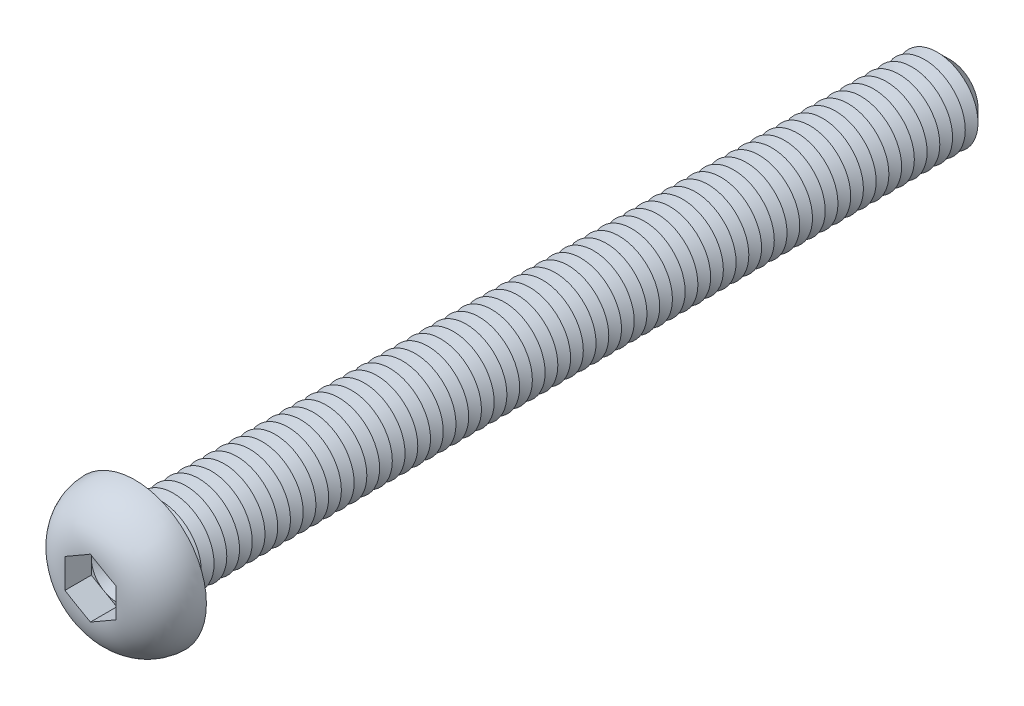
ISO-10303-21;
HEADER;
FILE_DESCRIPTION(('STEP AP214'),'2;1');
FILE_NAME('part.step','',(''),(''),'','','');
FILE_SCHEMA(('AUTOMOTIVE_DESIGN { 1 0 10303 214 1 1 1 1 }'));
ENDSEC;
DATA;
#1=APPLICATION_CONTEXT('core data for automotive mechanical design processes');
#2=APPLICATION_PROTOCOL_DEFINITION('international standard','automotive_design',2000,#1);
#3=PRODUCT_CONTEXT('',#1,'mechanical');
#4=PRODUCT('Part','Part','',(#3));
#5=PRODUCT_RELATED_PRODUCT_CATEGORY('part','',(#4));
#6=PRODUCT_DEFINITION_FORMATION('','',#4);
#7=PRODUCT_DEFINITION_CONTEXT('part definition',#1,'design');
#8=PRODUCT_DEFINITION('design','',#6,#7);
#9=PRODUCT_DEFINITION_SHAPE('','',#8);
#10=(LENGTH_UNIT() NAMED_UNIT(*) SI_UNIT(.MILLI.,.METRE.));
#11=(NAMED_UNIT(*) PLANE_ANGLE_UNIT() SI_UNIT($,.RADIAN.));
#12=(NAMED_UNIT(*) SI_UNIT($,.STERADIAN.) SOLID_ANGLE_UNIT());
#13=UNCERTAINTY_MEASURE_WITH_UNIT(LENGTH_MEASURE(1.E-05),#10,'distance_accuracy_value','');
#14=(GEOMETRIC_REPRESENTATION_CONTEXT(3) GLOBAL_UNCERTAINTY_ASSIGNED_CONTEXT((#13)) GLOBAL_UNIT_ASSIGNED_CONTEXT((#10,
#11,#12)) REPRESENTATION_CONTEXT('',''));
#15=CARTESIAN_POINT('',(0.,0.,0.));
#16=DIRECTION('',(0.,0.,1.));
#17=DIRECTION('',(1.,0.,0.));
#18=AXIS2_PLACEMENT_3D('',#15,#16,#17);
#19=CARTESIAN_POINT('',(0.,0.,1.8));
#20=DIRECTION('',(0.,0.,1.));
#21=DIRECTION('',(1.,0.,0.));
#22=AXIS2_PLACEMENT_3D('',#19,#20,#21);
#23=PLANE('',#22);
#24=CARTESIAN_POINT('',(0.,0.,1.8));
#25=DIRECTION('',(0.,0.,1.));
#26=DIRECTION('',(1.,0.,0.));
#27=AXIS2_PLACEMENT_3D('',#24,#25,#26);
#28=CIRCLE('',#27,2.5);
#29=CARTESIAN_POINT('',(2.5,0.,1.8));
#30=VERTEX_POINT('',#29);
#31=CARTESIAN_POINT('',(1.25,2.1650635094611,1.8));
#32=VERTEX_POINT('',#31);
#33=EDGE_CURVE('E153',#30,#32,#28,.T.);
#34=ORIENTED_EDGE('',*,*,#33,.F.);
#35=DIRECTION('',(0.,1.,0.));
#36=VECTOR('',#35,1.);
#37=CARTESIAN_POINT('',(2.5,-1.44337567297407,1.8));
#38=LINE('',#37,#36);
#39=CARTESIAN_POINT('',(2.5,1.44337567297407,1.8));
#40=VERTEX_POINT('',#39);
#41=EDGE_CURVE('E176',#30,#40,#38,.T.);
#42=ORIENTED_EDGE('',*,*,#41,.T.);
#43=DIRECTION('',(-0.866025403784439,0.5,0.));
#44=VECTOR('',#43,1.);
#45=CARTESIAN_POINT('',(2.5,1.44337567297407,1.8));
#46=LINE('',#45,#44);
#47=EDGE_CURVE('E172',#40,#32,#46,.T.);
#48=ORIENTED_EDGE('',*,*,#47,.T.);
#49=EDGE_LOOP('',(#34,#42,#48));
#50=FACE_BOUND('',#49,.T.);
#51=ADVANCED_FACE('F39',(#50),#23,.T.);
#52=CARTESIAN_POINT('',(0.,0.,1.8));
#53=DIRECTION('',(0.,0.,1.));
#54=DIRECTION('',(1.,0.,0.));
#55=AXIS2_PLACEMENT_3D('',#52,#53,#54);
#56=CIRCLE('',#55,2.5);
#57=CARTESIAN_POINT('',(-1.25,2.1650635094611,1.8));
#58=VERTEX_POINT('',#57);
#59=EDGE_CURVE('E11',#32,#58,#56,.T.);
#60=ORIENTED_EDGE('',*,*,#59,.F.);
#61=CARTESIAN_POINT('',(0.,2.88675134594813,1.8));
#62=VERTEX_POINT('',#61);
#63=EDGE_CURVE('E166',#32,#62,#46,.T.);
#64=ORIENTED_EDGE('',*,*,#63,.T.);
#65=DIRECTION('',(-0.866025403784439,-0.5,0.));
#66=VECTOR('',#65,1.);
#67=CARTESIAN_POINT('',(0.,2.88675134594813,1.8));
#68=LINE('',#67,#66);
#69=EDGE_CURVE('E167',#62,#58,#68,.T.);
#70=ORIENTED_EDGE('',*,*,#69,.T.);
#71=EDGE_LOOP('',(#60,#64,#70));
#72=FACE_BOUND('',#71,.T.);
#73=ADVANCED_FACE('F165',(#72),#23,.T.);
#74=CARTESIAN_POINT('',(-2.5,0.,1.8));
#75=VERTEX_POINT('',#74);
#76=EDGE_CURVE('E49',#58,#75,#56,.T.);
#77=ORIENTED_EDGE('',*,*,#76,.F.);
#78=CARTESIAN_POINT('',(-2.5,1.44337567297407,1.8));
#79=VERTEX_POINT('',#78);
#80=EDGE_CURVE('E179',#58,#79,#68,.T.);
#81=ORIENTED_EDGE('',*,*,#80,.T.);
#82=DIRECTION('',(0.,-1.,0.));
#83=VECTOR('',#82,1.);
#84=CARTESIAN_POINT('',(-2.5,1.44337567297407,1.8));
#85=LINE('',#84,#83);
#86=EDGE_CURVE('E190',#79,#75,#85,.T.);
#87=ORIENTED_EDGE('',*,*,#86,.T.);
#88=EDGE_LOOP('',(#77,#81,#87));
#89=FACE_BOUND('',#88,.T.);
#90=ADVANCED_FACE('F442',(#89),#23,.T.);
#91=CARTESIAN_POINT('',(-1.25,-2.1650635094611,1.8));
#92=VERTEX_POINT('',#91);
#93=EDGE_CURVE('E424',#75,#92,#56,.T.);
#94=ORIENTED_EDGE('',*,*,#93,.F.);
#95=CARTESIAN_POINT('',(-2.5,-1.44337567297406,1.8));
#96=VERTEX_POINT('',#95);
#97=EDGE_CURVE('E189',#75,#96,#85,.T.);
#98=ORIENTED_EDGE('',*,*,#97,.T.);
#99=DIRECTION('',(0.866025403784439,-0.5,0.));
#100=VECTOR('',#99,1.);
#101=CARTESIAN_POINT('',(-2.5,-1.44337567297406,1.8));
#102=LINE('',#101,#100);
#103=EDGE_CURVE('E195',#96,#92,#102,.T.);
#104=ORIENTED_EDGE('',*,*,#103,.T.);
#105=EDGE_LOOP('',(#94,#98,#104));
#106=FACE_BOUND('',#105,.T.);
#107=ADVANCED_FACE('F436',(#106),#23,.T.);
#108=CARTESIAN_POINT('',(1.25,-2.1650635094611,1.8));
#109=VERTEX_POINT('',#108);
#110=EDGE_CURVE('E56',#92,#109,#56,.T.);
#111=ORIENTED_EDGE('',*,*,#110,.F.);
#112=CARTESIAN_POINT('',(0.,-2.88675134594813,1.8));
#113=VERTEX_POINT('',#112);
#114=EDGE_CURVE('E194',#92,#113,#102,.T.);
#115=ORIENTED_EDGE('',*,*,#114,.T.);
#116=DIRECTION('',(0.866025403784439,0.5,0.));
#117=VECTOR('',#116,1.);
#118=CARTESIAN_POINT('',(0.,-2.88675134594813,1.8));
#119=LINE('',#118,#117);
#120=EDGE_CURVE('E200',#113,#109,#119,.T.);
#121=ORIENTED_EDGE('',*,*,#120,.T.);
#122=EDGE_LOOP('',(#111,#115,#121));
#123=FACE_BOUND('',#122,.T.);
#124=ADVANCED_FACE('F476',(#123),#23,.T.);
#125=CARTESIAN_POINT('',(0.,0.,-80.));
#126=DIRECTION('',(0.,0.,1.));
#127=DIRECTION('',(1.,0.,0.));
#128=AXIS2_PLACEMENT_3D('',#125,#126,#127);
#129=CYLINDRICAL_SURFACE('',#128,4.);
#130=CARTESIAN_POINT('',(0.,0.,-0.5));
#131=DIRECTION('',(0.,0.,1.));
#132=DIRECTION('',(1.,0.,0.));
#133=AXIS2_PLACEMENT_3D('',#130,#131,#132);
#134=CIRCLE('',#133,4.);
#135=CARTESIAN_POINT('',(4.,0.,-0.5));
#136=VERTEX_POINT('',#135);
#137=EDGE_CURVE('E411',#136,#136,#134,.F.);
#138=ORIENTED_EDGE('',*,*,#137,.T.);
#139=EDGE_LOOP('',(#138));
#140=FACE_BOUND('',#139,.T.);
#141=CARTESIAN_POINT('',(0.,0.,-1.25));
#142=DIRECTION('',(0.,0.,1.));
#143=DIRECTION('',(1.,0.,0.));
#144=AXIS2_PLACEMENT_3D('',#141,#142,#143);
#145=CIRCLE('',#144,4.00000000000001);
#146=CARTESIAN_POINT('',(4.00000000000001,0.,-1.25));
#147=VERTEX_POINT('',#146);
#148=EDGE_CURVE('E185',#147,#147,#145,.T.);
#149=ORIENTED_EDGE('',*,*,#148,.T.);
#150=EDGE_LOOP('',(#149));
#151=FACE_BOUND('',#150,.T.);
#152=ADVANCED_FACE('F471',(#140,#151),#129,.T.);
#153=CARTESIAN_POINT('',(0.,7.,0.));
#154=DIRECTION('',(0.,0.,1.));
#155=DIRECTION('',(1.,0.,0.));
#156=AXIS2_PLACEMENT_3D('',#153,#154,#155);
#157=PLANE('',#156);
#158=CARTESIAN_POINT('',(0.,0.,0.));
#159=DIRECTION('',(0.,0.,1.));
#160=DIRECTION('',(1.,0.,0.));
#161=AXIS2_PLACEMENT_3D('',#158,#159,#160);
#162=CIRCLE('',#161,4.5);
#163=CARTESIAN_POINT('',(4.5,0.,0.));
#164=VERTEX_POINT('',#163);
#165=EDGE_CURVE('E414',#164,#164,#162,.T.);
#166=ORIENTED_EDGE('',*,*,#165,.T.);
#167=EDGE_LOOP('',(#166));
#168=FACE_BOUND('',#167,.T.);
#169=CARTESIAN_POINT('',(0.,0.,0.));
#170=DIRECTION('',(0.,0.,1.));
#171=DIRECTION('',(1.,0.,0.));
#172=AXIS2_PLACEMENT_3D('',#169,#170,#171);
#173=CIRCLE('',#172,7.);
#174=CARTESIAN_POINT('',(7.,0.,0.));
#175=VERTEX_POINT('',#174);
#176=EDGE_CURVE('E211',#175,#175,#173,.T.);
#177=ORIENTED_EDGE('',*,*,#176,.F.);
#178=EDGE_LOOP('',(#177));
#179=FACE_BOUND('',#178,.T.);
#180=ADVANCED_FACE('F469',(#168,#179),#157,.F.);
#181=CARTESIAN_POINT('',(0.,0.,-0.1));
#182=DIRECTION('',(0.,0.,1.));
#183=DIRECTION('',(1.,0.,0.));
#184=AXIS2_PLACEMENT_3D('',#181,#182,#183);
#185=DEGENERATE_TOROIDAL_SURFACE('',#184,2.5011112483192,4.5,.T.);
#186=CARTESIAN_POINT('',(1.31456088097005,2.12778926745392,4.4));
#187=DIRECTION('',(-0.866025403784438,0.500000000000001,0.));
#188=VECTOR('',#187,1.);
#189=LINE('',#186,#188);
#190=CARTESIAN_POINT('',(1.31456088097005,2.12778926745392,4.4));
#191=VERTEX_POINT('',#190);
#192=CARTESIAN_POINT('',(1.18543911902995,2.20233775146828,4.4));
#193=VERTEX_POINT('',#192);
#194=EDGE_CURVE('E399',#191,#193,#189,.T.);
#195=ORIENTED_EDGE('',*,*,#194,.F.);
#196=CARTESIAN_POINT('',(-0.000200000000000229,2.88686681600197,4.38343536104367));
#197=CARTESIAN_POINT('',(0.103935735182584,2.82674402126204,4.38859262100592));
#198=CARTESIAN_POINT('',(0.208111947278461,2.76659785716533,4.39207570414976));
#199=CARTESIAN_POINT('',(0.416486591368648,2.64629270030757,4.39683754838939));
#200=CARTESIAN_POINT('',(0.520685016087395,2.58613371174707,4.39811670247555));
#201=CARTESIAN_POINT('',(0.729066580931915,2.46582455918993,4.3996156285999));
#202=CARTESIAN_POINT('',(0.833249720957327,2.40567439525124,4.39983556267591));
#203=CARTESIAN_POINT('',(1.04162190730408,2.2853706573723,4.4000276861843));
#204=CARTESIAN_POINT('',(1.14581095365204,2.2252170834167,4.39999986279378));
#205=CARTESIAN_POINT('',(1.35418904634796,2.10490993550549,4.39999986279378));
#206=CARTESIAN_POINT('',(1.45837809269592,2.04475636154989,4.4000276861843));
#207=CARTESIAN_POINT('',(1.66675027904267,1.92445262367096,4.39983556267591));
#208=CARTESIAN_POINT('',(1.77093341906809,1.86430245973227,4.3996156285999));
#209=CARTESIAN_POINT('',(1.97931498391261,1.74399330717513,4.39811670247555));
#210=CARTESIAN_POINT('',(2.08351340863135,1.68383431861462,4.39683754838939));
#211=CARTESIAN_POINT('',(2.29188805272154,1.56352916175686,4.39207570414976));
#212=CARTESIAN_POINT('',(2.39606426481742,1.50338299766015,4.38859262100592));
#213=CARTESIAN_POINT('',(2.5002,1.44326020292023,4.38343536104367));
#214=B_SPLINE_CURVE_WITH_KNOTS('',3,(#196,#197,#198,#199,#200,#201,#202,#203,#204,#205,#206,
#207,#208,#209,#210,#211,#212,#213),.UNSPECIFIED.,.F.,.F.,(4,2,2,2,2,2,2,2,4),(0.,
0.361022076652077,0.721979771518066,1.08288224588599,1.44380339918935,1.80472455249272,
2.16562702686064,2.52658472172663,2.88760679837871),.UNSPECIFIED.);
#215=CARTESIAN_POINT('',(2.5,1.44337567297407,4.38344529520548));
#216=VERTEX_POINT('',#215);
#217=EDGE_CURVE('E355',#191,#216,#214,.T.);
#218=ORIENTED_EDGE('',*,*,#217,.T.);
#219=CARTESIAN_POINT('',(2.5,0.,4.39999986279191));
#220=CARTESIAN_POINT('',(2.5,-0.104697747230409,4.39999811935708));
#221=CARTESIAN_POINT('',(2.5,-0.209395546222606,4.40001551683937));
#222=CARTESIAN_POINT('',(2.5,-0.418792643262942,4.39990807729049));
#223=CARTESIAN_POINT('',(2.5,-0.52349194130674,4.39978323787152));
#224=CARTESIAN_POINT('',(2.5,-0.732936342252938,4.39891238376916));
#225=CARTESIAN_POINT('',(2.5,-0.837681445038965,4.39816609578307));
#226=CARTESIAN_POINT('',(2.5,-1.04715282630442,4.39536239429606));
#227=CARTESIAN_POINT('',(2.5,-1.15187910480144,4.39330498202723));
#228=CARTESIAN_POINT('',(2.5,-1.46476484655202,4.38400647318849));
#229=CARTESIAN_POINT('',(2.5,-1.67286375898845,4.37365196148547));
#230=CARTESIAN_POINT('',(2.5,-2.08783281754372,4.33852954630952));
#231=CARTESIAN_POINT('',(2.5,-2.29470379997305,4.31377296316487));
#232=CARTESIAN_POINT('',(2.5,-2.64451002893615,4.25536510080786));
#233=CARTESIAN_POINT('',(2.5,-2.78823975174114,4.22651785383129));
#234=CARTESIAN_POINT('',(2.5,-3.073224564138,4.15827060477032));
#235=CARTESIAN_POINT('',(2.5,-3.21447933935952,4.11886927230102));
#236=CARTESIAN_POINT('',(2.5,-3.49353952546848,4.02870287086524));
#237=CARTESIAN_POINT('',(2.5,-3.6313402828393,3.97792330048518));
#238=CARTESIAN_POINT('',(2.5,-3.90204977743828,3.86463774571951));
#239=CARTESIAN_POINT('',(2.5,-4.0349587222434,3.8021322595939));
#240=CARTESIAN_POINT('',(2.5,-4.2956525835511,3.66474880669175));
#241=CARTESIAN_POINT('',(2.5,-4.42338586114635,3.58977252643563));
#242=CARTESIAN_POINT('',(2.5,-4.67118559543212,3.42803136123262));
#243=CARTESIAN_POINT('',(2.5,-4.79125159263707,3.3412657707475));
#244=CARTESIAN_POINT('',(2.5,-5.02233156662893,3.15645800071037));
#245=CARTESIAN_POINT('',(2.5,-5.13334771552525,3.05841854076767));
#246=CARTESIAN_POINT('',(2.5,-5.34506083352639,2.85177471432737));
#247=CARTESIAN_POINT('',(2.5,-5.44575933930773,2.74317192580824));
#248=CARTESIAN_POINT('',(2.5,-5.62335564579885,2.53102225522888));
#249=CARTESIAN_POINT('',(2.5,-5.70164721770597,2.42863868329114));
#250=CARTESIAN_POINT('',(2.5,-5.84882394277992,2.21725758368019));
#251=CARTESIAN_POINT('',(2.5,-5.91770588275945,2.10825781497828));
#252=CARTESIAN_POINT('',(2.5,-6.04532926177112,1.88460009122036));
#253=CARTESIAN_POINT('',(2.5,-6.1040794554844,1.76994713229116));
#254=CARTESIAN_POINT('',(2.5,-6.21098181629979,1.53574793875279));
#255=CARTESIAN_POINT('',(2.5,-6.25913021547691,1.41619998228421));
#256=CARTESIAN_POINT('',(2.5,-6.34173830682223,1.18065209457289));
#257=CARTESIAN_POINT('',(2.5,-6.37685491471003,1.06488207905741));
#258=CARTESIAN_POINT('',(2.5,-6.43703913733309,0.830714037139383));
#259=CARTESIAN_POINT('',(2.5,-6.46210319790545,0.712315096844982));
#260=CARTESIAN_POINT('',(2.5,-6.50194044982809,0.473848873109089));
#261=CARTESIAN_POINT('',(2.5,-6.51671856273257,0.353782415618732));
#262=CARTESIAN_POINT('',(2.5,-6.53588982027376,0.112808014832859));
#263=CARTESIAN_POINT('',(2.5,-6.54027911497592,-0.00810022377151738));
#264=CARTESIAN_POINT('',(2.5,-6.53779027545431,-0.365870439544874));
#265=CARTESIAN_POINT('',(2.5,-6.51607942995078,-0.602790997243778));
#266=CARTESIAN_POINT('',(2.5,-6.43310265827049,-1.06957107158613));
#267=CARTESIAN_POINT('',(2.5,-6.3718398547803,-1.29943114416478));
#268=CARTESIAN_POINT('',(2.5,-6.25195024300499,-1.63390601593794));
#269=CARTESIAN_POINT('',(2.5,-6.20730237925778,-1.74371189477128));
#270=CARTESIAN_POINT('',(2.5,-6.10902350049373,-1.95921136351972));
#271=CARTESIAN_POINT('',(2.5,-6.05539567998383,-2.06490639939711));
#272=CARTESIAN_POINT('',(2.5,-5.93955620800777,-2.27152527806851));
#273=CARTESIAN_POINT('',(2.5,-5.87734126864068,-2.37244727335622));
#274=CARTESIAN_POINT('',(2.5,-5.7448545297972,-2.56880727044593));
#275=CARTESIAN_POINT('',(2.5,-5.67458537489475,-2.6642470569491));
#276=CARTESIAN_POINT('',(2.5,-5.52523018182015,-2.85070592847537));
#277=CARTESIAN_POINT('',(2.5,-5.44601185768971,-2.94161901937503));
#278=CARTESIAN_POINT('',(2.5,-5.28044044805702,-3.11663859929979));
#279=CARTESIAN_POINT('',(2.5,-5.194089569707,-3.2007471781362));
#280=CARTESIAN_POINT('',(2.5,-5.01485870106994,-3.36178408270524));
#281=CARTESIAN_POINT('',(2.5,-4.92197538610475,-3.43870870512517));
#282=CARTESIAN_POINT('',(2.5,-4.73045535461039,-3.58495812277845));
#283=CARTESIAN_POINT('',(2.5,-4.6318202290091,-3.65428500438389));
#284=CARTESIAN_POINT('',(2.5,-4.4247626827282,-3.78818551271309));
#285=CARTESIAN_POINT('',(2.5,-4.31609824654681,-3.85238474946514));
#286=CARTESIAN_POINT('',(2.5,-4.0940582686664,-3.97208975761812));
#287=CARTESIAN_POINT('',(2.5,-3.98068153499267,-4.02759331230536));
#288=CARTESIAN_POINT('',(2.5,-3.75029026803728,-4.12981004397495));
#289=CARTESIAN_POINT('',(2.5,-3.63328275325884,-4.17653908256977));
#290=CARTESIAN_POINT('',(2.5,-3.39631992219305,-4.2614893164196));
#291=CARTESIAN_POINT('',(2.5,-3.27636651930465,-4.29971587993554));
#292=CARTESIAN_POINT('',(2.5,-3.00446622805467,-4.37644925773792));
#293=CARTESIAN_POINT('',(2.5,-2.85188931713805,-4.41272455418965));
#294=CARTESIAN_POINT('',(2.5,-2.54443794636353,-4.47385449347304));
#295=CARTESIAN_POINT('',(2.5,-2.3895624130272,-4.49870361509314));
#296=CARTESIAN_POINT('',(2.5,-2.07807451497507,-4.53870829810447));
#297=CARTESIAN_POINT('',(2.5,-1.92145805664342,-4.55383091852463));
#298=CARTESIAN_POINT('',(2.5,-1.60772330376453,-4.57647936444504));
#299=CARTESIAN_POINT('',(2.5,-1.45060502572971,-4.58400543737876));
#300=CARTESIAN_POINT('',(2.5,-1.13432460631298,-4.59416656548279));
#301=CARTESIAN_POINT('',(2.5,-0.975160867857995,-4.59674096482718));
#302=CARTESIAN_POINT('',(2.5,-0.656826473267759,-4.59957813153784));
#303=CARTESIAN_POINT('',(2.5,-0.497655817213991,-4.59984092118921));
#304=CARTESIAN_POINT('',(2.5,-0.179547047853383,-4.60005428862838));
#305=CARTESIAN_POINT('',(2.5,-0.02060893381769,-4.60000532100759));
#306=CARTESIAN_POINT('',(2.5,0.297265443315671,-4.59999304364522));
#307=CARTESIAN_POINT('',(2.5,0.456201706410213,-4.60002973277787));
#308=CARTESIAN_POINT('',(2.5,0.70967559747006,-4.59902611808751));
#309=CARTESIAN_POINT('',(2.5,0.804213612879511,-4.59841616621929));
#310=CARTESIAN_POINT('',(2.5,0.99327694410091,-4.59620676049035));
#311=CARTESIAN_POINT('',(2.5,1.08780225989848,-4.59460730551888));
#312=CARTESIAN_POINT('',(2.5,1.37137837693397,-4.58746770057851));
#313=CARTESIAN_POINT('',(2.5,1.56039301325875,-4.57958602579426));
#314=CARTESIAN_POINT('',(2.5,1.93609462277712,-4.55305686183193));
#315=CARTESIAN_POINT('',(2.5,2.12278756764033,-4.53450331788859));
#316=CARTESIAN_POINT('',(2.5,2.49421016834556,-4.48296248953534));
#317=CARTESIAN_POINT('',(2.5,2.67894050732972,-4.44998040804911));
#318=CARTESIAN_POINT('',(2.5,2.99962701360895,-4.37718406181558));
#319=CARTESIAN_POINT('',(2.5,3.13641465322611,-4.34103978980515));
#320=CARTESIAN_POINT('',(2.5,3.40682838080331,-4.25834226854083));
#321=CARTESIAN_POINT('',(2.5,3.54045461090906,-4.21178948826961));
#322=CARTESIAN_POINT('',(2.5,3.80387940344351,-4.1076796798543));
#323=CARTESIAN_POINT('',(2.5,3.93366385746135,-4.05008679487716));
#324=CARTESIAN_POINT('',(2.5,4.18776789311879,-3.92385886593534));
#325=CARTESIAN_POINT('',(2.5,4.31208736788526,-3.85522360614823));
#326=CARTESIAN_POINT('',(2.5,4.55475418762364,-3.70660227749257));
#327=CARTESIAN_POINT('',(2.5,4.67306276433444,-3.62655275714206));
#328=CARTESIAN_POINT('',(2.5,4.90171316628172,-3.45576294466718));
#329=CARTESIAN_POINT('',(2.5,5.01205476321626,-3.36502234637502));
#330=CARTESIAN_POINT('',(2.5,5.22347091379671,-3.17353376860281));
#331=CARTESIAN_POINT('',(2.5,5.32455555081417,-3.07279693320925));
#332=CARTESIAN_POINT('',(2.5,5.51647993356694,-2.86200023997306));
#333=CARTESIAN_POINT('',(2.5,5.6073208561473,-2.75194145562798));
#334=CARTESIAN_POINT('',(2.5,5.76832451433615,-2.53607083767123));
#335=CARTESIAN_POINT('',(2.5,5.83966300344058,-2.4311337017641));
#336=CARTESIAN_POINT('',(2.5,5.97282702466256,-2.2153291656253));
#337=CARTESIAN_POINT('',(2.5,6.03464926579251,-2.10445973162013));
#338=CARTESIAN_POINT('',(2.5,6.14815657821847,-1.87771731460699));
#339=CARTESIAN_POINT('',(2.5,6.19984675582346,-1.76184688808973));
#340=CARTESIAN_POINT('',(2.5,6.29267395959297,-1.52590109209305));
#341=CARTESIAN_POINT('',(2.5,6.33380720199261,-1.40582423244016));
#342=CARTESIAN_POINT('',(2.5,6.40328888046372,-1.16869740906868));
#343=CARTESIAN_POINT('',(2.5,6.43218419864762,-1.05180738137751));
#344=CARTESIAN_POINT('',(2.5,6.47988151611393,-0.815941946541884));
#345=CARTESIAN_POINT('',(2.5,6.49867991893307,-0.696965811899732));
#346=CARTESIAN_POINT('',(2.5,6.52599950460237,-0.457898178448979));
#347=CARTESIAN_POINT('',(2.5,6.53452634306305,-0.337807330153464));
#348=CARTESIAN_POINT('',(2.5,6.54126106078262,-0.0973214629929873));
#349=CARTESIAN_POINT('',(2.5,6.5394651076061,0.023073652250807));
#350=CARTESIAN_POINT('',(2.5,6.51879545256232,0.379398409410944));
#351=CARTESIAN_POINT('',(2.5,6.48510560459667,0.614630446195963));
#352=CARTESIAN_POINT('',(2.5,6.37872360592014,1.07608887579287));
#353=CARTESIAN_POINT('',(2.5,6.30603128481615,1.3023152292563));
#354=CARTESIAN_POINT('',(2.5,6.16957161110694,1.63028303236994));
#355=CARTESIAN_POINT('',(2.5,6.11941470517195,1.7378698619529));
#356=CARTESIAN_POINT('',(2.5,6.01034124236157,1.94849153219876));
#357=CARTESIAN_POINT('',(2.5,5.9514277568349,2.05152795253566));
#358=CARTESIAN_POINT('',(2.5,5.82528890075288,2.25240256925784));
#359=CARTESIAN_POINT('',(2.5,5.75806159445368,2.35023954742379));
#360=CARTESIAN_POINT('',(2.5,5.61585543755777,2.54005689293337));
#361=CARTESIAN_POINT('',(2.5,5.54087908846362,2.63203913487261));
#362=CARTESIAN_POINT('',(2.5,5.38212190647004,2.81146438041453));
#363=CARTESIAN_POINT('',(2.5,5.29819182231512,2.89877528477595));
#364=CARTESIAN_POINT('',(2.5,5.12353712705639,3.06625194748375));
#365=CARTESIAN_POINT('',(2.5,5.03281455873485,3.14641983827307));
#366=CARTESIAN_POINT('',(2.5,4.84518171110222,3.29930665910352));
#367=CARTESIAN_POINT('',(2.5,4.74826657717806,3.37201962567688));
#368=CARTESIAN_POINT('',(2.5,4.54907485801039,3.50961479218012));
#369=CARTESIAN_POINT('',(2.5,4.44679969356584,3.57449905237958));
#370=CARTESIAN_POINT('',(2.5,4.23202545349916,3.69953578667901));
#371=CARTESIAN_POINT('',(2.5,4.11927203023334,3.75925114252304));
#372=CARTESIAN_POINT('',(2.5,3.88947986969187,3.86977617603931));
#373=CARTESIAN_POINT('',(2.5,3.77244067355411,3.92058489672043));
#374=CARTESIAN_POINT('',(2.5,3.5351804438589,4.0133148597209));
#375=CARTESIAN_POINT('',(2.5,3.41496637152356,4.0552539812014));
#376=CARTESIAN_POINT('',(2.5,3.17195278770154,4.13067246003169));
#377=CARTESIAN_POINT('',(2.5,3.04915378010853,4.16415344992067));
#378=CARTESIAN_POINT('',(2.5,2.80683027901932,4.22194717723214));
#379=CARTESIAN_POINT('',(2.5,2.68738216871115,4.2465834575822));
#380=CARTESIAN_POINT('',(2.5,2.44729214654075,4.28920746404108));
#381=CARTESIAN_POINT('',(2.5,2.32664997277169,4.30719369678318));
#382=CARTESIAN_POINT('',(2.5,2.08450864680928,4.33736171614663));
#383=CARTESIAN_POINT('',(2.5,1.9630086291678,4.3495363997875));
#384=CARTESIAN_POINT('',(2.5,1.71961501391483,4.36908103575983));
#385=CARTESIAN_POINT('',(2.5,1.59772134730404,4.37645009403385));
#386=CARTESIAN_POINT('',(2.5,1.35283283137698,4.38761579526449));
#387=CARTESIAN_POINT('',(2.5,1.22983679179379,4.39138420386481));
#388=CARTESIAN_POINT('',(2.5,0.983808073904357,4.3965493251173));
#389=CARTESIAN_POINT('',(2.5,0.860775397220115,4.3979461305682));
#390=CARTESIAN_POINT('',(2.5,0.614783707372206,4.39958107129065));
#391=CARTESIAN_POINT('',(2.5,0.491824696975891,4.3998199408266));
#392=CARTESIAN_POINT('',(2.5,0.245910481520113,4.40003035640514));
#393=CARTESIAN_POINT('',(2.5,0.122955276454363,4.4000019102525));
#394=CARTESIAN_POINT('',(2.5,0.,4.39999986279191));
#395=B_SPLINE_CURVE_WITH_KNOTS('',3,(#219,#220,#221,#222,#223,#224,#225,#226,#227,#228,#229,
#230,#231,#232,#233,#234,#235,#236,#237,#238,#239,#240,#241,#242,#243,#244,#245,#246,#247,#248,
#249,#250,#251,#252,#253,#254,#255,#256,#257,#258,#259,#260,#261,#262,#263,#264,#265,#266,#267,
#268,#269,#270,#271,#272,#273,#274,#275,#276,#277,#278,#279,#280,#281,#282,#283,#284,#285,#286,
#287,#288,#289,#290,#291,#292,#293,#294,#295,#296,#297,#298,#299,#300,#301,#302,#303,#304,#305,
#306,#307,#308,#309,#310,#311,#312,#313,#314,#315,#316,#317,#318,#319,#320,#321,#322,#323,#324,
#325,#326,#327,#328,#329,#330,#331,#332,#333,#334,#335,#336,#337,#338,#339,#340,#341,#342,#343,
#344,#345,#346,#347,#348,#349,#350,#351,#352,#353,#354,#355,#356,#357,#358,#359,#360,#361,#362,
#363,#364,#365,#366,#367,#368,#369,#370,#371,#372,#373,#374,#375,#376,#377,#378,#379,#380,#381,
#382,#383,#384,#385,#386,#387,#388,#389,#390,#391,#392,#393,#394),.UNSPECIFIED.,.T.,.F.,(4,2,2,
2,2,2,2,2,2,2,2,2,2,2,2,2,2,2,2,2,2,2,2,2,2,2,2,2,2,2,2,2,2,2,2,2,2,2,2,2,2,2,2,2,2,2,2,2,2,2,2,
2,2,2,2,2,2,2,2,2,2,2,2,2,2,2,2,2,2,2,2,2,2,2,2,2,2,2,2,2,2,2,2,2,2,2,2,4),(0.,
0.314093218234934,0.62819170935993,0.942428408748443,1.25666481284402,1.88144147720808,
2.50572771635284,2.94516878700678,3.38466527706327,3.82472511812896,4.26476626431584,
4.70845695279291,5.15217420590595,5.59578464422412,6.03932891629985,6.42549664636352,
6.81179591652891,7.19775970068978,7.58386043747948,7.94635637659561,8.30898036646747,
8.67143073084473,9.03401539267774,9.74414367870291,10.4542159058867,10.8094792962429,
11.1646165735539,11.5198902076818,11.8750475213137,12.2363927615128,12.597626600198,
12.9590456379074,13.3203651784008,13.698597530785,14.0769261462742,14.4545641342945,
14.8319630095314,15.3019396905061,15.7721432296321,16.2439309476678,16.715703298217,
17.1932187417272,17.6707295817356,18.1475442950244,18.6243527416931,18.9079682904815,
19.1915841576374,19.7589248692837,20.3213460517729,20.8835645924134,21.3076400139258,
21.731696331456,22.1571540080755,22.5826200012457,23.0105507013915,23.4384936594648,
23.8659647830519,24.2933867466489,24.6735755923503,25.0538956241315,25.4340234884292,
25.8142874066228,26.1750761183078,26.5359932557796,26.8967115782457,27.2575638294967,
27.9668653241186,28.6761699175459,29.0319382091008,29.3875820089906,29.7433087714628,
30.0989210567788,30.4618400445,30.8246503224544,31.1877485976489,31.5507511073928,
31.9331198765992,32.3155297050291,32.6971611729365,33.0787189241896,33.4443988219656,
33.8101607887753,34.1763686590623,34.54264464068,34.9117697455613,35.2808804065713,
35.6497569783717,36.0186227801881),.UNSPECIFIED.);
#396=CARTESIAN_POINT('',(2.5,0.0745484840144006,4.4));
#397=VERTEX_POINT('',#396);
#398=EDGE_CURVE('E345',#216,#397,#395,.T.);
#399=ORIENTED_EDGE('',*,*,#398,.T.);
#400=CARTESIAN_POINT('',(2.5,-0.0745484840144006,4.4));
#401=DIRECTION('',(0.,1.,0.));
#402=VECTOR('',#401,1.);
#403=LINE('',#400,#402);
#404=CARTESIAN_POINT('',(2.5,-0.0745484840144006,4.4));
#405=VERTEX_POINT('',#404);
#406=EDGE_CURVE('E174',#405,#397,#403,.T.);
#407=ORIENTED_EDGE('',*,*,#406,.F.);
#408=CARTESIAN_POINT('',(2.5,-1.44337567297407,4.38344529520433));
#409=VERTEX_POINT('',#408);
#410=EDGE_CURVE('E356',#405,#409,#395,.T.);
#411=ORIENTED_EDGE('',*,*,#410,.T.);
#412=CARTESIAN_POINT('',(2.5002,-1.44326020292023,4.38343536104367));
#413=CARTESIAN_POINT('',(2.39606426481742,-1.50338299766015,4.38859262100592));
#414=CARTESIAN_POINT('',(2.29188805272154,-1.56352916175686,4.39207570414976));
#415=CARTESIAN_POINT('',(2.08351340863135,-1.68383431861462,4.39683754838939));
#416=CARTESIAN_POINT('',(1.9793149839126,-1.74399330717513,4.39811670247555));
#417=CARTESIAN_POINT('',(1.77093341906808,-1.86430245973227,4.3996156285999));
#418=CARTESIAN_POINT('',(1.66675027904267,-1.92445262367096,4.39983556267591));
#419=CARTESIAN_POINT('',(1.45837809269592,-2.04475636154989,4.4000276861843));
#420=CARTESIAN_POINT('',(1.35418904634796,-2.10490993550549,4.39999986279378));
#421=CARTESIAN_POINT('',(1.14581095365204,-2.2252170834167,4.39999986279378));
#422=CARTESIAN_POINT('',(1.04162190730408,-2.2853706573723,4.4000276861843));
#423=CARTESIAN_POINT('',(0.833249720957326,-2.40567439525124,4.39983556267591));
#424=CARTESIAN_POINT('',(0.729066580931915,-2.46582455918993,4.3996156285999));
#425=CARTESIAN_POINT('',(0.520685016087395,-2.58613371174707,4.39811670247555));
#426=CARTESIAN_POINT('',(0.416486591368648,-2.64629270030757,4.39683754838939));
#427=CARTESIAN_POINT('',(0.208111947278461,-2.76659785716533,4.39207570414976));
#428=CARTESIAN_POINT('',(0.103935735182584,-2.82674402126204,4.38859262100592));
#429=CARTESIAN_POINT('',(-0.000200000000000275,-2.88686681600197,4.38343536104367));
#430=B_SPLINE_CURVE_WITH_KNOTS('',3,(#412,#413,#414,#415,#416,#417,#418,#419,#420,#421,#422,
#423,#424,#425,#426,#427,#428,#429),.UNSPECIFIED.,.F.,.F.,(4,2,2,2,2,2,2,2,4),(0.,
0.361022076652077,0.721979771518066,1.08288224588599,1.44380339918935,1.80472455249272,
2.16562702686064,2.52658472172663,2.88760679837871),.UNSPECIFIED.);
#431=CARTESIAN_POINT('',(1.31456088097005,-2.12778926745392,4.4));
#432=VERTEX_POINT('',#431);
#433=EDGE_CURVE('E332',#409,#432,#430,.T.);
#434=ORIENTED_EDGE('',*,*,#433,.T.);
#435=CARTESIAN_POINT('',(1.18543911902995,-2.20233775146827,4.4));
#436=DIRECTION('',(0.866025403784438,0.500000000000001,0.));
#437=VECTOR('',#436,1.);
#438=LINE('',#435,#437);
#439=CARTESIAN_POINT('',(1.18543911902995,-2.20233775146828,4.4));
#440=VERTEX_POINT('',#439);
#441=EDGE_CURVE('E341',#440,#432,#438,.T.);
#442=ORIENTED_EDGE('',*,*,#441,.F.);
#443=CARTESIAN_POINT('',(0.,-2.88675134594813,4.38344529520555));
#444=VERTEX_POINT('',#443);
#445=EDGE_CURVE('E295',#440,#444,#430,.T.);
#446=ORIENTED_EDGE('',*,*,#445,.T.);
#447=CARTESIAN_POINT('',(0.00019999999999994,-2.88686681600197,4.38343536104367));
#448=CARTESIAN_POINT('',(-0.103935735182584,-2.82674402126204,4.38859262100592));
#449=CARTESIAN_POINT('',(-0.208111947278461,-2.76659785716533,4.39207570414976));
#450=CARTESIAN_POINT('',(-0.416486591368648,-2.64629270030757,4.39683754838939));
#451=CARTESIAN_POINT('',(-0.520685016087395,-2.58613371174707,4.39811670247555));
#452=CARTESIAN_POINT('',(-0.729066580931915,-2.46582455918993,4.3996156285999));
#453=CARTESIAN_POINT('',(-0.833249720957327,-2.40567439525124,4.39983556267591));
#454=CARTESIAN_POINT('',(-1.04162190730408,-2.2853706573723,4.4000276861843));
#455=CARTESIAN_POINT('',(-1.14581095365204,-2.2252170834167,4.39999986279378));
#456=CARTESIAN_POINT('',(-1.35418904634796,-2.10490993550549,4.39999986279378));
#457=CARTESIAN_POINT('',(-1.45837809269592,-2.04475636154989,4.4000276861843));
#458=CARTESIAN_POINT('',(-1.66675027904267,-1.92445262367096,4.39983556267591));
#459=CARTESIAN_POINT('',(-1.77093341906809,-1.86430245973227,4.3996156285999));
#460=CARTESIAN_POINT('',(-1.97931498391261,-1.74399330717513,4.39811670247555));
#461=CARTESIAN_POINT('',(-2.08351340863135,-1.68383431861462,4.39683754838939));
#462=CARTESIAN_POINT('',(-2.29188805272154,-1.56352916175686,4.39207570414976));
#463=CARTESIAN_POINT('',(-2.39606426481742,-1.50338299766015,4.38859262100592));
#464=CARTESIAN_POINT('',(-2.5002,-1.44326020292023,4.38343536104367));
#465=B_SPLINE_CURVE_WITH_KNOTS('',3,(#447,#448,#449,#450,#451,#452,#453,#454,#455,#456,#457,
#458,#459,#460,#461,#462,#463,#464),.UNSPECIFIED.,.F.,.F.,(4,2,2,2,2,2,2,2,4),(0.,
0.361022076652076,0.721979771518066,1.08288224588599,1.44380339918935,1.80472455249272,
2.16562702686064,2.52658472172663,2.88760679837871),.UNSPECIFIED.);
#466=CARTESIAN_POINT('',(-1.18543911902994,-2.20233775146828,4.4));
#467=VERTEX_POINT('',#466);
#468=EDGE_CURVE('E285',#444,#467,#465,.T.);
#469=ORIENTED_EDGE('',*,*,#468,.T.);
#470=CARTESIAN_POINT('',(-1.31456088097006,-2.12778926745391,4.4));
#471=DIRECTION('',(0.86602540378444,-0.499999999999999,0.));
#472=VECTOR('',#471,1.);
#473=LINE('',#470,#472);
#474=CARTESIAN_POINT('',(-1.31456088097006,-2.12778926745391,4.4));
#475=VERTEX_POINT('',#474);
#476=EDGE_CURVE('E628',#475,#467,#473,.T.);
#477=ORIENTED_EDGE('',*,*,#476,.F.);
#478=CARTESIAN_POINT('',(-2.5,-1.44337567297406,4.38344529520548));
#479=VERTEX_POINT('',#478);
#480=EDGE_CURVE('E296',#475,#479,#465,.T.);
#481=ORIENTED_EDGE('',*,*,#480,.T.);
#482=CARTESIAN_POINT('',(-2.5,0.,4.39999986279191));
#483=CARTESIAN_POINT('',(-2.5,0.104697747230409,4.39999811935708));
#484=CARTESIAN_POINT('',(-2.5,0.209395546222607,4.40001551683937));
#485=CARTESIAN_POINT('',(-2.5,0.418792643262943,4.39990807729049));
#486=CARTESIAN_POINT('',(-2.5,0.523491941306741,4.39978323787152));
#487=CARTESIAN_POINT('',(-2.5,0.732936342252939,4.39891238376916));
#488=CARTESIAN_POINT('',(-2.5,0.837681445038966,4.39816609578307));
#489=CARTESIAN_POINT('',(-2.5,1.04715282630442,4.39536239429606));
#490=CARTESIAN_POINT('',(-2.5,1.15187910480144,4.39330498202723));
#491=CARTESIAN_POINT('',(-2.5,1.46476484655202,4.38400647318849));
#492=CARTESIAN_POINT('',(-2.5,1.67286375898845,4.37365196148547));
#493=CARTESIAN_POINT('',(-2.5,2.08783281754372,4.33852954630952));
#494=CARTESIAN_POINT('',(-2.5,2.29470379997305,4.31377296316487));
#495=CARTESIAN_POINT('',(-2.5,2.64451002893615,4.25536510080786));
#496=CARTESIAN_POINT('',(-2.5,2.78823975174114,4.22651785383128));
#497=CARTESIAN_POINT('',(-2.5,3.073224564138,4.15827060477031));
#498=CARTESIAN_POINT('',(-2.5,3.21447933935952,4.11886927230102));
#499=CARTESIAN_POINT('',(-2.5,3.49353952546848,4.02870287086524));
#500=CARTESIAN_POINT('',(-2.5,3.6313402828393,3.97792330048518));
#501=CARTESIAN_POINT('',(-2.5,3.90204977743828,3.8646377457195));
#502=CARTESIAN_POINT('',(-2.5,4.0349587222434,3.8021322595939));
#503=CARTESIAN_POINT('',(-2.5,4.2956525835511,3.66474880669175));
#504=CARTESIAN_POINT('',(-2.5,4.42338586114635,3.58977252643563));
#505=CARTESIAN_POINT('',(-2.5,4.67118559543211,3.42803136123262));
#506=CARTESIAN_POINT('',(-2.5,4.79125159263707,3.3412657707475));
#507=CARTESIAN_POINT('',(-2.5,5.02233156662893,3.15645800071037));
#508=CARTESIAN_POINT('',(-2.5,5.13334771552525,3.05841854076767));
#509=CARTESIAN_POINT('',(-2.5,5.34506083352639,2.85177471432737));
#510=CARTESIAN_POINT('',(-2.5,5.44575933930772,2.74317192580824));
#511=CARTESIAN_POINT('',(-2.5,5.62335564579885,2.53102225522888));
#512=CARTESIAN_POINT('',(-2.5,5.70164721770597,2.42863868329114));
#513=CARTESIAN_POINT('',(-2.5,5.84882394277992,2.21725758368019));
#514=CARTESIAN_POINT('',(-2.5,5.91770588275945,2.10825781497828));
#515=CARTESIAN_POINT('',(-2.5,6.04532926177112,1.88460009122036));
#516=CARTESIAN_POINT('',(-2.5,6.1040794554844,1.76994713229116));
#517=CARTESIAN_POINT('',(-2.5,6.21098181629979,1.53574793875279));
#518=CARTESIAN_POINT('',(-2.5,6.25913021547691,1.41619998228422));
#519=CARTESIAN_POINT('',(-2.5,6.34173830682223,1.18065209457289));
#520=CARTESIAN_POINT('',(-2.5,6.37685491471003,1.06488207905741));
#521=CARTESIAN_POINT('',(-2.5,6.43703913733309,0.830714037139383));
#522=CARTESIAN_POINT('',(-2.5,6.46210319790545,0.712315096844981));
#523=CARTESIAN_POINT('',(-2.5,6.50194044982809,0.473848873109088));
#524=CARTESIAN_POINT('',(-2.5,6.51671856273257,0.35378241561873));
#525=CARTESIAN_POINT('',(-2.5,6.53588982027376,0.112808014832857));
#526=CARTESIAN_POINT('',(-2.5,6.54027911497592,-0.00810022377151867));
#527=CARTESIAN_POINT('',(-2.5,6.53779027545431,-0.365870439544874));
#528=CARTESIAN_POINT('',(-2.5,6.51607942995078,-0.602790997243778));
#529=CARTESIAN_POINT('',(-2.5,6.43310265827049,-1.06957107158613));
#530=CARTESIAN_POINT('',(-2.5,6.3718398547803,-1.29943114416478));
#531=CARTESIAN_POINT('',(-2.5,6.25195024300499,-1.63390601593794));
#532=CARTESIAN_POINT('',(-2.5,6.20730237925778,-1.74371189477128));
#533=CARTESIAN_POINT('',(-2.5,6.10902350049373,-1.95921136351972));
#534=CARTESIAN_POINT('',(-2.5,6.05539567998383,-2.06490639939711));
#535=CARTESIAN_POINT('',(-2.5,5.93955620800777,-2.27152527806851));
#536=CARTESIAN_POINT('',(-2.5,5.87734126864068,-2.37244727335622));
#537=CARTESIAN_POINT('',(-2.5,5.7448545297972,-2.56880727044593));
#538=CARTESIAN_POINT('',(-2.5,5.67458537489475,-2.6642470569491));
#539=CARTESIAN_POINT('',(-2.5,5.52523018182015,-2.85070592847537));
#540=CARTESIAN_POINT('',(-2.5,5.44601185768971,-2.94161901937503));
#541=CARTESIAN_POINT('',(-2.5,5.28044044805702,-3.11663859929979));
#542=CARTESIAN_POINT('',(-2.5,5.194089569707,-3.2007471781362));
#543=CARTESIAN_POINT('',(-2.5,5.01485870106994,-3.36178408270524));
#544=CARTESIAN_POINT('',(-2.5,4.92197538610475,-3.43870870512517));
#545=CARTESIAN_POINT('',(-2.5,4.73045535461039,-3.58495812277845));
#546=CARTESIAN_POINT('',(-2.5,4.6318202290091,-3.65428500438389));
#547=CARTESIAN_POINT('',(-2.5,4.4247626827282,-3.78818551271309));
#548=CARTESIAN_POINT('',(-2.5,4.31609824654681,-3.85238474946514));
#549=CARTESIAN_POINT('',(-2.5,4.0940582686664,-3.97208975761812));
#550=CARTESIAN_POINT('',(-2.5,3.98068153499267,-4.02759331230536));
#551=CARTESIAN_POINT('',(-2.5,3.75029026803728,-4.12981004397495));
#552=CARTESIAN_POINT('',(-2.5,3.63328275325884,-4.17653908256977));
#553=CARTESIAN_POINT('',(-2.5,3.39631992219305,-4.2614893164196));
#554=CARTESIAN_POINT('',(-2.5,3.27636651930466,-4.29971587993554));
#555=CARTESIAN_POINT('',(-2.5,3.00446622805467,-4.37644925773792));
#556=CARTESIAN_POINT('',(-2.5,2.85188931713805,-4.41272455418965));
#557=CARTESIAN_POINT('',(-2.5,2.54443794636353,-4.47385449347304));
#558=CARTESIAN_POINT('',(-2.5,2.3895624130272,-4.49870361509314));
#559=CARTESIAN_POINT('',(-2.5,2.07807451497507,-4.53870829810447));
#560=CARTESIAN_POINT('',(-2.5,1.92145805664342,-4.55383091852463));
#561=CARTESIAN_POINT('',(-2.5,1.60772330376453,-4.57647936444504));
#562=CARTESIAN_POINT('',(-2.5,1.45060502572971,-4.58400543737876));
#563=CARTESIAN_POINT('',(-2.5,1.13432460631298,-4.59416656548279));
#564=CARTESIAN_POINT('',(-2.5,0.975160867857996,-4.59674096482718));
#565=CARTESIAN_POINT('',(-2.5,0.65682647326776,-4.59957813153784));
#566=CARTESIAN_POINT('',(-2.5,0.497655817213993,-4.59984092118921));
#567=CARTESIAN_POINT('',(-2.5,0.179547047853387,-4.60005428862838));
#568=CARTESIAN_POINT('',(-2.5,0.0206089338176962,-4.60000532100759));
#569=CARTESIAN_POINT('',(-2.5,-0.297265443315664,-4.59999304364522));
#570=CARTESIAN_POINT('',(-2.5,-0.456201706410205,-4.60002973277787));
#571=CARTESIAN_POINT('',(-2.5,-0.709675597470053,-4.59902611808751));
#572=CARTESIAN_POINT('',(-2.5,-0.804213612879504,-4.59841616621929));
#573=CARTESIAN_POINT('',(-2.5,-0.993276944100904,-4.59620676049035));
#574=CARTESIAN_POINT('',(-2.5,-1.08780225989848,-4.59460730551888));
#575=CARTESIAN_POINT('',(-2.5,-1.37137837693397,-4.58746770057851));
#576=CARTESIAN_POINT('',(-2.5,-1.56039301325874,-4.57958602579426));
#577=CARTESIAN_POINT('',(-2.5,-1.93609462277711,-4.55305686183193));
#578=CARTESIAN_POINT('',(-2.5,-2.12278756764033,-4.53450331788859));
#579=CARTESIAN_POINT('',(-2.5,-2.49421016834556,-4.48296248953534));
#580=CARTESIAN_POINT('',(-2.5,-2.67894050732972,-4.44998040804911));
#581=CARTESIAN_POINT('',(-2.5,-2.99962701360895,-4.37718406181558));
#582=CARTESIAN_POINT('',(-2.5,-3.13641465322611,-4.34103978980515));
#583=CARTESIAN_POINT('',(-2.5,-3.40682838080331,-4.25834226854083));
#584=CARTESIAN_POINT('',(-2.5,-3.54045461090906,-4.21178948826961));
#585=CARTESIAN_POINT('',(-2.5,-3.8038794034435,-4.1076796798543));
#586=CARTESIAN_POINT('',(-2.5,-3.93366385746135,-4.05008679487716));
#587=CARTESIAN_POINT('',(-2.5,-4.18776789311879,-3.92385886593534));
#588=CARTESIAN_POINT('',(-2.5,-4.31208736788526,-3.85522360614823));
#589=CARTESIAN_POINT('',(-2.5,-4.55475418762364,-3.70660227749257));
#590=CARTESIAN_POINT('',(-2.5,-4.67306276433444,-3.62655275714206));
#591=CARTESIAN_POINT('',(-2.5,-4.90171316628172,-3.45576294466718));
#592=CARTESIAN_POINT('',(-2.5,-5.01205476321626,-3.36502234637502));
#593=CARTESIAN_POINT('',(-2.5,-5.2234709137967,-3.17353376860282));
#594=CARTESIAN_POINT('',(-2.5,-5.32455555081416,-3.07279693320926));
#595=CARTESIAN_POINT('',(-2.5,-5.51647993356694,-2.86200023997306));
#596=CARTESIAN_POINT('',(-2.5,-5.6073208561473,-2.75194145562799));
#597=CARTESIAN_POINT('',(-2.5,-5.76832451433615,-2.53607083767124));
#598=CARTESIAN_POINT('',(-2.5,-5.83966300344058,-2.4311337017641));
#599=CARTESIAN_POINT('',(-2.5,-5.97282702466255,-2.2153291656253));
#600=CARTESIAN_POINT('',(-2.5,-6.03464926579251,-2.10445973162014));
#601=CARTESIAN_POINT('',(-2.5,-6.14815657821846,-1.877717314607));
#602=CARTESIAN_POINT('',(-2.5,-6.19984675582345,-1.76184688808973));
#603=CARTESIAN_POINT('',(-2.5,-6.29267395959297,-1.52590109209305));
#604=CARTESIAN_POINT('',(-2.5,-6.33380720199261,-1.40582423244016));
#605=CARTESIAN_POINT('',(-2.5,-6.40328888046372,-1.16869740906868));
#606=CARTESIAN_POINT('',(-2.5,-6.43218419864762,-1.05180738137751));
#607=CARTESIAN_POINT('',(-2.5,-6.47988151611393,-0.815941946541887));
#608=CARTESIAN_POINT('',(-2.5,-6.49867991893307,-0.696965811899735));
#609=CARTESIAN_POINT('',(-2.5,-6.52599950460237,-0.457898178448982));
#610=CARTESIAN_POINT('',(-2.5,-6.53452634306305,-0.337807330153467));
#611=CARTESIAN_POINT('',(-2.5,-6.54126106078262,-0.09732146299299));
#612=CARTESIAN_POINT('',(-2.5,-6.5394651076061,0.0230736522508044));
#613=CARTESIAN_POINT('',(-2.5,-6.51879545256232,0.379398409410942));
#614=CARTESIAN_POINT('',(-2.5,-6.48510560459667,0.614630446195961));
#615=CARTESIAN_POINT('',(-2.5,-6.37872360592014,1.07608887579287));
#616=CARTESIAN_POINT('',(-2.5,-6.30603128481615,1.3023152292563));
#617=CARTESIAN_POINT('',(-2.5,-6.16957161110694,1.63028303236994));
#618=CARTESIAN_POINT('',(-2.5,-6.11941470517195,1.7378698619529));
#619=CARTESIAN_POINT('',(-2.5,-6.01034124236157,1.94849153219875));
#620=CARTESIAN_POINT('',(-2.5,-5.9514277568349,2.05152795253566));
#621=CARTESIAN_POINT('',(-2.5,-5.82528890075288,2.25240256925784));
#622=CARTESIAN_POINT('',(-2.5,-5.75806159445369,2.35023954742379));
#623=CARTESIAN_POINT('',(-2.5,-5.61585543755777,2.54005689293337));
#624=CARTESIAN_POINT('',(-2.5,-5.54087908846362,2.63203913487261));
#625=CARTESIAN_POINT('',(-2.5,-5.38212190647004,2.81146438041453));
#626=CARTESIAN_POINT('',(-2.5,-5.29819182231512,2.89877528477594));
#627=CARTESIAN_POINT('',(-2.5,-5.1235371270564,3.06625194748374));
#628=CARTESIAN_POINT('',(-2.5,-5.03281455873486,3.14641983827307));
#629=CARTESIAN_POINT('',(-2.5,-4.84518171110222,3.29930665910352));
#630=CARTESIAN_POINT('',(-2.5,-4.74826657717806,3.37201962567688));
#631=CARTESIAN_POINT('',(-2.5,-4.54907485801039,3.50961479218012));
#632=CARTESIAN_POINT('',(-2.5,-4.44679969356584,3.57449905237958));
#633=CARTESIAN_POINT('',(-2.5,-4.23202545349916,3.69953578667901));
#634=CARTESIAN_POINT('',(-2.5,-4.11927203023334,3.75925114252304));
#635=CARTESIAN_POINT('',(-2.5,-3.88947986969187,3.86977617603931));
#636=CARTESIAN_POINT('',(-2.5,-3.77244067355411,3.92058489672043));
#637=CARTESIAN_POINT('',(-2.5,-3.5351804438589,4.0133148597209));
#638=CARTESIAN_POINT('',(-2.5,-3.41496637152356,4.0552539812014));
#639=CARTESIAN_POINT('',(-2.5,-3.17195278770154,4.13067246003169));
#640=CARTESIAN_POINT('',(-2.5,-3.04915378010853,4.16415344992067));
#641=CARTESIAN_POINT('',(-2.5,-2.80683027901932,4.22194717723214));
#642=CARTESIAN_POINT('',(-2.5,-2.68738216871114,4.2465834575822));
#643=CARTESIAN_POINT('',(-2.5,-2.44729214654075,4.28920746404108));
#644=CARTESIAN_POINT('',(-2.5,-2.32664997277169,4.30719369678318));
#645=CARTESIAN_POINT('',(-2.5,-2.08450864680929,4.33736171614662));
#646=CARTESIAN_POINT('',(-2.5,-1.96300862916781,4.34953639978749));
#647=CARTESIAN_POINT('',(-2.5,-1.71961501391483,4.36908103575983));
#648=CARTESIAN_POINT('',(-2.5,-1.59772134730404,4.37645009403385));
#649=CARTESIAN_POINT('',(-2.5,-1.35283283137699,4.38761579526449));
#650=CARTESIAN_POINT('',(-2.5,-1.2298367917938,4.39138420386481));
#651=CARTESIAN_POINT('',(-2.5,-0.983808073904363,4.3965493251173));
#652=CARTESIAN_POINT('',(-2.5,-0.860775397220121,4.3979461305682));
#653=CARTESIAN_POINT('',(-2.5,-0.61478370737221,4.39958107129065));
#654=CARTESIAN_POINT('',(-2.5,-0.491824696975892,4.3998199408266));
#655=CARTESIAN_POINT('',(-2.5,-0.245910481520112,4.40003035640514));
#656=CARTESIAN_POINT('',(-2.5,-0.122955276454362,4.4000019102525));
#657=CARTESIAN_POINT('',(-2.5,0.,4.39999986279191));
#658=B_SPLINE_CURVE_WITH_KNOTS('',3,(#482,#483,#484,#485,#486,#487,#488,#489,#490,#491,#492,
#493,#494,#495,#496,#497,#498,#499,#500,#501,#502,#503,#504,#505,#506,#507,#508,#509,#510,#511,
#512,#513,#514,#515,#516,#517,#518,#519,#520,#521,#522,#523,#524,#525,#526,#527,#528,#529,#530,
#531,#532,#533,#534,#535,#536,#537,#538,#539,#540,#541,#542,#543,#544,#545,#546,#547,#548,#549,
#550,#551,#552,#553,#554,#555,#556,#557,#558,#559,#560,#561,#562,#563,#564,#565,#566,#567,#568,
#569,#570,#571,#572,#573,#574,#575,#576,#577,#578,#579,#580,#581,#582,#583,#584,#585,#586,#587,
#588,#589,#590,#591,#592,#593,#594,#595,#596,#597,#598,#599,#600,#601,#602,#603,#604,#605,#606,
#607,#608,#609,#610,#611,#612,#613,#614,#615,#616,#617,#618,#619,#620,#621,#622,#623,#624,#625,
#626,#627,#628,#629,#630,#631,#632,#633,#634,#635,#636,#637,#638,#639,#640,#641,#642,#643,#644,
#645,#646,#647,#648,#649,#650,#651,#652,#653,#654,#655,#656,#657),.UNSPECIFIED.,.T.,.F.,(4,2,2,
2,2,2,2,2,2,2,2,2,2,2,2,2,2,2,2,2,2,2,2,2,2,2,2,2,2,2,2,2,2,2,2,2,2,2,2,2,2,2,2,2,2,2,2,2,2,2,2,
2,2,2,2,2,2,2,2,2,2,2,2,2,2,2,2,2,2,2,2,2,2,2,2,2,2,2,2,2,2,2,2,2,2,2,2,4),(0.,
0.314093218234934,0.62819170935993,0.942428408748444,1.25666481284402,1.88144147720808,
2.50572771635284,2.94516878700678,3.38466527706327,3.82472511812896,4.26476626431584,
4.70845695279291,5.15217420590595,5.59578464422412,6.03932891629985,6.42549664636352,
6.8117959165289,7.19775970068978,7.58386043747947,7.94635637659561,8.30898036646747,
8.67143073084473,9.03401539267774,9.74414367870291,10.4542159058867,10.8094792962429,
11.1646165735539,11.5198902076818,11.8750475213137,12.2363927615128,12.597626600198,
12.9590456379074,13.3203651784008,13.698597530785,14.0769261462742,14.4545641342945,
14.8319630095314,15.3019396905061,15.7721432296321,16.2439309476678,16.715703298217,
17.1932187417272,17.6707295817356,18.1475442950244,18.6243527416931,18.9079682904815,
19.1915841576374,19.7589248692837,20.3213460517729,20.8835645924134,21.3076400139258,
21.731696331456,22.1571540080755,22.5826200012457,23.0105507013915,23.4384936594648,
23.8659647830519,24.2933867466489,24.6735755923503,25.0538956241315,25.4340234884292,
25.8142874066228,26.1750761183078,26.5359932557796,26.8967115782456,27.2575638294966,
27.9668653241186,28.6761699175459,29.0319382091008,29.3875820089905,29.7433087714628,
30.0989210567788,30.4618400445,30.8246503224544,31.1877485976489,31.5507511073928,
31.9331198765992,32.3155297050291,32.6971611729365,33.0787189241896,33.4443988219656,
33.8101607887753,34.1763686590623,34.5426446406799,34.9117697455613,35.2808804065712,
35.6497569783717,36.0186227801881),.UNSPECIFIED.);
#659=CARTESIAN_POINT('',(-2.5,-0.0745484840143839,4.4));
#660=VERTEX_POINT('',#659);
#661=EDGE_CURVE('E269',#479,#660,#658,.T.);
#662=ORIENTED_EDGE('',*,*,#661,.T.);
#663=CARTESIAN_POINT('',(-2.5,0.0745484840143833,4.4));
#664=DIRECTION('',(0.,-1.,0.));
#665=VECTOR('',#664,1.);
#666=LINE('',#663,#665);
#667=CARTESIAN_POINT('',(-2.5,0.0745484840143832,4.4));
#668=VERTEX_POINT('',#667);
#669=EDGE_CURVE('E281',#668,#660,#666,.T.);
#670=ORIENTED_EDGE('',*,*,#669,.F.);
#671=CARTESIAN_POINT('',(-2.5,1.44337567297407,4.38344529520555));
#672=VERTEX_POINT('',#671);
#673=EDGE_CURVE('E272',#668,#672,#658,.T.);
#674=ORIENTED_EDGE('',*,*,#673,.T.);
#675=CARTESIAN_POINT('',(-2.5002,1.44326020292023,4.38343536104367));
#676=CARTESIAN_POINT('',(-2.39606426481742,1.50338299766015,4.38859262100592));
#677=CARTESIAN_POINT('',(-2.29188805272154,1.56352916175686,4.39207570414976));
#678=CARTESIAN_POINT('',(-2.08351340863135,1.68383431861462,4.39683754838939));
#679=CARTESIAN_POINT('',(-1.97931498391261,1.74399330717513,4.39811670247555));
#680=CARTESIAN_POINT('',(-1.77093341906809,1.86430245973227,4.3996156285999));
#681=CARTESIAN_POINT('',(-1.66675027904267,1.92445262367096,4.39983556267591));
#682=CARTESIAN_POINT('',(-1.45837809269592,2.04475636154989,4.4000276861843));
#683=CARTESIAN_POINT('',(-1.35418904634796,2.10490993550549,4.39999986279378));
#684=CARTESIAN_POINT('',(-1.14581095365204,2.2252170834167,4.39999986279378));
#685=CARTESIAN_POINT('',(-1.04162190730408,2.2853706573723,4.4000276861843));
#686=CARTESIAN_POINT('',(-0.833249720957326,2.40567439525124,4.39983556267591));
#687=CARTESIAN_POINT('',(-0.729066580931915,2.46582455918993,4.3996156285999));
#688=CARTESIAN_POINT('',(-0.520685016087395,2.58613371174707,4.39811670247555));
#689=CARTESIAN_POINT('',(-0.416486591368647,2.64629270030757,4.39683754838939));
#690=CARTESIAN_POINT('',(-0.208111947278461,2.76659785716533,4.39207570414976));
#691=CARTESIAN_POINT('',(-0.103935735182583,2.82674402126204,4.38859262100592));
#692=CARTESIAN_POINT('',(0.000200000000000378,2.88686681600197,4.38343536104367));
#693=B_SPLINE_CURVE_WITH_KNOTS('',3,(#675,#676,#677,#678,#679,#680,#681,#682,#683,#684,#685,
#686,#687,#688,#689,#690,#691,#692),.UNSPECIFIED.,.F.,.F.,(4,2,2,2,2,2,2,2,4),(0.,
0.361022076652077,0.721979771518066,1.08288224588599,1.44380339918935,1.80472455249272,
2.16562702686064,2.52658472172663,2.88760679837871),.UNSPECIFIED.);
#694=CARTESIAN_POINT('',(-1.31456088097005,2.12778926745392,4.4));
#695=VERTEX_POINT('',#694);
#696=EDGE_CURVE('E276',#672,#695,#693,.T.);
#697=ORIENTED_EDGE('',*,*,#696,.T.);
#698=CARTESIAN_POINT('',(-1.18543911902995,2.20233775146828,4.4));
#699=DIRECTION('',(-0.866025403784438,-0.500000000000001,0.));
#700=VECTOR('',#699,1.);
#701=LINE('',#698,#700);
#702=CARTESIAN_POINT('',(-1.18543911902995,2.20233775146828,4.4));
#703=VERTEX_POINT('',#702);
#704=EDGE_CURVE('E448',#703,#695,#701,.T.);
#705=ORIENTED_EDGE('',*,*,#704,.F.);
#706=CARTESIAN_POINT('',(0.,2.88675134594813,4.38344529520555));
#707=VERTEX_POINT('',#706);
#708=EDGE_CURVE('E454',#703,#707,#693,.T.);
#709=ORIENTED_EDGE('',*,*,#708,.T.);
#710=EDGE_CURVE('E389',#707,#193,#214,.T.);
#711=ORIENTED_EDGE('',*,*,#710,.T.);
#712=EDGE_LOOP('',(#195,#218,#399,#407,#411,#434,#442,#446,#469,#477,#481,#662,#670,#674,#697,
#705,#709,#711));
#713=FACE_BOUND('',#712,.T.);
#714=ORIENTED_EDGE('',*,*,#176,.T.);
#715=EDGE_LOOP('',(#714));
#716=FACE_BOUND('',#715,.T.);
#717=ADVANCED_FACE('F240',(#713,#716),#185,.T.);
#718=CARTESIAN_POINT('',(2.5,1.44337567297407,1.8));
#719=DIRECTION('',(0.5,0.866025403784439,0.));
#720=DIRECTION('',(-0.866025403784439,0.5,0.));
#721=AXIS2_PLACEMENT_3D('',#718,#719,#720);
#722=PLANE('',#721);
#723=DIRECTION('',(0.,0.,1.));
#724=VECTOR('',#723,1.);
#725=CARTESIAN_POINT('',(0.,2.88675134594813,1.8));
#726=LINE('',#725,#724);
#727=EDGE_CURVE('E64',#62,#707,#726,.T.);
#728=ORIENTED_EDGE('',*,*,#727,.F.);
#729=ORIENTED_EDGE('',*,*,#63,.F.);
#730=ORIENTED_EDGE('',*,*,#47,.F.);
#731=DIRECTION('',(0.,0.,1.));
#732=VECTOR('',#731,1.);
#733=CARTESIAN_POINT('',(2.5,1.44337567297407,1.8));
#734=LINE('',#733,#732);
#735=EDGE_CURVE('E208',#40,#216,#734,.T.);
#736=ORIENTED_EDGE('',*,*,#735,.T.);
#737=ORIENTED_EDGE('',*,*,#217,.F.);
#738=ORIENTED_EDGE('',*,*,#194,.T.);
#739=ORIENTED_EDGE('',*,*,#710,.F.);
#740=EDGE_LOOP('',(#728,#729,#730,#736,#737,#738,#739));
#741=FACE_BOUND('',#740,.T.);
#742=ADVANCED_FACE('F170',(#741),#722,.F.);
#743=CARTESIAN_POINT('',(2.5,-1.44337567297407,1.8));
#744=DIRECTION('',(1.,0.,0.));
#745=DIRECTION('',(0.,0.,-1.));
#746=AXIS2_PLACEMENT_3D('',#743,#744,#745);
#747=PLANE('',#746);
#748=ORIENTED_EDGE('',*,*,#406,.T.);
#749=ORIENTED_EDGE('',*,*,#398,.F.);
#750=ORIENTED_EDGE('',*,*,#735,.F.);
#751=ORIENTED_EDGE('',*,*,#41,.F.);
#752=CARTESIAN_POINT('',(2.5,-1.44337567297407,1.8));
#753=VERTEX_POINT('',#752);
#754=EDGE_CURVE('E204',#753,#30,#38,.T.);
#755=ORIENTED_EDGE('',*,*,#754,.F.);
#756=DIRECTION('',(0.,0.,1.));
#757=VECTOR('',#756,1.);
#758=CARTESIAN_POINT('',(2.5,-1.44337567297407,1.8));
#759=LINE('',#758,#757);
#760=EDGE_CURVE('E212',#753,#409,#759,.T.);
#761=ORIENTED_EDGE('',*,*,#760,.T.);
#762=ORIENTED_EDGE('',*,*,#410,.F.);
#763=EDGE_LOOP('',(#748,#749,#750,#751,#755,#761,#762));
#764=FACE_BOUND('',#763,.T.);
#765=ADVANCED_FACE('F366',(#764),#747,.F.);
#766=CARTESIAN_POINT('',(0.,-2.88675134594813,1.8));
#767=DIRECTION('',(0.5,-0.866025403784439,0.));
#768=DIRECTION('',(0.866025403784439,0.5,0.));
#769=AXIS2_PLACEMENT_3D('',#766,#767,#768);
#770=PLANE('',#769);
#771=ORIENTED_EDGE('',*,*,#760,.F.);
#772=EDGE_CURVE('E199',#109,#753,#119,.T.);
#773=ORIENTED_EDGE('',*,*,#772,.F.);
#774=ORIENTED_EDGE('',*,*,#120,.F.);
#775=DIRECTION('',(0.,0.,1.));
#776=VECTOR('',#775,1.);
#777=CARTESIAN_POINT('',(0.,-2.88675134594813,1.8));
#778=LINE('',#777,#776);
#779=EDGE_CURVE('E216',#113,#444,#778,.T.);
#780=ORIENTED_EDGE('',*,*,#779,.T.);
#781=ORIENTED_EDGE('',*,*,#445,.F.);
#782=ORIENTED_EDGE('',*,*,#441,.T.);
#783=ORIENTED_EDGE('',*,*,#433,.F.);
#784=EDGE_LOOP('',(#771,#773,#774,#780,#781,#782,#783));
#785=FACE_BOUND('',#784,.T.);
#786=ADVANCED_FACE('F311',(#785),#770,.F.);
#787=CARTESIAN_POINT('',(-2.5,-1.44337567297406,1.8));
#788=DIRECTION('',(-0.5,-0.866025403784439,0.));
#789=DIRECTION('',(0.866025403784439,-0.5,0.));
#790=AXIS2_PLACEMENT_3D('',#787,#788,#789);
#791=PLANE('',#790);
#792=ORIENTED_EDGE('',*,*,#779,.F.);
#793=ORIENTED_EDGE('',*,*,#114,.F.);
#794=ORIENTED_EDGE('',*,*,#103,.F.);
#795=DIRECTION('',(0.,0.,1.));
#796=VECTOR('',#795,1.);
#797=CARTESIAN_POINT('',(-2.5,-1.44337567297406,1.8));
#798=LINE('',#797,#796);
#799=EDGE_CURVE('E220',#96,#479,#798,.T.);
#800=ORIENTED_EDGE('',*,*,#799,.T.);
#801=ORIENTED_EDGE('',*,*,#480,.F.);
#802=ORIENTED_EDGE('',*,*,#476,.T.);
#803=ORIENTED_EDGE('',*,*,#468,.F.);
#804=EDGE_LOOP('',(#792,#793,#794,#800,#801,#802,#803));
#805=FACE_BOUND('',#804,.T.);
#806=ADVANCED_FACE('F307',(#805),#791,.F.);
#807=CARTESIAN_POINT('',(-2.5,1.44337567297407,1.8));
#808=DIRECTION('',(-1.,0.,0.));
#809=DIRECTION('',(0.,-1.,0.));
#810=AXIS2_PLACEMENT_3D('',#807,#808,#809);
#811=PLANE('',#810);
#812=ORIENTED_EDGE('',*,*,#669,.T.);
#813=ORIENTED_EDGE('',*,*,#661,.F.);
#814=ORIENTED_EDGE('',*,*,#799,.F.);
#815=ORIENTED_EDGE('',*,*,#97,.F.);
#816=ORIENTED_EDGE('',*,*,#86,.F.);
#817=DIRECTION('',(0.,0.,1.));
#818=VECTOR('',#817,1.);
#819=CARTESIAN_POINT('',(-2.5,1.44337567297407,1.8));
#820=LINE('',#819,#818);
#821=EDGE_CURVE('E224',#79,#672,#820,.T.);
#822=ORIENTED_EDGE('',*,*,#821,.T.);
#823=ORIENTED_EDGE('',*,*,#673,.F.);
#824=EDGE_LOOP('',(#812,#813,#814,#815,#816,#822,#823));
#825=FACE_BOUND('',#824,.T.);
#826=ADVANCED_FACE('F249',(#825),#811,.F.);
#827=CARTESIAN_POINT('',(0.,2.88675134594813,1.8));
#828=DIRECTION('',(-0.5,0.866025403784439,0.));
#829=DIRECTION('',(-0.866025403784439,-0.5,0.));
#830=AXIS2_PLACEMENT_3D('',#827,#828,#829);
#831=PLANE('',#830);
#832=ORIENTED_EDGE('',*,*,#821,.F.);
#833=ORIENTED_EDGE('',*,*,#80,.F.);
#834=ORIENTED_EDGE('',*,*,#69,.F.);
#835=ORIENTED_EDGE('',*,*,#727,.T.);
#836=ORIENTED_EDGE('',*,*,#708,.F.);
#837=ORIENTED_EDGE('',*,*,#704,.T.);
#838=ORIENTED_EDGE('',*,*,#696,.F.);
#839=EDGE_LOOP('',(#832,#833,#834,#835,#836,#837,#838));
#840=FACE_BOUND('',#839,.T.);
#841=ADVANCED_FACE('F244',(#840),#831,.F.);
#842=EDGE_CURVE('E43',#109,#30,#56,.T.);
#843=ORIENTED_EDGE('',*,*,#842,.F.);
#844=ORIENTED_EDGE('',*,*,#772,.T.);
#845=ORIENTED_EDGE('',*,*,#754,.T.);
#846=EDGE_LOOP('',(#843,#844,#845));
#847=FACE_BOUND('',#846,.T.);
#848=ADVANCED_FACE('F248',(#847),#23,.T.);
#849=CARTESIAN_POINT('',(0.,0.,-1.25));
#850=DIRECTION('',(0.,0.,1.));
#851=DIRECTION('',(1.,0.,0.));
#852=AXIS2_PLACEMENT_3D('',#849,#850,#851);
#853=CONICAL_SURFACE('',#852,4.00000000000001,1.0471975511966);
#854=CARTESIAN_POINT('',(0.,0.,-1.875));
#855=DIRECTION('',(0.,0.,1.));
#856=DIRECTION('',(1.,0.,0.));
#857=AXIS2_PLACEMENT_3D('',#854,#855,#856);
#858=CIRCLE('',#857,2.91746824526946);
#859=CARTESIAN_POINT('',(2.91746824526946,0.,-1.875));
#860=VERTEX_POINT('',#859);
#861=EDGE_CURVE('E549',#860,#860,#858,.T.);
#862=ORIENTED_EDGE('',*,*,#861,.T.);
#863=EDGE_LOOP('',(#862));
#864=FACE_BOUND('',#863,.T.);
#865=ORIENTED_EDGE('',*,*,#148,.F.);
#866=EDGE_LOOP('',(#865));
#867=FACE_BOUND('',#866,.T.);
#868=ADVANCED_FACE('F483',(#864,#867),#853,.T.);
#869=CARTESIAN_POINT('',(0.,0.,-1.875));
#870=DIRECTION('',(0.,0.,-1.));
#871=DIRECTION('',(-1.,0.,0.));
#872=AXIS2_PLACEMENT_3D('',#869,#870,#871);
#873=CONICAL_SURFACE('',#872,2.91746824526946,1.0471975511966);
#874=CARTESIAN_POINT('',(0.,0.,-2.5));
#875=DIRECTION('',(0.,0.,1.));
#876=DIRECTION('',(1.,0.,0.));
#877=AXIS2_PLACEMENT_3D('',#874,#875,#876);
#878=CIRCLE('',#877,4.00000000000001);
#879=CARTESIAN_POINT('',(4.00000000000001,0.,-2.5));
#880=VERTEX_POINT('',#879);
#881=EDGE_CURVE('E689',#880,#880,#878,.T.);
#882=ORIENTED_EDGE('',*,*,#881,.T.);
#883=EDGE_LOOP('',(#882));
#884=FACE_BOUND('',#883,.T.);
#885=ORIENTED_EDGE('',*,*,#861,.F.);
#886=EDGE_LOOP('',(#885));
#887=FACE_BOUND('',#886,.T.);
#888=ADVANCED_FACE('F488',(#884,#887),#873,.T.);
#889=CARTESIAN_POINT('',(0.,0.,-2.5));
#890=DIRECTION('',(0.,0.,1.));
#891=DIRECTION('',(1.,0.,0.));
#892=AXIS2_PLACEMENT_3D('',#889,#890,#891);
#893=CONICAL_SURFACE('',#892,4.00000000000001,1.0471975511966);
#894=CARTESIAN_POINT('',(0.,0.,-3.125));
#895=DIRECTION('',(0.,0.,1.));
#896=DIRECTION('',(1.,0.,0.));
#897=AXIS2_PLACEMENT_3D('',#894,#895,#896);
#898=CIRCLE('',#897,2.91746824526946);
#899=CARTESIAN_POINT('',(2.91746824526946,0.,-3.125));
#900=VERTEX_POINT('',#899);
#901=EDGE_CURVE('E685',#900,#900,#898,.T.);
#902=ORIENTED_EDGE('',*,*,#901,.T.);
#903=EDGE_LOOP('',(#902));
#904=FACE_BOUND('',#903,.T.);
#905=ORIENTED_EDGE('',*,*,#881,.F.);
#906=EDGE_LOOP('',(#905));
#907=FACE_BOUND('',#906,.T.);
#908=ADVANCED_FACE('F700',(#904,#907),#893,.T.);
#909=CARTESIAN_POINT('',(0.,0.,-3.125));
#910=DIRECTION('',(0.,0.,-1.));
#911=DIRECTION('',(-1.,0.,0.));
#912=AXIS2_PLACEMENT_3D('',#909,#910,#911);
#913=CONICAL_SURFACE('',#912,2.91746824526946,1.0471975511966);
#914=CARTESIAN_POINT('',(0.,0.,-3.75));
#915=DIRECTION('',(0.,0.,1.));
#916=DIRECTION('',(1.,0.,0.));
#917=AXIS2_PLACEMENT_3D('',#914,#915,#916);
#918=CIRCLE('',#917,4.00000000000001);
#919=CARTESIAN_POINT('',(4.00000000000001,0.,-3.75));
#920=VERTEX_POINT('',#919);
#921=EDGE_CURVE('E674',#920,#920,#918,.T.);
#922=ORIENTED_EDGE('',*,*,#921,.T.);
#923=EDGE_LOOP('',(#922));
#924=FACE_BOUND('',#923,.T.);
#925=ORIENTED_EDGE('',*,*,#901,.F.);
#926=EDGE_LOOP('',(#925));
#927=FACE_BOUND('',#926,.T.);
#928=ADVANCED_FACE('F706',(#924,#927),#913,.T.);
#929=CARTESIAN_POINT('',(0.,0.,-3.75));
#930=DIRECTION('',(0.,0.,1.));
#931=DIRECTION('',(1.,0.,0.));
#932=AXIS2_PLACEMENT_3D('',#929,#930,#931);
#933=CONICAL_SURFACE('',#932,4.00000000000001,1.0471975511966);
#934=CARTESIAN_POINT('',(0.,0.,-4.375));
#935=DIRECTION('',(0.,0.,1.));
#936=DIRECTION('',(1.,0.,0.));
#937=AXIS2_PLACEMENT_3D('',#934,#935,#936);
#938=CIRCLE('',#937,2.91746824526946);
#939=CARTESIAN_POINT('',(2.91746824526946,0.,-4.375));
#940=VERTEX_POINT('',#939);
#941=EDGE_CURVE('E667',#940,#940,#938,.T.);
#942=ORIENTED_EDGE('',*,*,#941,.T.);
#943=EDGE_LOOP('',(#942));
#944=FACE_BOUND('',#943,.T.);
#945=ORIENTED_EDGE('',*,*,#921,.F.);
#946=EDGE_LOOP('',(#945));
#947=FACE_BOUND('',#946,.T.);
#948=ADVANCED_FACE('F1201',(#944,#947),#933,.T.);
#949=CARTESIAN_POINT('',(0.,0.,-4.375));
#950=DIRECTION('',(0.,0.,-1.));
#951=DIRECTION('',(-1.,0.,0.));
#952=AXIS2_PLACEMENT_3D('',#949,#950,#951);
#953=CONICAL_SURFACE('',#952,2.91746824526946,1.0471975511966);
#954=CARTESIAN_POINT('',(0.,0.,-5.));
#955=DIRECTION('',(0.,0.,1.));
#956=DIRECTION('',(1.,0.,0.));
#957=AXIS2_PLACEMENT_3D('',#954,#955,#956);
#958=CIRCLE('',#957,4.00000000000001);
#959=CARTESIAN_POINT('',(4.00000000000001,0.,-5.));
#960=VERTEX_POINT('',#959);
#961=EDGE_CURVE('E665',#960,#960,#958,.T.);
#962=ORIENTED_EDGE('',*,*,#961,.T.);
#963=EDGE_LOOP('',(#962));
#964=FACE_BOUND('',#963,.T.);
#965=ORIENTED_EDGE('',*,*,#941,.F.);
#966=EDGE_LOOP('',(#965));
#967=FACE_BOUND('',#966,.T.);
#968=ADVANCED_FACE('F1197',(#964,#967),#953,.T.);
#969=CARTESIAN_POINT('',(0.,0.,-5.));
#970=DIRECTION('',(0.,0.,1.));
#971=DIRECTION('',(1.,0.,0.));
#972=AXIS2_PLACEMENT_3D('',#969,#970,#971);
#973=CONICAL_SURFACE('',#972,4.00000000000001,1.0471975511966);
#974=CARTESIAN_POINT('',(0.,0.,-5.625));
#975=DIRECTION('',(0.,0.,1.));
#976=DIRECTION('',(1.,0.,0.));
#977=AXIS2_PLACEMENT_3D('',#974,#975,#976);
#978=CIRCLE('',#977,2.91746824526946);
#979=CARTESIAN_POINT('',(2.91746824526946,0.,-5.625));
#980=VERTEX_POINT('',#979);
#981=EDGE_CURVE('E668',#980,#980,#978,.T.);
#982=ORIENTED_EDGE('',*,*,#981,.T.);
#983=EDGE_LOOP('',(#982));
#984=FACE_BOUND('',#983,.T.);
#985=ORIENTED_EDGE('',*,*,#961,.F.);
#986=EDGE_LOOP('',(#985));
#987=FACE_BOUND('',#986,.T.);
#988=ADVANCED_FACE('F1193',(#984,#987),#973,.T.);
#989=CARTESIAN_POINT('',(0.,0.,-5.625));
#990=DIRECTION('',(0.,0.,-1.));
#991=DIRECTION('',(-1.,0.,0.));
#992=AXIS2_PLACEMENT_3D('',#989,#990,#991);
#993=CONICAL_SURFACE('',#992,2.91746824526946,1.0471975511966);
#994=CARTESIAN_POINT('',(0.,0.,-6.25));
#995=DIRECTION('',(0.,0.,1.));
#996=DIRECTION('',(1.,0.,0.));
#997=AXIS2_PLACEMENT_3D('',#994,#995,#996);
#998=CIRCLE('',#997,4.00000000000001);
#999=CARTESIAN_POINT('',(4.00000000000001,0.,-6.25));
#1000=VERTEX_POINT('',#999);
#1001=EDGE_CURVE('E678',#1000,#1000,#998,.T.);
#1002=ORIENTED_EDGE('',*,*,#1001,.T.);
#1003=EDGE_LOOP('',(#1002));
#1004=FACE_BOUND('',#1003,.T.);
#1005=ORIENTED_EDGE('',*,*,#981,.F.);
#1006=EDGE_LOOP('',(#1005));
#1007=FACE_BOUND('',#1006,.T.);
#1008=ADVANCED_FACE('F1189',(#1004,#1007),#993,.T.);
#1009=CARTESIAN_POINT('',(0.,0.,-6.25));
#1010=DIRECTION('',(0.,0.,1.));
#1011=DIRECTION('',(1.,0.,0.));
#1012=AXIS2_PLACEMENT_3D('',#1009,#1010,#1011);
#1013=CONICAL_SURFACE('',#1012,4.00000000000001,1.0471975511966);
#1014=CARTESIAN_POINT('',(0.,0.,-6.875));
#1015=DIRECTION('',(0.,0.,1.));
#1016=DIRECTION('',(1.,0.,0.));
#1017=AXIS2_PLACEMENT_3D('',#1014,#1015,#1016);
#1018=CIRCLE('',#1017,2.91746824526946);
#1019=CARTESIAN_POINT('',(2.91746824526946,0.,-6.875));
#1020=VERTEX_POINT('',#1019);
#1021=EDGE_CURVE('E2217',#1020,#1020,#1018,.T.);
#1022=ORIENTED_EDGE('',*,*,#1021,.T.);
#1023=EDGE_LOOP('',(#1022));
#1024=FACE_BOUND('',#1023,.T.);
#1025=ORIENTED_EDGE('',*,*,#1001,.F.);
#1026=EDGE_LOOP('',(#1025));
#1027=FACE_BOUND('',#1026,.T.);
#1028=ADVANCED_FACE('F1185',(#1024,#1027),#1013,.T.);
#1029=CARTESIAN_POINT('',(0.,0.,-6.875));
#1030=DIRECTION('',(0.,0.,-1.));
#1031=DIRECTION('',(-1.,0.,0.));
#1032=AXIS2_PLACEMENT_3D('',#1029,#1030,#1031);
#1033=CONICAL_SURFACE('',#1032,2.91746824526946,1.0471975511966);
#1034=CARTESIAN_POINT('',(0.,0.,-7.5));
#1035=DIRECTION('',(0.,0.,1.));
#1036=DIRECTION('',(1.,0.,0.));
#1037=AXIS2_PLACEMENT_3D('',#1034,#1035,#1036);
#1038=CIRCLE('',#1037,4.00000000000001);
#1039=CARTESIAN_POINT('',(4.00000000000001,0.,-7.5));
#1040=VERTEX_POINT('',#1039);
#1041=EDGE_CURVE('E2221',#1040,#1040,#1038,.T.);
#1042=ORIENTED_EDGE('',*,*,#1041,.T.);
#1043=EDGE_LOOP('',(#1042));
#1044=FACE_BOUND('',#1043,.T.);
#1045=ORIENTED_EDGE('',*,*,#1021,.F.);
#1046=EDGE_LOOP('',(#1045));
#1047=FACE_BOUND('',#1046,.T.);
#1048=ADVANCED_FACE('F1181',(#1044,#1047),#1033,.T.);
#1049=CARTESIAN_POINT('',(0.,0.,-7.5));
#1050=DIRECTION('',(0.,0.,1.));
#1051=DIRECTION('',(1.,0.,0.));
#1052=AXIS2_PLACEMENT_3D('',#1049,#1050,#1051);
#1053=CONICAL_SURFACE('',#1052,4.00000000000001,1.0471975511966);
#1054=CARTESIAN_POINT('',(0.,0.,-8.125));
#1055=DIRECTION('',(0.,0.,1.));
#1056=DIRECTION('',(1.,0.,0.));
#1057=AXIS2_PLACEMENT_3D('',#1054,#1055,#1056);
#1058=CIRCLE('',#1057,2.91746824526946);
#1059=CARTESIAN_POINT('',(2.91746824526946,0.,-8.125));
#1060=VERTEX_POINT('',#1059);
#1061=EDGE_CURVE('E2227',#1060,#1060,#1058,.T.);
#1062=ORIENTED_EDGE('',*,*,#1061,.T.);
#1063=EDGE_LOOP('',(#1062));
#1064=FACE_BOUND('',#1063,.T.);
#1065=ORIENTED_EDGE('',*,*,#1041,.F.);
#1066=EDGE_LOOP('',(#1065));
#1067=FACE_BOUND('',#1066,.T.);
#1068=ADVANCED_FACE('F1177',(#1064,#1067),#1053,.T.);
#1069=CARTESIAN_POINT('',(0.,0.,-8.125));
#1070=DIRECTION('',(0.,0.,-1.));
#1071=DIRECTION('',(-1.,0.,0.));
#1072=AXIS2_PLACEMENT_3D('',#1069,#1070,#1071);
#1073=CONICAL_SURFACE('',#1072,2.91746824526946,1.0471975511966);
#1074=CARTESIAN_POINT('',(0.,0.,-8.75));
#1075=DIRECTION('',(0.,0.,1.));
#1076=DIRECTION('',(1.,0.,0.));
#1077=AXIS2_PLACEMENT_3D('',#1074,#1075,#1076);
#1078=CIRCLE('',#1077,4.00000000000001);
#1079=CARTESIAN_POINT('',(4.00000000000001,0.,-8.75));
#1080=VERTEX_POINT('',#1079);
#1081=EDGE_CURVE('E544',#1080,#1080,#1078,.T.);
#1082=ORIENTED_EDGE('',*,*,#1081,.T.);
#1083=EDGE_LOOP('',(#1082));
#1084=FACE_BOUND('',#1083,.T.);
#1085=ORIENTED_EDGE('',*,*,#1061,.F.);
#1086=EDGE_LOOP('',(#1085));
#1087=FACE_BOUND('',#1086,.T.);
#1088=ADVANCED_FACE('F1173',(#1084,#1087),#1073,.T.);
#1089=CARTESIAN_POINT('',(0.,0.,-8.75));
#1090=DIRECTION('',(0.,0.,1.));
#1091=DIRECTION('',(1.,0.,0.));
#1092=AXIS2_PLACEMENT_3D('',#1089,#1090,#1091);
#1093=CONICAL_SURFACE('',#1092,4.00000000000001,1.0471975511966);
#1094=CARTESIAN_POINT('',(0.,0.,-9.375));
#1095=DIRECTION('',(0.,0.,1.));
#1096=DIRECTION('',(1.,0.,0.));
#1097=AXIS2_PLACEMENT_3D('',#1094,#1095,#1096);
#1098=CIRCLE('',#1097,2.91746824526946);
#1099=CARTESIAN_POINT('',(2.91746824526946,0.,-9.375));
#1100=VERTEX_POINT('',#1099);
#1101=EDGE_CURVE('E542',#1100,#1100,#1098,.T.);
#1102=ORIENTED_EDGE('',*,*,#1101,.T.);
#1103=EDGE_LOOP('',(#1102));
#1104=FACE_BOUND('',#1103,.T.);
#1105=ORIENTED_EDGE('',*,*,#1081,.F.);
#1106=EDGE_LOOP('',(#1105));
#1107=FACE_BOUND('',#1106,.T.);
#1108=ADVANCED_FACE('F1169',(#1104,#1107),#1093,.T.);
#1109=CARTESIAN_POINT('',(0.,0.,-9.375));
#1110=DIRECTION('',(0.,0.,-1.));
#1111=DIRECTION('',(-1.,0.,0.));
#1112=AXIS2_PLACEMENT_3D('',#1109,#1110,#1111);
#1113=CONICAL_SURFACE('',#1112,2.91746824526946,1.0471975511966);
#1114=CARTESIAN_POINT('',(0.,0.,-10.));
#1115=DIRECTION('',(0.,0.,1.));
#1116=DIRECTION('',(1.,0.,0.));
#1117=AXIS2_PLACEMENT_3D('',#1114,#1115,#1116);
#1118=CIRCLE('',#1117,4.00000000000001);
#1119=CARTESIAN_POINT('',(4.00000000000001,0.,-10.));
#1120=VERTEX_POINT('',#1119);
#1121=EDGE_CURVE('E545',#1120,#1120,#1118,.T.);
#1122=ORIENTED_EDGE('',*,*,#1121,.T.);
#1123=EDGE_LOOP('',(#1122));
#1124=FACE_BOUND('',#1123,.T.);
#1125=ORIENTED_EDGE('',*,*,#1101,.F.);
#1126=EDGE_LOOP('',(#1125));
#1127=FACE_BOUND('',#1126,.T.);
#1128=ADVANCED_FACE('F1165',(#1124,#1127),#1113,.T.);
#1129=CARTESIAN_POINT('',(0.,0.,-10.));
#1130=DIRECTION('',(0.,0.,1.));
#1131=DIRECTION('',(1.,0.,0.));
#1132=AXIS2_PLACEMENT_3D('',#1129,#1130,#1131);
#1133=CONICAL_SURFACE('',#1132,4.00000000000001,1.0471975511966);
#1134=CARTESIAN_POINT('',(0.,0.,-10.625));
#1135=DIRECTION('',(0.,0.,1.));
#1136=DIRECTION('',(1.,0.,0.));
#1137=AXIS2_PLACEMENT_3D('',#1134,#1135,#1136);
#1138=CIRCLE('',#1137,2.91746824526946);
#1139=CARTESIAN_POINT('',(2.91746824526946,0.,-10.625));
#1140=VERTEX_POINT('',#1139);
#1141=EDGE_CURVE('E2236',#1140,#1140,#1138,.T.);
#1142=ORIENTED_EDGE('',*,*,#1141,.T.);
#1143=EDGE_LOOP('',(#1142));
#1144=FACE_BOUND('',#1143,.T.);
#1145=ORIENTED_EDGE('',*,*,#1121,.F.);
#1146=EDGE_LOOP('',(#1145));
#1147=FACE_BOUND('',#1146,.T.);
#1148=ADVANCED_FACE('F1161',(#1144,#1147),#1133,.T.);
#1149=CARTESIAN_POINT('',(0.,0.,-10.625));
#1150=DIRECTION('',(0.,0.,-1.));
#1151=DIRECTION('',(-1.,0.,0.));
#1152=AXIS2_PLACEMENT_3D('',#1149,#1150,#1151);
#1153=CONICAL_SURFACE('',#1152,2.91746824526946,1.0471975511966);
#1154=CARTESIAN_POINT('',(0.,0.,-11.25));
#1155=DIRECTION('',(0.,0.,1.));
#1156=DIRECTION('',(1.,0.,0.));
#1157=AXIS2_PLACEMENT_3D('',#1154,#1155,#1156);
#1158=CIRCLE('',#1157,4.00000000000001);
#1159=CARTESIAN_POINT('',(4.00000000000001,0.,-11.25));
#1160=VERTEX_POINT('',#1159);
#1161=EDGE_CURVE('E2240',#1160,#1160,#1158,.T.);
#1162=ORIENTED_EDGE('',*,*,#1161,.T.);
#1163=EDGE_LOOP('',(#1162));
#1164=FACE_BOUND('',#1163,.T.);
#1165=ORIENTED_EDGE('',*,*,#1141,.F.);
#1166=EDGE_LOOP('',(#1165));
#1167=FACE_BOUND('',#1166,.T.);
#1168=ADVANCED_FACE('F1157',(#1164,#1167),#1153,.T.);
#1169=CARTESIAN_POINT('',(0.,0.,-11.25));
#1170=DIRECTION('',(0.,0.,1.));
#1171=DIRECTION('',(1.,0.,0.));
#1172=AXIS2_PLACEMENT_3D('',#1169,#1170,#1171);
#1173=CONICAL_SURFACE('',#1172,4.00000000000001,1.0471975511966);
#1174=CARTESIAN_POINT('',(0.,0.,-11.875));
#1175=DIRECTION('',(0.,0.,1.));
#1176=DIRECTION('',(1.,0.,0.));
#1177=AXIS2_PLACEMENT_3D('',#1174,#1175,#1176);
#1178=CIRCLE('',#1177,2.91746824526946);
#1179=CARTESIAN_POINT('',(2.91746824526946,0.,-11.875));
#1180=VERTEX_POINT('',#1179);
#1181=EDGE_CURVE('E596',#1180,#1180,#1178,.T.);
#1182=ORIENTED_EDGE('',*,*,#1181,.T.);
#1183=EDGE_LOOP('',(#1182));
#1184=FACE_BOUND('',#1183,.T.);
#1185=ORIENTED_EDGE('',*,*,#1161,.F.);
#1186=EDGE_LOOP('',(#1185));
#1187=FACE_BOUND('',#1186,.T.);
#1188=ADVANCED_FACE('F1153',(#1184,#1187),#1173,.T.);
#1189=CARTESIAN_POINT('',(0.,0.,-11.875));
#1190=DIRECTION('',(0.,0.,-1.));
#1191=DIRECTION('',(-1.,0.,0.));
#1192=AXIS2_PLACEMENT_3D('',#1189,#1190,#1191);
#1193=CONICAL_SURFACE('',#1192,2.91746824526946,1.0471975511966);
#1194=CARTESIAN_POINT('',(0.,0.,-12.5));
#1195=DIRECTION('',(0.,0.,1.));
#1196=DIRECTION('',(1.,0.,0.));
#1197=AXIS2_PLACEMENT_3D('',#1194,#1195,#1196);
#1198=CIRCLE('',#1197,4.00000000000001);
#1199=CARTESIAN_POINT('',(4.00000000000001,0.,-12.5));
#1200=VERTEX_POINT('',#1199);
#1201=EDGE_CURVE('E594',#1200,#1200,#1198,.T.);
#1202=ORIENTED_EDGE('',*,*,#1201,.T.);
#1203=EDGE_LOOP('',(#1202));
#1204=FACE_BOUND('',#1203,.T.);
#1205=ORIENTED_EDGE('',*,*,#1181,.F.);
#1206=EDGE_LOOP('',(#1205));
#1207=FACE_BOUND('',#1206,.T.);
#1208=ADVANCED_FACE('F1149',(#1204,#1207),#1193,.T.);
#1209=CARTESIAN_POINT('',(0.,0.,-12.5));
#1210=DIRECTION('',(0.,0.,1.));
#1211=DIRECTION('',(1.,0.,0.));
#1212=AXIS2_PLACEMENT_3D('',#1209,#1210,#1211);
#1213=CONICAL_SURFACE('',#1212,4.00000000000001,1.0471975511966);
#1214=CARTESIAN_POINT('',(0.,0.,-13.125));
#1215=DIRECTION('',(0.,0.,1.));
#1216=DIRECTION('',(1.,0.,0.));
#1217=AXIS2_PLACEMENT_3D('',#1214,#1215,#1216);
#1218=CIRCLE('',#1217,2.91746824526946);
#1219=CARTESIAN_POINT('',(2.91746824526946,0.,-13.125));
#1220=VERTEX_POINT('',#1219);
#1221=EDGE_CURVE('E597',#1220,#1220,#1218,.T.);
#1222=ORIENTED_EDGE('',*,*,#1221,.T.);
#1223=EDGE_LOOP('',(#1222));
#1224=FACE_BOUND('',#1223,.T.);
#1225=ORIENTED_EDGE('',*,*,#1201,.F.);
#1226=EDGE_LOOP('',(#1225));
#1227=FACE_BOUND('',#1226,.T.);
#1228=ADVANCED_FACE('F1145',(#1224,#1227),#1213,.T.);
#1229=CARTESIAN_POINT('',(0.,0.,-13.125));
#1230=DIRECTION('',(0.,0.,-1.));
#1231=DIRECTION('',(-1.,0.,0.));
#1232=AXIS2_PLACEMENT_3D('',#1229,#1230,#1231);
#1233=CONICAL_SURFACE('',#1232,2.91746824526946,1.0471975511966);
#1234=CARTESIAN_POINT('',(0.,0.,-13.75));
#1235=DIRECTION('',(0.,0.,1.));
#1236=DIRECTION('',(1.,0.,0.));
#1237=AXIS2_PLACEMENT_3D('',#1234,#1235,#1236);
#1238=CIRCLE('',#1237,4.00000000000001);
#1239=CARTESIAN_POINT('',(4.00000000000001,0.,-13.75));
#1240=VERTEX_POINT('',#1239);
#1241=EDGE_CURVE('E2249',#1240,#1240,#1238,.T.);
#1242=ORIENTED_EDGE('',*,*,#1241,.T.);
#1243=EDGE_LOOP('',(#1242));
#1244=FACE_BOUND('',#1243,.T.);
#1245=ORIENTED_EDGE('',*,*,#1221,.F.);
#1246=EDGE_LOOP('',(#1245));
#1247=FACE_BOUND('',#1246,.T.);
#1248=ADVANCED_FACE('F1141',(#1244,#1247),#1233,.T.);
#1249=CARTESIAN_POINT('',(0.,0.,-13.75));
#1250=DIRECTION('',(0.,0.,1.));
#1251=DIRECTION('',(1.,0.,0.));
#1252=AXIS2_PLACEMENT_3D('',#1249,#1250,#1251);
#1253=CONICAL_SURFACE('',#1252,4.00000000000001,1.0471975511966);
#1254=CARTESIAN_POINT('',(0.,0.,-14.375));
#1255=DIRECTION('',(0.,0.,1.));
#1256=DIRECTION('',(1.,0.,0.));
#1257=AXIS2_PLACEMENT_3D('',#1254,#1255,#1256);
#1258=CIRCLE('',#1257,2.91746824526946);
#1259=CARTESIAN_POINT('',(2.91746824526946,0.,-14.375));
#1260=VERTEX_POINT('',#1259);
#1261=EDGE_CURVE('E2253',#1260,#1260,#1258,.T.);
#1262=ORIENTED_EDGE('',*,*,#1261,.T.);
#1263=EDGE_LOOP('',(#1262));
#1264=FACE_BOUND('',#1263,.T.);
#1265=ORIENTED_EDGE('',*,*,#1241,.F.);
#1266=EDGE_LOOP('',(#1265));
#1267=FACE_BOUND('',#1266,.T.);
#1268=ADVANCED_FACE('F1137',(#1264,#1267),#1253,.T.);
#1269=CARTESIAN_POINT('',(0.,0.,-14.375));
#1270=DIRECTION('',(0.,0.,-1.));
#1271=DIRECTION('',(-1.,0.,0.));
#1272=AXIS2_PLACEMENT_3D('',#1269,#1270,#1271);
#1273=CONICAL_SURFACE('',#1272,2.91746824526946,1.0471975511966);
#1274=CARTESIAN_POINT('',(0.,0.,-15.));
#1275=DIRECTION('',(0.,0.,1.));
#1276=DIRECTION('',(1.,0.,0.));
#1277=AXIS2_PLACEMENT_3D('',#1274,#1275,#1276);
#1278=CIRCLE('',#1277,4.00000000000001);
#1279=CARTESIAN_POINT('',(4.00000000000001,0.,-15.));
#1280=VERTEX_POINT('',#1279);
#1281=EDGE_CURVE('E2257',#1280,#1280,#1278,.T.);
#1282=ORIENTED_EDGE('',*,*,#1281,.T.);
#1283=EDGE_LOOP('',(#1282));
#1284=FACE_BOUND('',#1283,.T.);
#1285=ORIENTED_EDGE('',*,*,#1261,.F.);
#1286=EDGE_LOOP('',(#1285));
#1287=FACE_BOUND('',#1286,.T.);
#1288=ADVANCED_FACE('F1133',(#1284,#1287),#1273,.T.);
#1289=CARTESIAN_POINT('',(0.,0.,-15.));
#1290=DIRECTION('',(0.,0.,1.));
#1291=DIRECTION('',(1.,0.,0.));
#1292=AXIS2_PLACEMENT_3D('',#1289,#1290,#1291);
#1293=CONICAL_SURFACE('',#1292,4.00000000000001,1.0471975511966);
#1294=CARTESIAN_POINT('',(0.,0.,-15.625));
#1295=DIRECTION('',(0.,0.,1.));
#1296=DIRECTION('',(1.,0.,0.));
#1297=AXIS2_PLACEMENT_3D('',#1294,#1295,#1296);
#1298=CIRCLE('',#1297,2.91746824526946);
#1299=CARTESIAN_POINT('',(2.91746824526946,0.,-15.625));
#1300=VERTEX_POINT('',#1299);
#1301=EDGE_CURVE('E2261',#1300,#1300,#1298,.T.);
#1302=ORIENTED_EDGE('',*,*,#1301,.T.);
#1303=EDGE_LOOP('',(#1302));
#1304=FACE_BOUND('',#1303,.T.);
#1305=ORIENTED_EDGE('',*,*,#1281,.F.);
#1306=EDGE_LOOP('',(#1305));
#1307=FACE_BOUND('',#1306,.T.);
#1308=ADVANCED_FACE('F1129',(#1304,#1307),#1293,.T.);
#1309=CARTESIAN_POINT('',(0.,0.,-15.625));
#1310=DIRECTION('',(0.,0.,-1.));
#1311=DIRECTION('',(-1.,0.,0.));
#1312=AXIS2_PLACEMENT_3D('',#1309,#1310,#1311);
#1313=CONICAL_SURFACE('',#1312,2.91746824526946,1.0471975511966);
#1314=CARTESIAN_POINT('',(0.,0.,-16.25));
#1315=DIRECTION('',(0.,0.,1.));
#1316=DIRECTION('',(1.,0.,0.));
#1317=AXIS2_PLACEMENT_3D('',#1314,#1315,#1316);
#1318=CIRCLE('',#1317,4.00000000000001);
#1319=CARTESIAN_POINT('',(4.00000000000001,0.,-16.25));
#1320=VERTEX_POINT('',#1319);
#1321=EDGE_CURVE('E2264',#1320,#1320,#1318,.T.);
#1322=ORIENTED_EDGE('',*,*,#1321,.T.);
#1323=EDGE_LOOP('',(#1322));
#1324=FACE_BOUND('',#1323,.T.);
#1325=ORIENTED_EDGE('',*,*,#1301,.F.);
#1326=EDGE_LOOP('',(#1325));
#1327=FACE_BOUND('',#1326,.T.);
#1328=ADVANCED_FACE('F1125',(#1324,#1327),#1313,.T.);
#1329=CARTESIAN_POINT('',(0.,0.,-16.25));
#1330=DIRECTION('',(0.,0.,1.));
#1331=DIRECTION('',(1.,0.,0.));
#1332=AXIS2_PLACEMENT_3D('',#1329,#1330,#1331);
#1333=CONICAL_SURFACE('',#1332,4.00000000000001,1.0471975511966);
#1334=CARTESIAN_POINT('',(0.,0.,-16.875));
#1335=DIRECTION('',(0.,0.,1.));
#1336=DIRECTION('',(1.,0.,0.));
#1337=AXIS2_PLACEMENT_3D('',#1334,#1335,#1336);
#1338=CIRCLE('',#1337,2.91746824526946);
#1339=CARTESIAN_POINT('',(2.91746824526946,0.,-16.875));
#1340=VERTEX_POINT('',#1339);
#1341=EDGE_CURVE('E2268',#1340,#1340,#1338,.T.);
#1342=ORIENTED_EDGE('',*,*,#1341,.T.);
#1343=EDGE_LOOP('',(#1342));
#1344=FACE_BOUND('',#1343,.T.);
#1345=ORIENTED_EDGE('',*,*,#1321,.F.);
#1346=EDGE_LOOP('',(#1345));
#1347=FACE_BOUND('',#1346,.T.);
#1348=ADVANCED_FACE('F1121',(#1344,#1347),#1333,.T.);
#1349=CARTESIAN_POINT('',(0.,0.,-16.875));
#1350=DIRECTION('',(0.,0.,-1.));
#1351=DIRECTION('',(-1.,0.,0.));
#1352=AXIS2_PLACEMENT_3D('',#1349,#1350,#1351);
#1353=CONICAL_SURFACE('',#1352,2.91746824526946,1.0471975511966);
#1354=CARTESIAN_POINT('',(0.,0.,-17.5));
#1355=DIRECTION('',(0.,0.,1.));
#1356=DIRECTION('',(1.,0.,0.));
#1357=AXIS2_PLACEMENT_3D('',#1354,#1355,#1356);
#1358=CIRCLE('',#1357,4.00000000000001);
#1359=CARTESIAN_POINT('',(4.00000000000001,0.,-17.5));
#1360=VERTEX_POINT('',#1359);
#1361=EDGE_CURVE('E2272',#1360,#1360,#1358,.T.);
#1362=ORIENTED_EDGE('',*,*,#1361,.T.);
#1363=EDGE_LOOP('',(#1362));
#1364=FACE_BOUND('',#1363,.T.);
#1365=ORIENTED_EDGE('',*,*,#1341,.F.);
#1366=EDGE_LOOP('',(#1365));
#1367=FACE_BOUND('',#1366,.T.);
#1368=ADVANCED_FACE('F1117',(#1364,#1367),#1353,.T.);
#1369=CARTESIAN_POINT('',(0.,0.,-17.5));
#1370=DIRECTION('',(0.,0.,1.));
#1371=DIRECTION('',(1.,0.,0.));
#1372=AXIS2_PLACEMENT_3D('',#1369,#1370,#1371);
#1373=CONICAL_SURFACE('',#1372,4.00000000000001,1.0471975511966);
#1374=CARTESIAN_POINT('',(0.,0.,-18.125));
#1375=DIRECTION('',(0.,0.,1.));
#1376=DIRECTION('',(1.,0.,0.));
#1377=AXIS2_PLACEMENT_3D('',#1374,#1375,#1376);
#1378=CIRCLE('',#1377,2.91746824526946);
#1379=CARTESIAN_POINT('',(2.91746824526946,0.,-18.125));
#1380=VERTEX_POINT('',#1379);
#1381=EDGE_CURVE('E2276',#1380,#1380,#1378,.T.);
#1382=ORIENTED_EDGE('',*,*,#1381,.T.);
#1383=EDGE_LOOP('',(#1382));
#1384=FACE_BOUND('',#1383,.T.);
#1385=ORIENTED_EDGE('',*,*,#1361,.F.);
#1386=EDGE_LOOP('',(#1385));
#1387=FACE_BOUND('',#1386,.T.);
#1388=ADVANCED_FACE('F1113',(#1384,#1387),#1373,.T.);
#1389=CARTESIAN_POINT('',(0.,0.,-18.125));
#1390=DIRECTION('',(0.,0.,-1.));
#1391=DIRECTION('',(-1.,0.,0.));
#1392=AXIS2_PLACEMENT_3D('',#1389,#1390,#1391);
#1393=CONICAL_SURFACE('',#1392,2.91746824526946,1.0471975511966);
#1394=CARTESIAN_POINT('',(0.,0.,-18.75));
#1395=DIRECTION('',(0.,0.,1.));
#1396=DIRECTION('',(1.,0.,0.));
#1397=AXIS2_PLACEMENT_3D('',#1394,#1395,#1396);
#1398=CIRCLE('',#1397,4.00000000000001);
#1399=CARTESIAN_POINT('',(4.00000000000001,0.,-18.75));
#1400=VERTEX_POINT('',#1399);
#1401=EDGE_CURVE('E2280',#1400,#1400,#1398,.T.);
#1402=ORIENTED_EDGE('',*,*,#1401,.T.);
#1403=EDGE_LOOP('',(#1402));
#1404=FACE_BOUND('',#1403,.T.);
#1405=ORIENTED_EDGE('',*,*,#1381,.F.);
#1406=EDGE_LOOP('',(#1405));
#1407=FACE_BOUND('',#1406,.T.);
#1408=ADVANCED_FACE('F1109',(#1404,#1407),#1393,.T.);
#1409=CARTESIAN_POINT('',(0.,0.,-18.75));
#1410=DIRECTION('',(0.,0.,1.));
#1411=DIRECTION('',(1.,0.,0.));
#1412=AXIS2_PLACEMENT_3D('',#1409,#1410,#1411);
#1413=CONICAL_SURFACE('',#1412,4.00000000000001,1.0471975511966);
#1414=CARTESIAN_POINT('',(0.,0.,-19.375));
#1415=DIRECTION('',(0.,0.,1.));
#1416=DIRECTION('',(1.,0.,0.));
#1417=AXIS2_PLACEMENT_3D('',#1414,#1415,#1416);
#1418=CIRCLE('',#1417,2.91746824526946);
#1419=CARTESIAN_POINT('',(2.91746824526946,0.,-19.375));
#1420=VERTEX_POINT('',#1419);
#1421=EDGE_CURVE('E624',#1420,#1420,#1418,.T.);
#1422=ORIENTED_EDGE('',*,*,#1421,.T.);
#1423=EDGE_LOOP('',(#1422));
#1424=FACE_BOUND('',#1423,.T.);
#1425=ORIENTED_EDGE('',*,*,#1401,.F.);
#1426=EDGE_LOOP('',(#1425));
#1427=FACE_BOUND('',#1426,.T.);
#1428=ADVANCED_FACE('F1105',(#1424,#1427),#1413,.T.);
#1429=CARTESIAN_POINT('',(0.,0.,-19.375));
#1430=DIRECTION('',(0.,0.,-1.));
#1431=DIRECTION('',(-1.,0.,0.));
#1432=AXIS2_PLACEMENT_3D('',#1429,#1430,#1431);
#1433=CONICAL_SURFACE('',#1432,2.91746824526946,1.0471975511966);
#1434=CARTESIAN_POINT('',(0.,0.,-20.));
#1435=DIRECTION('',(0.,0.,1.));
#1436=DIRECTION('',(1.,0.,0.));
#1437=AXIS2_PLACEMENT_3D('',#1434,#1435,#1436);
#1438=CIRCLE('',#1437,4.00000000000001);
#1439=CARTESIAN_POINT('',(4.00000000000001,0.,-20.));
#1440=VERTEX_POINT('',#1439);
#1441=EDGE_CURVE('E622',#1440,#1440,#1438,.T.);
#1442=ORIENTED_EDGE('',*,*,#1441,.T.);
#1443=EDGE_LOOP('',(#1442));
#1444=FACE_BOUND('',#1443,.T.);
#1445=ORIENTED_EDGE('',*,*,#1421,.F.);
#1446=EDGE_LOOP('',(#1445));
#1447=FACE_BOUND('',#1446,.T.);
#1448=ADVANCED_FACE('F1101',(#1444,#1447),#1433,.T.);
#1449=CARTESIAN_POINT('',(0.,0.,-20.));
#1450=DIRECTION('',(0.,0.,1.));
#1451=DIRECTION('',(1.,0.,0.));
#1452=AXIS2_PLACEMENT_3D('',#1449,#1450,#1451);
#1453=CONICAL_SURFACE('',#1452,4.00000000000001,1.0471975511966);
#1454=CARTESIAN_POINT('',(0.,0.,-20.625));
#1455=DIRECTION('',(0.,0.,1.));
#1456=DIRECTION('',(1.,0.,0.));
#1457=AXIS2_PLACEMENT_3D('',#1454,#1455,#1456);
#1458=CIRCLE('',#1457,2.91746824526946);
#1459=CARTESIAN_POINT('',(2.91746824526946,0.,-20.625));
#1460=VERTEX_POINT('',#1459);
#1461=EDGE_CURVE('E625',#1460,#1460,#1458,.T.);
#1462=ORIENTED_EDGE('',*,*,#1461,.T.);
#1463=EDGE_LOOP('',(#1462));
#1464=FACE_BOUND('',#1463,.T.);
#1465=ORIENTED_EDGE('',*,*,#1441,.F.);
#1466=EDGE_LOOP('',(#1465));
#1467=FACE_BOUND('',#1466,.T.);
#1468=ADVANCED_FACE('F1097',(#1464,#1467),#1453,.T.);
#1469=CARTESIAN_POINT('',(0.,0.,-20.625));
#1470=DIRECTION('',(0.,0.,-1.));
#1471=DIRECTION('',(-1.,0.,0.));
#1472=AXIS2_PLACEMENT_3D('',#1469,#1470,#1471);
#1473=CONICAL_SURFACE('',#1472,2.91746824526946,1.0471975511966);
#1474=CARTESIAN_POINT('',(0.,0.,-21.25));
#1475=DIRECTION('',(0.,0.,1.));
#1476=DIRECTION('',(1.,0.,0.));
#1477=AXIS2_PLACEMENT_3D('',#1474,#1475,#1476);
#1478=CIRCLE('',#1477,4.00000000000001);
#1479=CARTESIAN_POINT('',(4.00000000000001,0.,-21.25));
#1480=VERTEX_POINT('',#1479);
#1481=EDGE_CURVE('E2290',#1480,#1480,#1478,.T.);
#1482=ORIENTED_EDGE('',*,*,#1481,.T.);
#1483=EDGE_LOOP('',(#1482));
#1484=FACE_BOUND('',#1483,.T.);
#1485=ORIENTED_EDGE('',*,*,#1461,.F.);
#1486=EDGE_LOOP('',(#1485));
#1487=FACE_BOUND('',#1486,.T.);
#1488=ADVANCED_FACE('F1093',(#1484,#1487),#1473,.T.);
#1489=CARTESIAN_POINT('',(0.,0.,-21.25));
#1490=DIRECTION('',(0.,0.,1.));
#1491=DIRECTION('',(1.,0.,0.));
#1492=AXIS2_PLACEMENT_3D('',#1489,#1490,#1491);
#1493=CONICAL_SURFACE('',#1492,4.00000000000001,1.0471975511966);
#1494=CARTESIAN_POINT('',(0.,0.,-21.875));
#1495=DIRECTION('',(0.,0.,1.));
#1496=DIRECTION('',(1.,0.,0.));
#1497=AXIS2_PLACEMENT_3D('',#1494,#1495,#1496);
#1498=CIRCLE('',#1497,2.91746824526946);
#1499=CARTESIAN_POINT('',(2.91746824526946,0.,-21.875));
#1500=VERTEX_POINT('',#1499);
#1501=EDGE_CURVE('E2294',#1500,#1500,#1498,.T.);
#1502=ORIENTED_EDGE('',*,*,#1501,.T.);
#1503=EDGE_LOOP('',(#1502));
#1504=FACE_BOUND('',#1503,.T.);
#1505=ORIENTED_EDGE('',*,*,#1481,.F.);
#1506=EDGE_LOOP('',(#1505));
#1507=FACE_BOUND('',#1506,.T.);
#1508=ADVANCED_FACE('F1089',(#1504,#1507),#1493,.T.);
#1509=CARTESIAN_POINT('',(0.,0.,-21.875));
#1510=DIRECTION('',(0.,0.,-1.));
#1511=DIRECTION('',(-1.,0.,0.));
#1512=AXIS2_PLACEMENT_3D('',#1509,#1510,#1511);
#1513=CONICAL_SURFACE('',#1512,2.91746824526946,1.0471975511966);
#1514=CARTESIAN_POINT('',(0.,0.,-22.5));
#1515=DIRECTION('',(0.,0.,1.));
#1516=DIRECTION('',(1.,0.,0.));
#1517=AXIS2_PLACEMENT_3D('',#1514,#1515,#1516);
#1518=CIRCLE('',#1517,4.00000000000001);
#1519=CARTESIAN_POINT('',(4.00000000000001,0.,-22.5));
#1520=VERTEX_POINT('',#1519);
#1521=EDGE_CURVE('E2298',#1520,#1520,#1518,.T.);
#1522=ORIENTED_EDGE('',*,*,#1521,.T.);
#1523=EDGE_LOOP('',(#1522));
#1524=FACE_BOUND('',#1523,.T.);
#1525=ORIENTED_EDGE('',*,*,#1501,.F.);
#1526=EDGE_LOOP('',(#1525));
#1527=FACE_BOUND('',#1526,.T.);
#1528=ADVANCED_FACE('F1085',(#1524,#1527),#1513,.T.);
#1529=CARTESIAN_POINT('',(0.,0.,-22.5));
#1530=DIRECTION('',(0.,0.,1.));
#1531=DIRECTION('',(1.,0.,0.));
#1532=AXIS2_PLACEMENT_3D('',#1529,#1530,#1531);
#1533=CONICAL_SURFACE('',#1532,4.00000000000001,1.0471975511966);
#1534=CARTESIAN_POINT('',(0.,0.,-23.125));
#1535=DIRECTION('',(0.,0.,1.));
#1536=DIRECTION('',(1.,0.,0.));
#1537=AXIS2_PLACEMENT_3D('',#1534,#1535,#1536);
#1538=CIRCLE('',#1537,2.91746824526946);
#1539=CARTESIAN_POINT('',(2.91746824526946,0.,-23.125));
#1540=VERTEX_POINT('',#1539);
#1541=EDGE_CURVE('E2302',#1540,#1540,#1538,.T.);
#1542=ORIENTED_EDGE('',*,*,#1541,.T.);
#1543=EDGE_LOOP('',(#1542));
#1544=FACE_BOUND('',#1543,.T.);
#1545=ORIENTED_EDGE('',*,*,#1521,.F.);
#1546=EDGE_LOOP('',(#1545));
#1547=FACE_BOUND('',#1546,.T.);
#1548=ADVANCED_FACE('F1081',(#1544,#1547),#1533,.T.);
#1549=CARTESIAN_POINT('',(0.,0.,-23.125));
#1550=DIRECTION('',(0.,0.,-1.));
#1551=DIRECTION('',(-1.,0.,0.));
#1552=AXIS2_PLACEMENT_3D('',#1549,#1550,#1551);
#1553=CONICAL_SURFACE('',#1552,2.91746824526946,1.0471975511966);
#1554=CARTESIAN_POINT('',(0.,0.,-23.75));
#1555=DIRECTION('',(0.,0.,1.));
#1556=DIRECTION('',(1.,0.,0.));
#1557=AXIS2_PLACEMENT_3D('',#1554,#1555,#1556);
#1558=CIRCLE('',#1557,4.00000000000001);
#1559=CARTESIAN_POINT('',(4.00000000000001,0.,-23.75));
#1560=VERTEX_POINT('',#1559);
#1561=EDGE_CURVE('E2306',#1560,#1560,#1558,.T.);
#1562=ORIENTED_EDGE('',*,*,#1561,.T.);
#1563=EDGE_LOOP('',(#1562));
#1564=FACE_BOUND('',#1563,.T.);
#1565=ORIENTED_EDGE('',*,*,#1541,.F.);
#1566=EDGE_LOOP('',(#1565));
#1567=FACE_BOUND('',#1566,.T.);
#1568=ADVANCED_FACE('F1077',(#1564,#1567),#1553,.T.);
#1569=CARTESIAN_POINT('',(0.,0.,-23.75));
#1570=DIRECTION('',(0.,0.,1.));
#1571=DIRECTION('',(1.,0.,0.));
#1572=AXIS2_PLACEMENT_3D('',#1569,#1570,#1571);
#1573=CONICAL_SURFACE('',#1572,4.00000000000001,1.0471975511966);
#1574=CARTESIAN_POINT('',(0.,0.,-24.375));
#1575=DIRECTION('',(0.,0.,1.));
#1576=DIRECTION('',(1.,0.,0.));
#1577=AXIS2_PLACEMENT_3D('',#1574,#1575,#1576);
#1578=CIRCLE('',#1577,2.91746824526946);
#1579=CARTESIAN_POINT('',(2.91746824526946,0.,-24.375));
#1580=VERTEX_POINT('',#1579);
#1581=EDGE_CURVE('E2310',#1580,#1580,#1578,.T.);
#1582=ORIENTED_EDGE('',*,*,#1581,.T.);
#1583=EDGE_LOOP('',(#1582));
#1584=FACE_BOUND('',#1583,.T.);
#1585=ORIENTED_EDGE('',*,*,#1561,.F.);
#1586=EDGE_LOOP('',(#1585));
#1587=FACE_BOUND('',#1586,.T.);
#1588=ADVANCED_FACE('F1073',(#1584,#1587),#1573,.T.);
#1589=CARTESIAN_POINT('',(0.,0.,-24.375));
#1590=DIRECTION('',(0.,0.,-1.));
#1591=DIRECTION('',(-1.,0.,0.));
#1592=AXIS2_PLACEMENT_3D('',#1589,#1590,#1591);
#1593=CONICAL_SURFACE('',#1592,2.91746824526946,1.0471975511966);
#1594=CARTESIAN_POINT('',(0.,0.,-25.));
#1595=DIRECTION('',(0.,0.,1.));
#1596=DIRECTION('',(1.,0.,0.));
#1597=AXIS2_PLACEMENT_3D('',#1594,#1595,#1596);
#1598=CIRCLE('',#1597,4.00000000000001);
#1599=CARTESIAN_POINT('',(4.00000000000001,0.,-25.));
#1600=VERTEX_POINT('',#1599);
#1601=EDGE_CURVE('E620',#1600,#1600,#1598,.T.);
#1602=ORIENTED_EDGE('',*,*,#1601,.T.);
#1603=EDGE_LOOP('',(#1602));
#1604=FACE_BOUND('',#1603,.T.);
#1605=ORIENTED_EDGE('',*,*,#1581,.F.);
#1606=EDGE_LOOP('',(#1605));
#1607=FACE_BOUND('',#1606,.T.);
#1608=ADVANCED_FACE('F1069',(#1604,#1607),#1593,.T.);
#1609=CARTESIAN_POINT('',(0.,0.,-25.));
#1610=DIRECTION('',(0.,0.,1.));
#1611=DIRECTION('',(1.,0.,0.));
#1612=AXIS2_PLACEMENT_3D('',#1609,#1610,#1611);
#1613=CONICAL_SURFACE('',#1612,4.00000000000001,1.0471975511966);
#1614=CARTESIAN_POINT('',(0.,0.,-25.625));
#1615=DIRECTION('',(0.,0.,1.));
#1616=DIRECTION('',(1.,0.,0.));
#1617=AXIS2_PLACEMENT_3D('',#1614,#1615,#1616);
#1618=CIRCLE('',#1617,2.91746824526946);
#1619=CARTESIAN_POINT('',(2.91746824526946,0.,-25.625));
#1620=VERTEX_POINT('',#1619);
#1621=EDGE_CURVE('E617',#1620,#1620,#1618,.T.);
#1622=ORIENTED_EDGE('',*,*,#1621,.T.);
#1623=EDGE_LOOP('',(#1622));
#1624=FACE_BOUND('',#1623,.T.);
#1625=ORIENTED_EDGE('',*,*,#1601,.F.);
#1626=EDGE_LOOP('',(#1625));
#1627=FACE_BOUND('',#1626,.T.);
#1628=ADVANCED_FACE('F1065',(#1624,#1627),#1613,.T.);
#1629=CARTESIAN_POINT('',(0.,0.,-25.625));
#1630=DIRECTION('',(0.,0.,-1.));
#1631=DIRECTION('',(-1.,0.,0.));
#1632=AXIS2_PLACEMENT_3D('',#1629,#1630,#1631);
#1633=CONICAL_SURFACE('',#1632,2.91746824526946,1.0471975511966);
#1634=CARTESIAN_POINT('',(0.,0.,-26.25));
#1635=DIRECTION('',(0.,0.,1.));
#1636=DIRECTION('',(1.,0.,0.));
#1637=AXIS2_PLACEMENT_3D('',#1634,#1635,#1636);
#1638=CIRCLE('',#1637,4.00000000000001);
#1639=CARTESIAN_POINT('',(4.00000000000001,0.,-26.25));
#1640=VERTEX_POINT('',#1639);
#1641=EDGE_CURVE('E539',#1640,#1640,#1638,.T.);
#1642=ORIENTED_EDGE('',*,*,#1641,.T.);
#1643=EDGE_LOOP('',(#1642));
#1644=FACE_BOUND('',#1643,.T.);
#1645=ORIENTED_EDGE('',*,*,#1621,.F.);
#1646=EDGE_LOOP('',(#1645));
#1647=FACE_BOUND('',#1646,.T.);
#1648=ADVANCED_FACE('F1061',(#1644,#1647),#1633,.T.);
#1649=CARTESIAN_POINT('',(0.,0.,-26.25));
#1650=DIRECTION('',(0.,0.,1.));
#1651=DIRECTION('',(1.,0.,0.));
#1652=AXIS2_PLACEMENT_3D('',#1649,#1650,#1651);
#1653=CONICAL_SURFACE('',#1652,4.00000000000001,1.0471975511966);
#1654=CARTESIAN_POINT('',(0.,0.,-26.875));
#1655=DIRECTION('',(0.,0.,1.));
#1656=DIRECTION('',(1.,0.,0.));
#1657=AXIS2_PLACEMENT_3D('',#1654,#1655,#1656);
#1658=CIRCLE('',#1657,2.91746824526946);
#1659=CARTESIAN_POINT('',(2.91746824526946,0.,-26.875));
#1660=VERTEX_POINT('',#1659);
#1661=EDGE_CURVE('E536',#1660,#1660,#1658,.T.);
#1662=ORIENTED_EDGE('',*,*,#1661,.T.);
#1663=EDGE_LOOP('',(#1662));
#1664=FACE_BOUND('',#1663,.T.);
#1665=ORIENTED_EDGE('',*,*,#1641,.F.);
#1666=EDGE_LOOP('',(#1665));
#1667=FACE_BOUND('',#1666,.T.);
#1668=ADVANCED_FACE('F1057',(#1664,#1667),#1653,.T.);
#1669=CARTESIAN_POINT('',(0.,0.,-26.875));
#1670=DIRECTION('',(0.,0.,-1.));
#1671=DIRECTION('',(-1.,0.,0.));
#1672=AXIS2_PLACEMENT_3D('',#1669,#1670,#1671);
#1673=CONICAL_SURFACE('',#1672,2.91746824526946,1.0471975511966);
#1674=CARTESIAN_POINT('',(0.,0.,-27.5));
#1675=DIRECTION('',(0.,0.,1.));
#1676=DIRECTION('',(1.,0.,0.));
#1677=AXIS2_PLACEMENT_3D('',#1674,#1675,#1676);
#1678=CIRCLE('',#1677,4.00000000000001);
#1679=CARTESIAN_POINT('',(4.00000000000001,0.,-27.5));
#1680=VERTEX_POINT('',#1679);
#1681=EDGE_CURVE('E540',#1680,#1680,#1678,.T.);
#1682=ORIENTED_EDGE('',*,*,#1681,.T.);
#1683=EDGE_LOOP('',(#1682));
#1684=FACE_BOUND('',#1683,.T.);
#1685=ORIENTED_EDGE('',*,*,#1661,.F.);
#1686=EDGE_LOOP('',(#1685));
#1687=FACE_BOUND('',#1686,.T.);
#1688=ADVANCED_FACE('F1053',(#1684,#1687),#1673,.T.);
#1689=CARTESIAN_POINT('',(0.,0.,-27.5));
#1690=DIRECTION('',(0.,0.,1.));
#1691=DIRECTION('',(1.,0.,0.));
#1692=AXIS2_PLACEMENT_3D('',#1689,#1690,#1691);
#1693=CONICAL_SURFACE('',#1692,4.00000000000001,1.0471975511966);
#1694=CARTESIAN_POINT('',(0.,0.,-28.125));
#1695=DIRECTION('',(0.,0.,1.));
#1696=DIRECTION('',(1.,0.,0.));
#1697=AXIS2_PLACEMENT_3D('',#1694,#1695,#1696);
#1698=CIRCLE('',#1697,2.91746824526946);
#1699=CARTESIAN_POINT('',(2.91746824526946,0.,-28.125));
#1700=VERTEX_POINT('',#1699);
#1701=EDGE_CURVE('E660',#1700,#1700,#1698,.T.);
#1702=ORIENTED_EDGE('',*,*,#1701,.T.);
#1703=EDGE_LOOP('',(#1702));
#1704=FACE_BOUND('',#1703,.T.);
#1705=ORIENTED_EDGE('',*,*,#1681,.F.);
#1706=EDGE_LOOP('',(#1705));
#1707=FACE_BOUND('',#1706,.T.);
#1708=ADVANCED_FACE('F1049',(#1704,#1707),#1693,.T.);
#1709=CARTESIAN_POINT('',(0.,0.,-28.125));
#1710=DIRECTION('',(0.,0.,-1.));
#1711=DIRECTION('',(-1.,0.,0.));
#1712=AXIS2_PLACEMENT_3D('',#1709,#1710,#1711);
#1713=CONICAL_SURFACE('',#1712,2.91746824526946,1.0471975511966);
#1714=CARTESIAN_POINT('',(0.,0.,-28.75));
#1715=DIRECTION('',(0.,0.,1.));
#1716=DIRECTION('',(1.,0.,0.));
#1717=AXIS2_PLACEMENT_3D('',#1714,#1715,#1716);
#1718=CIRCLE('',#1717,4.00000000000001);
#1719=CARTESIAN_POINT('',(4.00000000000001,0.,-28.75));
#1720=VERTEX_POINT('',#1719);
#1721=EDGE_CURVE('E663',#1720,#1720,#1718,.T.);
#1722=ORIENTED_EDGE('',*,*,#1721,.T.);
#1723=EDGE_LOOP('',(#1722));
#1724=FACE_BOUND('',#1723,.T.);
#1725=ORIENTED_EDGE('',*,*,#1701,.F.);
#1726=EDGE_LOOP('',(#1725));
#1727=FACE_BOUND('',#1726,.T.);
#1728=ADVANCED_FACE('F1045',(#1724,#1727),#1713,.T.);
#1729=CARTESIAN_POINT('',(0.,0.,-28.75));
#1730=DIRECTION('',(0.,0.,1.));
#1731=DIRECTION('',(1.,0.,0.));
#1732=AXIS2_PLACEMENT_3D('',#1729,#1730,#1731);
#1733=CONICAL_SURFACE('',#1732,4.00000000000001,1.0471975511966);
#1734=CARTESIAN_POINT('',(0.,0.,-29.375));
#1735=DIRECTION('',(0.,0.,1.));
#1736=DIRECTION('',(1.,0.,0.));
#1737=AXIS2_PLACEMENT_3D('',#1734,#1735,#1736);
#1738=CIRCLE('',#1737,2.91746824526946);
#1739=CARTESIAN_POINT('',(2.91746824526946,0.,-29.375));
#1740=VERTEX_POINT('',#1739);
#1741=EDGE_CURVE('E2326',#1740,#1740,#1738,.T.);
#1742=ORIENTED_EDGE('',*,*,#1741,.T.);
#1743=EDGE_LOOP('',(#1742));
#1744=FACE_BOUND('',#1743,.T.);
#1745=ORIENTED_EDGE('',*,*,#1721,.F.);
#1746=EDGE_LOOP('',(#1745));
#1747=FACE_BOUND('',#1746,.T.);
#1748=ADVANCED_FACE('F1041',(#1744,#1747),#1733,.T.);
#1749=CARTESIAN_POINT('',(0.,0.,-29.375));
#1750=DIRECTION('',(0.,0.,-1.));
#1751=DIRECTION('',(-1.,0.,0.));
#1752=AXIS2_PLACEMENT_3D('',#1749,#1750,#1751);
#1753=CONICAL_SURFACE('',#1752,2.91746824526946,1.0471975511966);
#1754=CARTESIAN_POINT('',(0.,0.,-30.));
#1755=DIRECTION('',(0.,0.,1.));
#1756=DIRECTION('',(1.,0.,0.));
#1757=AXIS2_PLACEMENT_3D('',#1754,#1755,#1756);
#1758=CIRCLE('',#1757,4.00000000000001);
#1759=CARTESIAN_POINT('',(4.00000000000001,0.,-30.));
#1760=VERTEX_POINT('',#1759);
#1761=EDGE_CURVE('E2330',#1760,#1760,#1758,.T.);
#1762=ORIENTED_EDGE('',*,*,#1761,.T.);
#1763=EDGE_LOOP('',(#1762));
#1764=FACE_BOUND('',#1763,.T.);
#1765=ORIENTED_EDGE('',*,*,#1741,.F.);
#1766=EDGE_LOOP('',(#1765));
#1767=FACE_BOUND('',#1766,.T.);
#1768=ADVANCED_FACE('F1037',(#1764,#1767),#1753,.T.);
#1769=CARTESIAN_POINT('',(0.,0.,-30.));
#1770=DIRECTION('',(0.,0.,1.));
#1771=DIRECTION('',(1.,0.,0.));
#1772=AXIS2_PLACEMENT_3D('',#1769,#1770,#1771);
#1773=CONICAL_SURFACE('',#1772,4.00000000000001,1.0471975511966);
#1774=CARTESIAN_POINT('',(0.,0.,-30.625));
#1775=DIRECTION('',(0.,0.,1.));
#1776=DIRECTION('',(1.,0.,0.));
#1777=AXIS2_PLACEMENT_3D('',#1774,#1775,#1776);
#1778=CIRCLE('',#1777,2.91746824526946);
#1779=CARTESIAN_POINT('',(2.91746824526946,0.,-30.625));
#1780=VERTEX_POINT('',#1779);
#1781=EDGE_CURVE('E2334',#1780,#1780,#1778,.T.);
#1782=ORIENTED_EDGE('',*,*,#1781,.T.);
#1783=EDGE_LOOP('',(#1782));
#1784=FACE_BOUND('',#1783,.T.);
#1785=ORIENTED_EDGE('',*,*,#1761,.F.);
#1786=EDGE_LOOP('',(#1785));
#1787=FACE_BOUND('',#1786,.T.);
#1788=ADVANCED_FACE('F1033',(#1784,#1787),#1773,.T.);
#1789=CARTESIAN_POINT('',(0.,0.,-30.625));
#1790=DIRECTION('',(0.,0.,-1.));
#1791=DIRECTION('',(-1.,0.,0.));
#1792=AXIS2_PLACEMENT_3D('',#1789,#1790,#1791);
#1793=CONICAL_SURFACE('',#1792,2.91746824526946,1.0471975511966);
#1794=CARTESIAN_POINT('',(0.,0.,-31.25));
#1795=DIRECTION('',(0.,0.,1.));
#1796=DIRECTION('',(1.,0.,0.));
#1797=AXIS2_PLACEMENT_3D('',#1794,#1795,#1796);
#1798=CIRCLE('',#1797,4.00000000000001);
#1799=CARTESIAN_POINT('',(4.00000000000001,0.,-31.25));
#1800=VERTEX_POINT('',#1799);
#1801=EDGE_CURVE('E533',#1800,#1800,#1798,.T.);
#1802=ORIENTED_EDGE('',*,*,#1801,.T.);
#1803=EDGE_LOOP('',(#1802));
#1804=FACE_BOUND('',#1803,.T.);
#1805=ORIENTED_EDGE('',*,*,#1781,.F.);
#1806=EDGE_LOOP('',(#1805));
#1807=FACE_BOUND('',#1806,.T.);
#1808=ADVANCED_FACE('F1029',(#1804,#1807),#1793,.T.);
#1809=CARTESIAN_POINT('',(0.,0.,-31.25));
#1810=DIRECTION('',(0.,0.,1.));
#1811=DIRECTION('',(1.,0.,0.));
#1812=AXIS2_PLACEMENT_3D('',#1809,#1810,#1811);
#1813=CONICAL_SURFACE('',#1812,4.00000000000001,1.0471975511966);
#1814=CARTESIAN_POINT('',(0.,0.,-31.875));
#1815=DIRECTION('',(0.,0.,1.));
#1816=DIRECTION('',(1.,0.,0.));
#1817=AXIS2_PLACEMENT_3D('',#1814,#1815,#1816);
#1818=CIRCLE('',#1817,2.91746824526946);
#1819=CARTESIAN_POINT('',(2.91746824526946,0.,-31.875));
#1820=VERTEX_POINT('',#1819);
#1821=EDGE_CURVE('E530',#1820,#1820,#1818,.T.);
#1822=ORIENTED_EDGE('',*,*,#1821,.T.);
#1823=EDGE_LOOP('',(#1822));
#1824=FACE_BOUND('',#1823,.T.);
#1825=ORIENTED_EDGE('',*,*,#1801,.F.);
#1826=EDGE_LOOP('',(#1825));
#1827=FACE_BOUND('',#1826,.T.);
#1828=ADVANCED_FACE('F1025',(#1824,#1827),#1813,.T.);
#1829=CARTESIAN_POINT('',(0.,0.,-31.875));
#1830=DIRECTION('',(0.,0.,-1.));
#1831=DIRECTION('',(-1.,0.,0.));
#1832=AXIS2_PLACEMENT_3D('',#1829,#1830,#1831);
#1833=CONICAL_SURFACE('',#1832,2.91746824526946,1.0471975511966);
#1834=CARTESIAN_POINT('',(0.,0.,-32.5));
#1835=DIRECTION('',(0.,0.,1.));
#1836=DIRECTION('',(1.,0.,0.));
#1837=AXIS2_PLACEMENT_3D('',#1834,#1835,#1836);
#1838=CIRCLE('',#1837,4.00000000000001);
#1839=CARTESIAN_POINT('',(4.00000000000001,0.,-32.5));
#1840=VERTEX_POINT('',#1839);
#1841=EDGE_CURVE('E534',#1840,#1840,#1838,.T.);
#1842=ORIENTED_EDGE('',*,*,#1841,.T.);
#1843=EDGE_LOOP('',(#1842));
#1844=FACE_BOUND('',#1843,.T.);
#1845=ORIENTED_EDGE('',*,*,#1821,.F.);
#1846=EDGE_LOOP('',(#1845));
#1847=FACE_BOUND('',#1846,.T.);
#1848=ADVANCED_FACE('F1021',(#1844,#1847),#1833,.T.);
#1849=CARTESIAN_POINT('',(0.,0.,-32.5));
#1850=DIRECTION('',(0.,0.,1.));
#1851=DIRECTION('',(1.,0.,0.));
#1852=AXIS2_PLACEMENT_3D('',#1849,#1850,#1851);
#1853=CONICAL_SURFACE('',#1852,4.00000000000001,1.0471975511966);
#1854=CARTESIAN_POINT('',(0.,0.,-33.125));
#1855=DIRECTION('',(0.,0.,1.));
#1856=DIRECTION('',(1.,0.,0.));
#1857=AXIS2_PLACEMENT_3D('',#1854,#1855,#1856);
#1858=CIRCLE('',#1857,2.91746824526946);
#1859=CARTESIAN_POINT('',(2.91746824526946,0.,-33.125));
#1860=VERTEX_POINT('',#1859);
#1861=EDGE_CURVE('E592',#1860,#1860,#1858,.T.);
#1862=ORIENTED_EDGE('',*,*,#1861,.T.);
#1863=EDGE_LOOP('',(#1862));
#1864=FACE_BOUND('',#1863,.T.);
#1865=ORIENTED_EDGE('',*,*,#1841,.F.);
#1866=EDGE_LOOP('',(#1865));
#1867=FACE_BOUND('',#1866,.T.);
#1868=ADVANCED_FACE('F1017',(#1864,#1867),#1853,.T.);
#1869=CARTESIAN_POINT('',(0.,0.,-33.125));
#1870=DIRECTION('',(0.,0.,-1.));
#1871=DIRECTION('',(-1.,0.,0.));
#1872=AXIS2_PLACEMENT_3D('',#1869,#1870,#1871);
#1873=CONICAL_SURFACE('',#1872,2.91746824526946,1.0471975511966);
#1874=CARTESIAN_POINT('',(0.,0.,-33.75));
#1875=DIRECTION('',(0.,0.,1.));
#1876=DIRECTION('',(1.,0.,0.));
#1877=AXIS2_PLACEMENT_3D('',#1874,#1875,#1876);
#1878=CIRCLE('',#1877,4.00000000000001);
#1879=CARTESIAN_POINT('',(4.00000000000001,0.,-33.75));
#1880=VERTEX_POINT('',#1879);
#1881=EDGE_CURVE('E2344',#1880,#1880,#1878,.T.);
#1882=ORIENTED_EDGE('',*,*,#1881,.T.);
#1883=EDGE_LOOP('',(#1882));
#1884=FACE_BOUND('',#1883,.T.);
#1885=ORIENTED_EDGE('',*,*,#1861,.F.);
#1886=EDGE_LOOP('',(#1885));
#1887=FACE_BOUND('',#1886,.T.);
#1888=ADVANCED_FACE('F1013',(#1884,#1887),#1873,.T.);
#1889=CARTESIAN_POINT('',(0.,0.,-33.75));
#1890=DIRECTION('',(0.,0.,1.));
#1891=DIRECTION('',(1.,0.,0.));
#1892=AXIS2_PLACEMENT_3D('',#1889,#1890,#1891);
#1893=CONICAL_SURFACE('',#1892,4.00000000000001,1.0471975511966);
#1894=CARTESIAN_POINT('',(0.,0.,-34.375));
#1895=DIRECTION('',(0.,0.,1.));
#1896=DIRECTION('',(1.,0.,0.));
#1897=AXIS2_PLACEMENT_3D('',#1894,#1895,#1896);
#1898=CIRCLE('',#1897,2.91746824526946);
#1899=CARTESIAN_POINT('',(2.91746824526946,0.,-34.375));
#1900=VERTEX_POINT('',#1899);
#1901=EDGE_CURVE('E588',#1900,#1900,#1898,.T.);
#1902=ORIENTED_EDGE('',*,*,#1901,.T.);
#1903=EDGE_LOOP('',(#1902));
#1904=FACE_BOUND('',#1903,.T.);
#1905=ORIENTED_EDGE('',*,*,#1881,.F.);
#1906=EDGE_LOOP('',(#1905));
#1907=FACE_BOUND('',#1906,.T.);
#1908=ADVANCED_FACE('F1009',(#1904,#1907),#1893,.T.);
#1909=CARTESIAN_POINT('',(0.,0.,-34.375));
#1910=DIRECTION('',(0.,0.,-1.));
#1911=DIRECTION('',(-1.,0.,0.));
#1912=AXIS2_PLACEMENT_3D('',#1909,#1910,#1911);
#1913=CONICAL_SURFACE('',#1912,2.91746824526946,1.0471975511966);
#1914=CARTESIAN_POINT('',(0.,0.,-35.));
#1915=DIRECTION('',(0.,0.,1.));
#1916=DIRECTION('',(1.,0.,0.));
#1917=AXIS2_PLACEMENT_3D('',#1914,#1915,#1916);
#1918=CIRCLE('',#1917,4.00000000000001);
#1919=CARTESIAN_POINT('',(4.00000000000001,0.,-35.));
#1920=VERTEX_POINT('',#1919);
#1921=EDGE_CURVE('E585',#1920,#1920,#1918,.T.);
#1922=ORIENTED_EDGE('',*,*,#1921,.T.);
#1923=EDGE_LOOP('',(#1922));
#1924=FACE_BOUND('',#1923,.T.);
#1925=ORIENTED_EDGE('',*,*,#1901,.F.);
#1926=EDGE_LOOP('',(#1925));
#1927=FACE_BOUND('',#1926,.T.);
#1928=ADVANCED_FACE('F1005',(#1924,#1927),#1913,.T.);
#1929=CARTESIAN_POINT('',(0.,0.,-35.));
#1930=DIRECTION('',(0.,0.,1.));
#1931=DIRECTION('',(1.,0.,0.));
#1932=AXIS2_PLACEMENT_3D('',#1929,#1930,#1931);
#1933=CONICAL_SURFACE('',#1932,4.00000000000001,1.0471975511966);
#1934=CARTESIAN_POINT('',(0.,0.,-35.625));
#1935=DIRECTION('',(0.,0.,1.));
#1936=DIRECTION('',(1.,0.,0.));
#1937=AXIS2_PLACEMENT_3D('',#1934,#1935,#1936);
#1938=CIRCLE('',#1937,2.91746824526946);
#1939=CARTESIAN_POINT('',(2.91746824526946,0.,-35.625));
#1940=VERTEX_POINT('',#1939);
#1941=EDGE_CURVE('E582',#1940,#1940,#1938,.T.);
#1942=ORIENTED_EDGE('',*,*,#1941,.T.);
#1943=EDGE_LOOP('',(#1942));
#1944=FACE_BOUND('',#1943,.T.);
#1945=ORIENTED_EDGE('',*,*,#1921,.F.);
#1946=EDGE_LOOP('',(#1945));
#1947=FACE_BOUND('',#1946,.T.);
#1948=ADVANCED_FACE('F1001',(#1944,#1947),#1933,.T.);
#1949=CARTESIAN_POINT('',(0.,0.,-35.625));
#1950=DIRECTION('',(0.,0.,-1.));
#1951=DIRECTION('',(-1.,0.,0.));
#1952=AXIS2_PLACEMENT_3D('',#1949,#1950,#1951);
#1953=CONICAL_SURFACE('',#1952,2.91746824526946,1.0471975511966);
#1954=CARTESIAN_POINT('',(0.,0.,-36.25));
#1955=DIRECTION('',(0.,0.,1.));
#1956=DIRECTION('',(1.,0.,0.));
#1957=AXIS2_PLACEMENT_3D('',#1954,#1955,#1956);
#1958=CIRCLE('',#1957,4.00000000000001);
#1959=CARTESIAN_POINT('',(4.00000000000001,0.,-36.25));
#1960=VERTEX_POINT('',#1959);
#1961=EDGE_CURVE('E579',#1960,#1960,#1958,.T.);
#1962=ORIENTED_EDGE('',*,*,#1961,.T.);
#1963=EDGE_LOOP('',(#1962));
#1964=FACE_BOUND('',#1963,.T.);
#1965=ORIENTED_EDGE('',*,*,#1941,.F.);
#1966=EDGE_LOOP('',(#1965));
#1967=FACE_BOUND('',#1966,.T.);
#1968=ADVANCED_FACE('F997',(#1964,#1967),#1953,.T.);
#1969=CARTESIAN_POINT('',(0.,0.,-36.25));
#1970=DIRECTION('',(0.,0.,1.));
#1971=DIRECTION('',(1.,0.,0.));
#1972=AXIS2_PLACEMENT_3D('',#1969,#1970,#1971);
#1973=CONICAL_SURFACE('',#1972,4.00000000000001,1.0471975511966);
#1974=CARTESIAN_POINT('',(0.,0.,-36.875));
#1975=DIRECTION('',(0.,0.,1.));
#1976=DIRECTION('',(1.,0.,0.));
#1977=AXIS2_PLACEMENT_3D('',#1974,#1975,#1976);
#1978=CIRCLE('',#1977,2.91746824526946);
#1979=CARTESIAN_POINT('',(2.91746824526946,0.,-36.875));
#1980=VERTEX_POINT('',#1979);
#1981=EDGE_CURVE('E583',#1980,#1980,#1978,.T.);
#1982=ORIENTED_EDGE('',*,*,#1981,.T.);
#1983=EDGE_LOOP('',(#1982));
#1984=FACE_BOUND('',#1983,.T.);
#1985=ORIENTED_EDGE('',*,*,#1961,.F.);
#1986=EDGE_LOOP('',(#1985));
#1987=FACE_BOUND('',#1986,.T.);
#1988=ADVANCED_FACE('F993',(#1984,#1987),#1973,.T.);
#1989=CARTESIAN_POINT('',(0.,0.,-36.875));
#1990=DIRECTION('',(0.,0.,-1.));
#1991=DIRECTION('',(-1.,0.,0.));
#1992=AXIS2_PLACEMENT_3D('',#1989,#1990,#1991);
#1993=CONICAL_SURFACE('',#1992,2.91746824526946,1.0471975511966);
#1994=CARTESIAN_POINT('',(0.,0.,-37.5));
#1995=DIRECTION('',(0.,0.,1.));
#1996=DIRECTION('',(1.,0.,0.));
#1997=AXIS2_PLACEMENT_3D('',#1994,#1995,#1996);
#1998=CIRCLE('',#1997,4.00000000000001);
#1999=CARTESIAN_POINT('',(4.00000000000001,0.,-37.5));
#2000=VERTEX_POINT('',#1999);
#2001=EDGE_CURVE('E2357',#2000,#2000,#1998,.T.);
#2002=ORIENTED_EDGE('',*,*,#2001,.T.);
#2003=EDGE_LOOP('',(#2002));
#2004=FACE_BOUND('',#2003,.T.);
#2005=ORIENTED_EDGE('',*,*,#1981,.F.);
#2006=EDGE_LOOP('',(#2005));
#2007=FACE_BOUND('',#2006,.T.);
#2008=ADVANCED_FACE('F989',(#2004,#2007),#1993,.T.);
#2009=CARTESIAN_POINT('',(0.,0.,-37.5));
#2010=DIRECTION('',(0.,0.,1.));
#2011=DIRECTION('',(1.,0.,0.));
#2012=AXIS2_PLACEMENT_3D('',#2009,#2010,#2011);
#2013=CONICAL_SURFACE('',#2012,4.00000000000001,1.0471975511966);
#2014=CARTESIAN_POINT('',(0.,0.,-38.125));
#2015=DIRECTION('',(0.,0.,1.));
#2016=DIRECTION('',(1.,0.,0.));
#2017=AXIS2_PLACEMENT_3D('',#2014,#2015,#2016);
#2018=CIRCLE('',#2017,2.91746824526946);
#2019=CARTESIAN_POINT('',(2.91746824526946,0.,-38.125));
#2020=VERTEX_POINT('',#2019);
#2021=EDGE_CURVE('E2361',#2020,#2020,#2018,.T.);
#2022=ORIENTED_EDGE('',*,*,#2021,.T.);
#2023=EDGE_LOOP('',(#2022));
#2024=FACE_BOUND('',#2023,.T.);
#2025=ORIENTED_EDGE('',*,*,#2001,.F.);
#2026=EDGE_LOOP('',(#2025));
#2027=FACE_BOUND('',#2026,.T.);
#2028=ADVANCED_FACE('F985',(#2024,#2027),#2013,.T.);
#2029=CARTESIAN_POINT('',(0.,0.,-38.125));
#2030=DIRECTION('',(0.,0.,-1.));
#2031=DIRECTION('',(-1.,0.,0.));
#2032=AXIS2_PLACEMENT_3D('',#2029,#2030,#2031);
#2033=CONICAL_SURFACE('',#2032,2.91746824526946,1.0471975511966);
#2034=CARTESIAN_POINT('',(0.,0.,-38.75));
#2035=DIRECTION('',(0.,0.,1.));
#2036=DIRECTION('',(1.,0.,0.));
#2037=AXIS2_PLACEMENT_3D('',#2034,#2035,#2036);
#2038=CIRCLE('',#2037,4.00000000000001);
#2039=CARTESIAN_POINT('',(4.00000000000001,0.,-38.75));
#2040=VERTEX_POINT('',#2039);
#2041=EDGE_CURVE('E527',#2040,#2040,#2038,.T.);
#2042=ORIENTED_EDGE('',*,*,#2041,.T.);
#2043=EDGE_LOOP('',(#2042));
#2044=FACE_BOUND('',#2043,.T.);
#2045=ORIENTED_EDGE('',*,*,#2021,.F.);
#2046=EDGE_LOOP('',(#2045));
#2047=FACE_BOUND('',#2046,.T.);
#2048=ADVANCED_FACE('F981',(#2044,#2047),#2033,.T.);
#2049=CARTESIAN_POINT('',(0.,0.,-38.75));
#2050=DIRECTION('',(0.,0.,1.));
#2051=DIRECTION('',(1.,0.,0.));
#2052=AXIS2_PLACEMENT_3D('',#2049,#2050,#2051);
#2053=CONICAL_SURFACE('',#2052,4.00000000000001,1.0471975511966);
#2054=CARTESIAN_POINT('',(0.,0.,-39.375));
#2055=DIRECTION('',(0.,0.,1.));
#2056=DIRECTION('',(1.,0.,0.));
#2057=AXIS2_PLACEMENT_3D('',#2054,#2055,#2056);
#2058=CIRCLE('',#2057,2.91746824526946);
#2059=CARTESIAN_POINT('',(2.91746824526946,0.,-39.375));
#2060=VERTEX_POINT('',#2059);
#2061=EDGE_CURVE('E524',#2060,#2060,#2058,.T.);
#2062=ORIENTED_EDGE('',*,*,#2061,.T.);
#2063=EDGE_LOOP('',(#2062));
#2064=FACE_BOUND('',#2063,.T.);
#2065=ORIENTED_EDGE('',*,*,#2041,.F.);
#2066=EDGE_LOOP('',(#2065));
#2067=FACE_BOUND('',#2066,.T.);
#2068=ADVANCED_FACE('F977',(#2064,#2067),#2053,.T.);
#2069=CARTESIAN_POINT('',(0.,0.,-39.375));
#2070=DIRECTION('',(0.,0.,-1.));
#2071=DIRECTION('',(-1.,0.,0.));
#2072=AXIS2_PLACEMENT_3D('',#2069,#2070,#2071);
#2073=CONICAL_SURFACE('',#2072,2.91746824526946,1.0471975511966);
#2074=CARTESIAN_POINT('',(0.,0.,-40.));
#2075=DIRECTION('',(0.,0.,1.));
#2076=DIRECTION('',(1.,0.,0.));
#2077=AXIS2_PLACEMENT_3D('',#2074,#2075,#2076);
#2078=CIRCLE('',#2077,4.00000000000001);
#2079=CARTESIAN_POINT('',(4.00000000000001,0.,-40.));
#2080=VERTEX_POINT('',#2079);
#2081=EDGE_CURVE('E528',#2080,#2080,#2078,.T.);
#2082=ORIENTED_EDGE('',*,*,#2081,.T.);
#2083=EDGE_LOOP('',(#2082));
#2084=FACE_BOUND('',#2083,.T.);
#2085=ORIENTED_EDGE('',*,*,#2061,.F.);
#2086=EDGE_LOOP('',(#2085));
#2087=FACE_BOUND('',#2086,.T.);
#2088=ADVANCED_FACE('F973',(#2084,#2087),#2073,.T.);
#2089=CARTESIAN_POINT('',(0.,0.,-40.));
#2090=DIRECTION('',(0.,0.,1.));
#2091=DIRECTION('',(1.,0.,0.));
#2092=AXIS2_PLACEMENT_3D('',#2089,#2090,#2091);
#2093=CONICAL_SURFACE('',#2092,4.00000000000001,1.0471975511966);
#2094=CARTESIAN_POINT('',(0.,0.,-40.625));
#2095=DIRECTION('',(0.,0.,1.));
#2096=DIRECTION('',(1.,0.,0.));
#2097=AXIS2_PLACEMENT_3D('',#2094,#2095,#2096);
#2098=CIRCLE('',#2097,2.91746824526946);
#2099=CARTESIAN_POINT('',(2.91746824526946,0.,-40.625));
#2100=VERTEX_POINT('',#2099);
#2101=EDGE_CURVE('E577',#2100,#2100,#2098,.T.);
#2102=ORIENTED_EDGE('',*,*,#2101,.T.);
#2103=EDGE_LOOP('',(#2102));
#2104=FACE_BOUND('',#2103,.T.);
#2105=ORIENTED_EDGE('',*,*,#2081,.F.);
#2106=EDGE_LOOP('',(#2105));
#2107=FACE_BOUND('',#2106,.T.);
#2108=ADVANCED_FACE('F969',(#2104,#2107),#2093,.T.);
#2109=CARTESIAN_POINT('',(0.,0.,-40.625));
#2110=DIRECTION('',(0.,0.,-1.));
#2111=DIRECTION('',(-1.,0.,0.));
#2112=AXIS2_PLACEMENT_3D('',#2109,#2110,#2111);
#2113=CONICAL_SURFACE('',#2112,2.91746824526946,1.0471975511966);
#2114=CARTESIAN_POINT('',(0.,0.,-41.25));
#2115=DIRECTION('',(0.,0.,1.));
#2116=DIRECTION('',(1.,0.,0.));
#2117=AXIS2_PLACEMENT_3D('',#2114,#2115,#2116);
#2118=CIRCLE('',#2117,4.00000000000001);
#2119=CARTESIAN_POINT('',(4.00000000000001,0.,-41.25));
#2120=VERTEX_POINT('',#2119);
#2121=EDGE_CURVE('E2371',#2120,#2120,#2118,.T.);
#2122=ORIENTED_EDGE('',*,*,#2121,.T.);
#2123=EDGE_LOOP('',(#2122));
#2124=FACE_BOUND('',#2123,.T.);
#2125=ORIENTED_EDGE('',*,*,#2101,.F.);
#2126=EDGE_LOOP('',(#2125));
#2127=FACE_BOUND('',#2126,.T.);
#2128=ADVANCED_FACE('F965',(#2124,#2127),#2113,.T.);
#2129=CARTESIAN_POINT('',(0.,0.,-41.25));
#2130=DIRECTION('',(0.,0.,1.));
#2131=DIRECTION('',(1.,0.,0.));
#2132=AXIS2_PLACEMENT_3D('',#2129,#2130,#2131);
#2133=CONICAL_SURFACE('',#2132,4.00000000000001,1.0471975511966);
#2134=CARTESIAN_POINT('',(0.,0.,-41.875));
#2135=DIRECTION('',(0.,0.,1.));
#2136=DIRECTION('',(1.,0.,0.));
#2137=AXIS2_PLACEMENT_3D('',#2134,#2135,#2136);
#2138=CIRCLE('',#2137,2.91746824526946);
#2139=CARTESIAN_POINT('',(2.91746824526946,0.,-41.875));
#2140=VERTEX_POINT('',#2139);
#2141=EDGE_CURVE('E2375',#2140,#2140,#2138,.T.);
#2142=ORIENTED_EDGE('',*,*,#2141,.T.);
#2143=EDGE_LOOP('',(#2142));
#2144=FACE_BOUND('',#2143,.T.);
#2145=ORIENTED_EDGE('',*,*,#2121,.F.);
#2146=EDGE_LOOP('',(#2145));
#2147=FACE_BOUND('',#2146,.T.);
#2148=ADVANCED_FACE('F961',(#2144,#2147),#2133,.T.);
#2149=CARTESIAN_POINT('',(0.,0.,-41.875));
#2150=DIRECTION('',(0.,0.,-1.));
#2151=DIRECTION('',(-1.,0.,0.));
#2152=AXIS2_PLACEMENT_3D('',#2149,#2150,#2151);
#2153=CONICAL_SURFACE('',#2152,2.91746824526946,1.0471975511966);
#2154=CARTESIAN_POINT('',(0.,0.,-42.5));
#2155=DIRECTION('',(0.,0.,1.));
#2156=DIRECTION('',(1.,0.,0.));
#2157=AXIS2_PLACEMENT_3D('',#2154,#2155,#2156);
#2158=CIRCLE('',#2157,4.00000000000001);
#2159=CARTESIAN_POINT('',(4.00000000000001,0.,-42.5));
#2160=VERTEX_POINT('',#2159);
#2161=EDGE_CURVE('E2379',#2160,#2160,#2158,.T.);
#2162=ORIENTED_EDGE('',*,*,#2161,.T.);
#2163=EDGE_LOOP('',(#2162));
#2164=FACE_BOUND('',#2163,.T.);
#2165=ORIENTED_EDGE('',*,*,#2141,.F.);
#2166=EDGE_LOOP('',(#2165));
#2167=FACE_BOUND('',#2166,.T.);
#2168=ADVANCED_FACE('F957',(#2164,#2167),#2153,.T.);
#2169=CARTESIAN_POINT('',(0.,0.,-42.5));
#2170=DIRECTION('',(0.,0.,1.));
#2171=DIRECTION('',(1.,0.,0.));
#2172=AXIS2_PLACEMENT_3D('',#2169,#2170,#2171);
#2173=CONICAL_SURFACE('',#2172,4.00000000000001,1.0471975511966);
#2174=CARTESIAN_POINT('',(0.,0.,-43.125));
#2175=DIRECTION('',(0.,0.,1.));
#2176=DIRECTION('',(1.,0.,0.));
#2177=AXIS2_PLACEMENT_3D('',#2174,#2175,#2176);
#2178=CIRCLE('',#2177,2.91746824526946);
#2179=CARTESIAN_POINT('',(2.91746824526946,0.,-43.125));
#2180=VERTEX_POINT('',#2179);
#2181=EDGE_CURVE('E2383',#2180,#2180,#2178,.T.);
#2182=ORIENTED_EDGE('',*,*,#2181,.T.);
#2183=EDGE_LOOP('',(#2182));
#2184=FACE_BOUND('',#2183,.T.);
#2185=ORIENTED_EDGE('',*,*,#2161,.F.);
#2186=EDGE_LOOP('',(#2185));
#2187=FACE_BOUND('',#2186,.T.);
#2188=ADVANCED_FACE('F953',(#2184,#2187),#2173,.T.);
#2189=CARTESIAN_POINT('',(0.,0.,-43.125));
#2190=DIRECTION('',(0.,0.,-1.));
#2191=DIRECTION('',(-1.,0.,0.));
#2192=AXIS2_PLACEMENT_3D('',#2189,#2190,#2191);
#2193=CONICAL_SURFACE('',#2192,2.91746824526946,1.0471975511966);
#2194=CARTESIAN_POINT('',(0.,0.,-43.75));
#2195=DIRECTION('',(0.,0.,1.));
#2196=DIRECTION('',(1.,0.,0.));
#2197=AXIS2_PLACEMENT_3D('',#2194,#2195,#2196);
#2198=CIRCLE('',#2197,4.00000000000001);
#2199=CARTESIAN_POINT('',(4.00000000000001,0.,-43.75));
#2200=VERTEX_POINT('',#2199);
#2201=EDGE_CURVE('E658',#2200,#2200,#2198,.T.);
#2202=ORIENTED_EDGE('',*,*,#2201,.T.);
#2203=EDGE_LOOP('',(#2202));
#2204=FACE_BOUND('',#2203,.T.);
#2205=ORIENTED_EDGE('',*,*,#2181,.F.);
#2206=EDGE_LOOP('',(#2205));
#2207=FACE_BOUND('',#2206,.T.);
#2208=ADVANCED_FACE('F949',(#2204,#2207),#2193,.T.);
#2209=CARTESIAN_POINT('',(0.,0.,-43.75));
#2210=DIRECTION('',(0.,0.,1.));
#2211=DIRECTION('',(1.,0.,0.));
#2212=AXIS2_PLACEMENT_3D('',#2209,#2210,#2211);
#2213=CONICAL_SURFACE('',#2212,4.00000000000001,1.0471975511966);
#2214=CARTESIAN_POINT('',(0.,0.,-44.375));
#2215=DIRECTION('',(0.,0.,1.));
#2216=DIRECTION('',(1.,0.,0.));
#2217=AXIS2_PLACEMENT_3D('',#2214,#2215,#2216);
#2218=CIRCLE('',#2217,2.91746824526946);
#2219=CARTESIAN_POINT('',(2.91746824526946,0.,-44.375));
#2220=VERTEX_POINT('',#2219);
#2221=EDGE_CURVE('E655',#2220,#2220,#2218,.T.);
#2222=ORIENTED_EDGE('',*,*,#2221,.T.);
#2223=EDGE_LOOP('',(#2222));
#2224=FACE_BOUND('',#2223,.T.);
#2225=ORIENTED_EDGE('',*,*,#2201,.F.);
#2226=EDGE_LOOP('',(#2225));
#2227=FACE_BOUND('',#2226,.T.);
#2228=ADVANCED_FACE('F945',(#2224,#2227),#2213,.T.);
#2229=CARTESIAN_POINT('',(0.,0.,-44.375));
#2230=DIRECTION('',(0.,0.,-1.));
#2231=DIRECTION('',(-1.,0.,0.));
#2232=AXIS2_PLACEMENT_3D('',#2229,#2230,#2231);
#2233=CONICAL_SURFACE('',#2232,2.91746824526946,1.0471975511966);
#2234=CARTESIAN_POINT('',(0.,0.,-45.));
#2235=DIRECTION('',(0.,0.,1.));
#2236=DIRECTION('',(1.,0.,0.));
#2237=AXIS2_PLACEMENT_3D('',#2234,#2235,#2236);
#2238=CIRCLE('',#2237,4.00000000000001);
#2239=CARTESIAN_POINT('',(4.00000000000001,0.,-45.));
#2240=VERTEX_POINT('',#2239);
#2241=EDGE_CURVE('E572',#2240,#2240,#2238,.T.);
#2242=ORIENTED_EDGE('',*,*,#2241,.T.);
#2243=EDGE_LOOP('',(#2242));
#2244=FACE_BOUND('',#2243,.T.);
#2245=ORIENTED_EDGE('',*,*,#2221,.F.);
#2246=EDGE_LOOP('',(#2245));
#2247=FACE_BOUND('',#2246,.T.);
#2248=ADVANCED_FACE('F941',(#2244,#2247),#2233,.T.);
#2249=CARTESIAN_POINT('',(0.,0.,-45.));
#2250=DIRECTION('',(0.,0.,1.));
#2251=DIRECTION('',(1.,0.,0.));
#2252=AXIS2_PLACEMENT_3D('',#2249,#2250,#2251);
#2253=CONICAL_SURFACE('',#2252,4.00000000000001,1.0471975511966);
#2254=CARTESIAN_POINT('',(0.,0.,-45.625));
#2255=DIRECTION('',(0.,0.,1.));
#2256=DIRECTION('',(1.,0.,0.));
#2257=AXIS2_PLACEMENT_3D('',#2254,#2255,#2256);
#2258=CIRCLE('',#2257,2.91746824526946);
#2259=CARTESIAN_POINT('',(2.91746824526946,0.,-45.625));
#2260=VERTEX_POINT('',#2259);
#2261=EDGE_CURVE('E569',#2260,#2260,#2258,.T.);
#2262=ORIENTED_EDGE('',*,*,#2261,.T.);
#2263=EDGE_LOOP('',(#2262));
#2264=FACE_BOUND('',#2263,.T.);
#2265=ORIENTED_EDGE('',*,*,#2241,.F.);
#2266=EDGE_LOOP('',(#2265));
#2267=FACE_BOUND('',#2266,.T.);
#2268=ADVANCED_FACE('F937',(#2264,#2267),#2253,.T.);
#2269=CARTESIAN_POINT('',(0.,0.,-45.625));
#2270=DIRECTION('',(0.,0.,-1.));
#2271=DIRECTION('',(-1.,0.,0.));
#2272=AXIS2_PLACEMENT_3D('',#2269,#2270,#2271);
#2273=CONICAL_SURFACE('',#2272,2.91746824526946,1.0471975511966);
#2274=CARTESIAN_POINT('',(0.,0.,-46.25));
#2275=DIRECTION('',(0.,0.,1.));
#2276=DIRECTION('',(1.,0.,0.));
#2277=AXIS2_PLACEMENT_3D('',#2274,#2275,#2276);
#2278=CIRCLE('',#2277,4.00000000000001);
#2279=CARTESIAN_POINT('',(4.00000000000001,0.,-46.25));
#2280=VERTEX_POINT('',#2279);
#2281=EDGE_CURVE('E573',#2280,#2280,#2278,.T.);
#2282=ORIENTED_EDGE('',*,*,#2281,.T.);
#2283=EDGE_LOOP('',(#2282));
#2284=FACE_BOUND('',#2283,.T.);
#2285=ORIENTED_EDGE('',*,*,#2261,.F.);
#2286=EDGE_LOOP('',(#2285));
#2287=FACE_BOUND('',#2286,.T.);
#2288=ADVANCED_FACE('F933',(#2284,#2287),#2273,.T.);
#2289=CARTESIAN_POINT('',(0.,0.,-46.25));
#2290=DIRECTION('',(0.,0.,1.));
#2291=DIRECTION('',(1.,0.,0.));
#2292=AXIS2_PLACEMENT_3D('',#2289,#2290,#2291);
#2293=CONICAL_SURFACE('',#2292,4.00000000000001,1.0471975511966);
#2294=CARTESIAN_POINT('',(0.,0.,-46.875));
#2295=DIRECTION('',(0.,0.,1.));
#2296=DIRECTION('',(1.,0.,0.));
#2297=AXIS2_PLACEMENT_3D('',#2294,#2295,#2296);
#2298=CIRCLE('',#2297,2.91746824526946);
#2299=CARTESIAN_POINT('',(2.91746824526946,0.,-46.875));
#2300=VERTEX_POINT('',#2299);
#2301=EDGE_CURVE('E615',#2300,#2300,#2298,.T.);
#2302=ORIENTED_EDGE('',*,*,#2301,.T.);
#2303=EDGE_LOOP('',(#2302));
#2304=FACE_BOUND('',#2303,.T.);
#2305=ORIENTED_EDGE('',*,*,#2281,.F.);
#2306=EDGE_LOOP('',(#2305));
#2307=FACE_BOUND('',#2306,.T.);
#2308=ADVANCED_FACE('F929',(#2304,#2307),#2293,.T.);
#2309=CARTESIAN_POINT('',(0.,0.,-46.875));
#2310=DIRECTION('',(0.,0.,-1.));
#2311=DIRECTION('',(-1.,0.,0.));
#2312=AXIS2_PLACEMENT_3D('',#2309,#2310,#2311);
#2313=CONICAL_SURFACE('',#2312,2.91746824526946,1.0471975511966);
#2314=CARTESIAN_POINT('',(0.,0.,-47.5));
#2315=DIRECTION('',(0.,0.,1.));
#2316=DIRECTION('',(1.,0.,0.));
#2317=AXIS2_PLACEMENT_3D('',#2314,#2315,#2316);
#2318=CIRCLE('',#2317,4.00000000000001);
#2319=CARTESIAN_POINT('',(4.00000000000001,0.,-47.5));
#2320=VERTEX_POINT('',#2319);
#2321=EDGE_CURVE('E612',#2320,#2320,#2318,.T.);
#2322=ORIENTED_EDGE('',*,*,#2321,.T.);
#2323=EDGE_LOOP('',(#2322));
#2324=FACE_BOUND('',#2323,.T.);
#2325=ORIENTED_EDGE('',*,*,#2301,.F.);
#2326=EDGE_LOOP('',(#2325));
#2327=FACE_BOUND('',#2326,.T.);
#2328=ADVANCED_FACE('F925',(#2324,#2327),#2313,.T.);
#2329=CARTESIAN_POINT('',(0.,0.,-47.5));
#2330=DIRECTION('',(0.,0.,1.));
#2331=DIRECTION('',(1.,0.,0.));
#2332=AXIS2_PLACEMENT_3D('',#2329,#2330,#2331);
#2333=CONICAL_SURFACE('',#2332,4.00000000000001,1.0471975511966);
#2334=CARTESIAN_POINT('',(0.,0.,-48.125));
#2335=DIRECTION('',(0.,0.,1.));
#2336=DIRECTION('',(1.,0.,0.));
#2337=AXIS2_PLACEMENT_3D('',#2334,#2335,#2336);
#2338=CIRCLE('',#2337,2.91746824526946);
#2339=CARTESIAN_POINT('',(2.91746824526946,0.,-48.125));
#2340=VERTEX_POINT('',#2339);
#2341=EDGE_CURVE('E566',#2340,#2340,#2338,.T.);
#2342=ORIENTED_EDGE('',*,*,#2341,.T.);
#2343=EDGE_LOOP('',(#2342));
#2344=FACE_BOUND('',#2343,.T.);
#2345=ORIENTED_EDGE('',*,*,#2321,.F.);
#2346=EDGE_LOOP('',(#2345));
#2347=FACE_BOUND('',#2346,.T.);
#2348=ADVANCED_FACE('F921',(#2344,#2347),#2333,.T.);
#2349=CARTESIAN_POINT('',(0.,0.,-48.125));
#2350=DIRECTION('',(0.,0.,-1.));
#2351=DIRECTION('',(-1.,0.,0.));
#2352=AXIS2_PLACEMENT_3D('',#2349,#2350,#2351);
#2353=CONICAL_SURFACE('',#2352,2.91746824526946,1.0471975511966);
#2354=CARTESIAN_POINT('',(0.,0.,-48.75));
#2355=DIRECTION('',(0.,0.,1.));
#2356=DIRECTION('',(1.,0.,0.));
#2357=AXIS2_PLACEMENT_3D('',#2354,#2355,#2356);
#2358=CIRCLE('',#2357,4.00000000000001);
#2359=CARTESIAN_POINT('',(4.00000000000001,0.,-48.75));
#2360=VERTEX_POINT('',#2359);
#2361=EDGE_CURVE('E563',#2360,#2360,#2358,.T.);
#2362=ORIENTED_EDGE('',*,*,#2361,.T.);
#2363=EDGE_LOOP('',(#2362));
#2364=FACE_BOUND('',#2363,.T.);
#2365=ORIENTED_EDGE('',*,*,#2341,.F.);
#2366=EDGE_LOOP('',(#2365));
#2367=FACE_BOUND('',#2366,.T.);
#2368=ADVANCED_FACE('F917',(#2364,#2367),#2353,.T.);
#2369=CARTESIAN_POINT('',(0.,0.,-48.75));
#2370=DIRECTION('',(0.,0.,1.));
#2371=DIRECTION('',(1.,0.,0.));
#2372=AXIS2_PLACEMENT_3D('',#2369,#2370,#2371);
#2373=CONICAL_SURFACE('',#2372,4.00000000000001,1.0471975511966);
#2374=CARTESIAN_POINT('',(0.,0.,-49.375));
#2375=DIRECTION('',(0.,0.,1.));
#2376=DIRECTION('',(1.,0.,0.));
#2377=AXIS2_PLACEMENT_3D('',#2374,#2375,#2376);
#2378=CIRCLE('',#2377,2.91746824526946);
#2379=CARTESIAN_POINT('',(2.91746824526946,0.,-49.375));
#2380=VERTEX_POINT('',#2379);
#2381=EDGE_CURVE('E567',#2380,#2380,#2378,.T.);
#2382=ORIENTED_EDGE('',*,*,#2381,.T.);
#2383=EDGE_LOOP('',(#2382));
#2384=FACE_BOUND('',#2383,.T.);
#2385=ORIENTED_EDGE('',*,*,#2361,.F.);
#2386=EDGE_LOOP('',(#2385));
#2387=FACE_BOUND('',#2386,.T.);
#2388=ADVANCED_FACE('F913',(#2384,#2387),#2373,.T.);
#2389=CARTESIAN_POINT('',(0.,0.,-49.375));
#2390=DIRECTION('',(0.,0.,-1.));
#2391=DIRECTION('',(-1.,0.,0.));
#2392=AXIS2_PLACEMENT_3D('',#2389,#2390,#2391);
#2393=CONICAL_SURFACE('',#2392,2.91746824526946,1.0471975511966);
#2394=CARTESIAN_POINT('',(0.,0.,-50.));
#2395=DIRECTION('',(0.,0.,1.));
#2396=DIRECTION('',(1.,0.,0.));
#2397=AXIS2_PLACEMENT_3D('',#2394,#2395,#2396);
#2398=CIRCLE('',#2397,4.00000000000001);
#2399=CARTESIAN_POINT('',(4.00000000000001,0.,-50.));
#2400=VERTEX_POINT('',#2399);
#2401=EDGE_CURVE('E521',#2400,#2400,#2398,.T.);
#2402=ORIENTED_EDGE('',*,*,#2401,.T.);
#2403=EDGE_LOOP('',(#2402));
#2404=FACE_BOUND('',#2403,.T.);
#2405=ORIENTED_EDGE('',*,*,#2381,.F.);
#2406=EDGE_LOOP('',(#2405));
#2407=FACE_BOUND('',#2406,.T.);
#2408=ADVANCED_FACE('F909',(#2404,#2407),#2393,.T.);
#2409=CARTESIAN_POINT('',(0.,0.,-50.));
#2410=DIRECTION('',(0.,0.,1.));
#2411=DIRECTION('',(1.,0.,0.));
#2412=AXIS2_PLACEMENT_3D('',#2409,#2410,#2411);
#2413=CONICAL_SURFACE('',#2412,4.00000000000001,1.0471975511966);
#2414=CARTESIAN_POINT('',(0.,0.,-50.625));
#2415=DIRECTION('',(0.,0.,1.));
#2416=DIRECTION('',(1.,0.,0.));
#2417=AXIS2_PLACEMENT_3D('',#2414,#2415,#2416);
#2418=CIRCLE('',#2417,2.91746824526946);
#2419=CARTESIAN_POINT('',(2.91746824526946,0.,-50.625));
#2420=VERTEX_POINT('',#2419);
#2421=EDGE_CURVE('E518',#2420,#2420,#2418,.T.);
#2422=ORIENTED_EDGE('',*,*,#2421,.T.);
#2423=EDGE_LOOP('',(#2422));
#2424=FACE_BOUND('',#2423,.T.);
#2425=ORIENTED_EDGE('',*,*,#2401,.F.);
#2426=EDGE_LOOP('',(#2425));
#2427=FACE_BOUND('',#2426,.T.);
#2428=ADVANCED_FACE('F905',(#2424,#2427),#2413,.T.);
#2429=CARTESIAN_POINT('',(0.,0.,-50.625));
#2430=DIRECTION('',(0.,0.,-1.));
#2431=DIRECTION('',(-1.,0.,0.));
#2432=AXIS2_PLACEMENT_3D('',#2429,#2430,#2431);
#2433=CONICAL_SURFACE('',#2432,2.91746824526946,1.0471975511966);
#2434=CARTESIAN_POINT('',(0.,0.,-51.25));
#2435=DIRECTION('',(0.,0.,1.));
#2436=DIRECTION('',(1.,0.,0.));
#2437=AXIS2_PLACEMENT_3D('',#2434,#2435,#2436);
#2438=CIRCLE('',#2437,4.00000000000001);
#2439=CARTESIAN_POINT('',(4.00000000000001,0.,-51.25));
#2440=VERTEX_POINT('',#2439);
#2441=EDGE_CURVE('E522',#2440,#2440,#2438,.T.);
#2442=ORIENTED_EDGE('',*,*,#2441,.T.);
#2443=EDGE_LOOP('',(#2442));
#2444=FACE_BOUND('',#2443,.T.);
#2445=ORIENTED_EDGE('',*,*,#2421,.F.);
#2446=EDGE_LOOP('',(#2445));
#2447=FACE_BOUND('',#2446,.T.);
#2448=ADVANCED_FACE('F901',(#2444,#2447),#2433,.T.);
#2449=CARTESIAN_POINT('',(0.,0.,-51.25));
#2450=DIRECTION('',(0.,0.,1.));
#2451=DIRECTION('',(1.,0.,0.));
#2452=AXIS2_PLACEMENT_3D('',#2449,#2450,#2451);
#2453=CONICAL_SURFACE('',#2452,4.00000000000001,1.0471975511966);
#2454=CARTESIAN_POINT('',(0.,0.,-51.875));
#2455=DIRECTION('',(0.,0.,1.));
#2456=DIRECTION('',(1.,0.,0.));
#2457=AXIS2_PLACEMENT_3D('',#2454,#2455,#2456);
#2458=CIRCLE('',#2457,2.91746824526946);
#2459=CARTESIAN_POINT('',(2.91746824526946,0.,-51.875));
#2460=VERTEX_POINT('',#2459);
#2461=EDGE_CURVE('E2408',#2460,#2460,#2458,.T.);
#2462=ORIENTED_EDGE('',*,*,#2461,.T.);
#2463=EDGE_LOOP('',(#2462));
#2464=FACE_BOUND('',#2463,.T.);
#2465=ORIENTED_EDGE('',*,*,#2441,.F.);
#2466=EDGE_LOOP('',(#2465));
#2467=FACE_BOUND('',#2466,.T.);
#2468=ADVANCED_FACE('F897',(#2464,#2467),#2453,.T.);
#2469=CARTESIAN_POINT('',(0.,0.,-51.875));
#2470=DIRECTION('',(0.,0.,-1.));
#2471=DIRECTION('',(-1.,0.,0.));
#2472=AXIS2_PLACEMENT_3D('',#2469,#2470,#2471);
#2473=CONICAL_SURFACE('',#2472,2.91746824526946,1.0471975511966);
#2474=CARTESIAN_POINT('',(0.,0.,-52.5));
#2475=DIRECTION('',(0.,0.,1.));
#2476=DIRECTION('',(1.,0.,0.));
#2477=AXIS2_PLACEMENT_3D('',#2474,#2475,#2476);
#2478=CIRCLE('',#2477,4.00000000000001);
#2479=CARTESIAN_POINT('',(4.00000000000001,0.,-52.5));
#2480=VERTEX_POINT('',#2479);
#2481=EDGE_CURVE('E2412',#2480,#2480,#2478,.T.);
#2482=ORIENTED_EDGE('',*,*,#2481,.T.);
#2483=EDGE_LOOP('',(#2482));
#2484=FACE_BOUND('',#2483,.T.);
#2485=ORIENTED_EDGE('',*,*,#2461,.F.);
#2486=EDGE_LOOP('',(#2485));
#2487=FACE_BOUND('',#2486,.T.);
#2488=ADVANCED_FACE('F893',(#2484,#2487),#2473,.T.);
#2489=CARTESIAN_POINT('',(0.,0.,-52.5));
#2490=DIRECTION('',(0.,0.,1.));
#2491=DIRECTION('',(1.,0.,0.));
#2492=AXIS2_PLACEMENT_3D('',#2489,#2490,#2491);
#2493=CONICAL_SURFACE('',#2492,4.00000000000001,1.0471975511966);
#2494=CARTESIAN_POINT('',(0.,0.,-53.125));
#2495=DIRECTION('',(0.,0.,1.));
#2496=DIRECTION('',(1.,0.,0.));
#2497=AXIS2_PLACEMENT_3D('',#2494,#2495,#2496);
#2498=CIRCLE('',#2497,2.91746824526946);
#2499=CARTESIAN_POINT('',(2.91746824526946,0.,-53.125));
#2500=VERTEX_POINT('',#2499);
#2501=EDGE_CURVE('E2416',#2500,#2500,#2498,.T.);
#2502=ORIENTED_EDGE('',*,*,#2501,.T.);
#2503=EDGE_LOOP('',(#2502));
#2504=FACE_BOUND('',#2503,.T.);
#2505=ORIENTED_EDGE('',*,*,#2481,.F.);
#2506=EDGE_LOOP('',(#2505));
#2507=FACE_BOUND('',#2506,.T.);
#2508=ADVANCED_FACE('F889',(#2504,#2507),#2493,.T.);
#2509=CARTESIAN_POINT('',(0.,0.,-53.125));
#2510=DIRECTION('',(0.,0.,-1.));
#2511=DIRECTION('',(-1.,0.,0.));
#2512=AXIS2_PLACEMENT_3D('',#2509,#2510,#2511);
#2513=CONICAL_SURFACE('',#2512,2.91746824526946,1.0471975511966);
#2514=CARTESIAN_POINT('',(0.,0.,-53.75));
#2515=DIRECTION('',(0.,0.,1.));
#2516=DIRECTION('',(1.,0.,0.));
#2517=AXIS2_PLACEMENT_3D('',#2514,#2515,#2516);
#2518=CIRCLE('',#2517,4.00000000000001);
#2519=CARTESIAN_POINT('',(4.00000000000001,0.,-53.75));
#2520=VERTEX_POINT('',#2519);
#2521=EDGE_CURVE('E2420',#2520,#2520,#2518,.T.);
#2522=ORIENTED_EDGE('',*,*,#2521,.T.);
#2523=EDGE_LOOP('',(#2522));
#2524=FACE_BOUND('',#2523,.T.);
#2525=ORIENTED_EDGE('',*,*,#2501,.F.);
#2526=EDGE_LOOP('',(#2525));
#2527=FACE_BOUND('',#2526,.T.);
#2528=ADVANCED_FACE('F885',(#2524,#2527),#2513,.T.);
#2529=CARTESIAN_POINT('',(0.,0.,-53.75));
#2530=DIRECTION('',(0.,0.,1.));
#2531=DIRECTION('',(1.,0.,0.));
#2532=AXIS2_PLACEMENT_3D('',#2529,#2530,#2531);
#2533=CONICAL_SURFACE('',#2532,4.00000000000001,1.0471975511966);
#2534=CARTESIAN_POINT('',(0.,0.,-54.375));
#2535=DIRECTION('',(0.,0.,1.));
#2536=DIRECTION('',(1.,0.,0.));
#2537=AXIS2_PLACEMENT_3D('',#2534,#2535,#2536);
#2538=CIRCLE('',#2537,2.91746824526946);
#2539=CARTESIAN_POINT('',(2.91746824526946,0.,-54.375));
#2540=VERTEX_POINT('',#2539);
#2541=EDGE_CURVE('E515',#2540,#2540,#2538,.T.);
#2542=ORIENTED_EDGE('',*,*,#2541,.T.);
#2543=EDGE_LOOP('',(#2542));
#2544=FACE_BOUND('',#2543,.T.);
#2545=ORIENTED_EDGE('',*,*,#2521,.F.);
#2546=EDGE_LOOP('',(#2545));
#2547=FACE_BOUND('',#2546,.T.);
#2548=ADVANCED_FACE('F881',(#2544,#2547),#2533,.T.);
#2549=CARTESIAN_POINT('',(0.,0.,-54.375));
#2550=DIRECTION('',(0.,0.,-1.));
#2551=DIRECTION('',(-1.,0.,0.));
#2552=AXIS2_PLACEMENT_3D('',#2549,#2550,#2551);
#2553=CONICAL_SURFACE('',#2552,2.91746824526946,1.0471975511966);
#2554=CARTESIAN_POINT('',(0.,0.,-55.));
#2555=DIRECTION('',(0.,0.,1.));
#2556=DIRECTION('',(1.,0.,0.));
#2557=AXIS2_PLACEMENT_3D('',#2554,#2555,#2556);
#2558=CIRCLE('',#2557,4.00000000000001);
#2559=CARTESIAN_POINT('',(4.00000000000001,0.,-55.));
#2560=VERTEX_POINT('',#2559);
#2561=EDGE_CURVE('E512',#2560,#2560,#2558,.T.);
#2562=ORIENTED_EDGE('',*,*,#2561,.T.);
#2563=EDGE_LOOP('',(#2562));
#2564=FACE_BOUND('',#2563,.T.);
#2565=ORIENTED_EDGE('',*,*,#2541,.F.);
#2566=EDGE_LOOP('',(#2565));
#2567=FACE_BOUND('',#2566,.T.);
#2568=ADVANCED_FACE('F877',(#2564,#2567),#2553,.T.);
#2569=CARTESIAN_POINT('',(0.,0.,-55.));
#2570=DIRECTION('',(0.,0.,1.));
#2571=DIRECTION('',(1.,0.,0.));
#2572=AXIS2_PLACEMENT_3D('',#2569,#2570,#2571);
#2573=CONICAL_SURFACE('',#2572,4.00000000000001,1.0471975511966);
#2574=CARTESIAN_POINT('',(0.,0.,-55.625));
#2575=DIRECTION('',(0.,0.,1.));
#2576=DIRECTION('',(1.,0.,0.));
#2577=AXIS2_PLACEMENT_3D('',#2574,#2575,#2576);
#2578=CIRCLE('',#2577,2.91746824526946);
#2579=CARTESIAN_POINT('',(2.91746824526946,0.,-55.625));
#2580=VERTEX_POINT('',#2579);
#2581=EDGE_CURVE('E516',#2580,#2580,#2578,.T.);
#2582=ORIENTED_EDGE('',*,*,#2581,.T.);
#2583=EDGE_LOOP('',(#2582));
#2584=FACE_BOUND('',#2583,.T.);
#2585=ORIENTED_EDGE('',*,*,#2561,.F.);
#2586=EDGE_LOOP('',(#2585));
#2587=FACE_BOUND('',#2586,.T.);
#2588=ADVANCED_FACE('F873',(#2584,#2587),#2573,.T.);
#2589=CARTESIAN_POINT('',(0.,0.,-55.625));
#2590=DIRECTION('',(0.,0.,-1.));
#2591=DIRECTION('',(-1.,0.,0.));
#2592=AXIS2_PLACEMENT_3D('',#2589,#2590,#2591);
#2593=CONICAL_SURFACE('',#2592,2.91746824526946,1.0471975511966);
#2594=CARTESIAN_POINT('',(0.,0.,-56.25));
#2595=DIRECTION('',(0.,0.,1.));
#2596=DIRECTION('',(1.,0.,0.));
#2597=AXIS2_PLACEMENT_3D('',#2594,#2595,#2596);
#2598=CIRCLE('',#2597,4.00000000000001);
#2599=CARTESIAN_POINT('',(4.00000000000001,0.,-56.25));
#2600=VERTEX_POINT('',#2599);
#2601=EDGE_CURVE('E2430',#2600,#2600,#2598,.T.);
#2602=ORIENTED_EDGE('',*,*,#2601,.T.);
#2603=EDGE_LOOP('',(#2602));
#2604=FACE_BOUND('',#2603,.T.);
#2605=ORIENTED_EDGE('',*,*,#2581,.F.);
#2606=EDGE_LOOP('',(#2605));
#2607=FACE_BOUND('',#2606,.T.);
#2608=ADVANCED_FACE('F869',(#2604,#2607),#2593,.T.);
#2609=CARTESIAN_POINT('',(0.,0.,-56.25));
#2610=DIRECTION('',(0.,0.,1.));
#2611=DIRECTION('',(1.,0.,0.));
#2612=AXIS2_PLACEMENT_3D('',#2609,#2610,#2611);
#2613=CONICAL_SURFACE('',#2612,4.00000000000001,1.0471975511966);
#2614=CARTESIAN_POINT('',(0.,0.,-56.875));
#2615=DIRECTION('',(0.,0.,1.));
#2616=DIRECTION('',(1.,0.,0.));
#2617=AXIS2_PLACEMENT_3D('',#2614,#2615,#2616);
#2618=CIRCLE('',#2617,2.91746824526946);
#2619=CARTESIAN_POINT('',(2.91746824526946,0.,-56.875));
#2620=VERTEX_POINT('',#2619);
#2621=EDGE_CURVE('E2434',#2620,#2620,#2618,.T.);
#2622=ORIENTED_EDGE('',*,*,#2621,.T.);
#2623=EDGE_LOOP('',(#2622));
#2624=FACE_BOUND('',#2623,.T.);
#2625=ORIENTED_EDGE('',*,*,#2601,.F.);
#2626=EDGE_LOOP('',(#2625));
#2627=FACE_BOUND('',#2626,.T.);
#2628=ADVANCED_FACE('F865',(#2624,#2627),#2613,.T.);
#2629=CARTESIAN_POINT('',(0.,0.,-56.875));
#2630=DIRECTION('',(0.,0.,-1.));
#2631=DIRECTION('',(-1.,0.,0.));
#2632=AXIS2_PLACEMENT_3D('',#2629,#2630,#2631);
#2633=CONICAL_SURFACE('',#2632,2.91746824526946,1.0471975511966);
#2634=CARTESIAN_POINT('',(0.,0.,-57.5));
#2635=DIRECTION('',(0.,0.,1.));
#2636=DIRECTION('',(1.,0.,0.));
#2637=AXIS2_PLACEMENT_3D('',#2634,#2635,#2636);
#2638=CIRCLE('',#2637,4.00000000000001);
#2639=CARTESIAN_POINT('',(4.00000000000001,0.,-57.5));
#2640=VERTEX_POINT('',#2639);
#2641=EDGE_CURVE('E649',#2640,#2640,#2638,.T.);
#2642=ORIENTED_EDGE('',*,*,#2641,.T.);
#2643=EDGE_LOOP('',(#2642));
#2644=FACE_BOUND('',#2643,.T.);
#2645=ORIENTED_EDGE('',*,*,#2621,.F.);
#2646=EDGE_LOOP('',(#2645));
#2647=FACE_BOUND('',#2646,.T.);
#2648=ADVANCED_FACE('F861',(#2644,#2647),#2633,.T.);
#2649=CARTESIAN_POINT('',(0.,0.,-57.5));
#2650=DIRECTION('',(0.,0.,1.));
#2651=DIRECTION('',(1.,0.,0.));
#2652=AXIS2_PLACEMENT_3D('',#2649,#2650,#2651);
#2653=CONICAL_SURFACE('',#2652,4.00000000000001,1.0471975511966);
#2654=CARTESIAN_POINT('',(0.,0.,-58.125));
#2655=DIRECTION('',(0.,0.,1.));
#2656=DIRECTION('',(1.,0.,0.));
#2657=AXIS2_PLACEMENT_3D('',#2654,#2655,#2656);
#2658=CIRCLE('',#2657,2.91746824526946);
#2659=CARTESIAN_POINT('',(2.91746824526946,0.,-58.125));
#2660=VERTEX_POINT('',#2659);
#2661=EDGE_CURVE('E646',#2660,#2660,#2658,.T.);
#2662=ORIENTED_EDGE('',*,*,#2661,.T.);
#2663=EDGE_LOOP('',(#2662));
#2664=FACE_BOUND('',#2663,.T.);
#2665=ORIENTED_EDGE('',*,*,#2641,.F.);
#2666=EDGE_LOOP('',(#2665));
#2667=FACE_BOUND('',#2666,.T.);
#2668=ADVANCED_FACE('F857',(#2664,#2667),#2653,.T.);
#2669=CARTESIAN_POINT('',(0.,0.,-58.125));
#2670=DIRECTION('',(0.,0.,-1.));
#2671=DIRECTION('',(-1.,0.,0.));
#2672=AXIS2_PLACEMENT_3D('',#2669,#2670,#2671);
#2673=CONICAL_SURFACE('',#2672,2.91746824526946,1.0471975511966);
#2674=CARTESIAN_POINT('',(0.,0.,-58.75));
#2675=DIRECTION('',(0.,0.,1.));
#2676=DIRECTION('',(1.,0.,0.));
#2677=AXIS2_PLACEMENT_3D('',#2674,#2675,#2676);
#2678=CIRCLE('',#2677,4.00000000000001);
#2679=CARTESIAN_POINT('',(4.00000000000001,0.,-58.75));
#2680=VERTEX_POINT('',#2679);
#2681=EDGE_CURVE('E650',#2680,#2680,#2678,.T.);
#2682=ORIENTED_EDGE('',*,*,#2681,.T.);
#2683=EDGE_LOOP('',(#2682));
#2684=FACE_BOUND('',#2683,.T.);
#2685=ORIENTED_EDGE('',*,*,#2661,.F.);
#2686=EDGE_LOOP('',(#2685));
#2687=FACE_BOUND('',#2686,.T.);
#2688=ADVANCED_FACE('F853',(#2684,#2687),#2673,.T.);
#2689=CARTESIAN_POINT('',(0.,0.,-58.75));
#2690=DIRECTION('',(0.,0.,1.));
#2691=DIRECTION('',(1.,0.,0.));
#2692=AXIS2_PLACEMENT_3D('',#2689,#2690,#2691);
#2693=CONICAL_SURFACE('',#2692,4.00000000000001,1.0471975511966);
#2694=CARTESIAN_POINT('',(0.,0.,-59.375));
#2695=DIRECTION('',(0.,0.,1.));
#2696=DIRECTION('',(1.,0.,0.));
#2697=AXIS2_PLACEMENT_3D('',#2694,#2695,#2696);
#2698=CIRCLE('',#2697,2.91746824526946);
#2699=CARTESIAN_POINT('',(2.91746824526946,0.,-59.375));
#2700=VERTEX_POINT('',#2699);
#2701=EDGE_CURVE('E509',#2700,#2700,#2698,.T.);
#2702=ORIENTED_EDGE('',*,*,#2701,.T.);
#2703=EDGE_LOOP('',(#2702));
#2704=FACE_BOUND('',#2703,.T.);
#2705=ORIENTED_EDGE('',*,*,#2681,.F.);
#2706=EDGE_LOOP('',(#2705));
#2707=FACE_BOUND('',#2706,.T.);
#2708=ADVANCED_FACE('F849',(#2704,#2707),#2693,.T.);
#2709=CARTESIAN_POINT('',(0.,0.,-59.375));
#2710=DIRECTION('',(0.,0.,-1.));
#2711=DIRECTION('',(-1.,0.,0.));
#2712=AXIS2_PLACEMENT_3D('',#2709,#2710,#2711);
#2713=CONICAL_SURFACE('',#2712,2.91746824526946,1.0471975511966);
#2714=CARTESIAN_POINT('',(0.,0.,-60.));
#2715=DIRECTION('',(0.,0.,1.));
#2716=DIRECTION('',(1.,0.,0.));
#2717=AXIS2_PLACEMENT_3D('',#2714,#2715,#2716);
#2718=CIRCLE('',#2717,4.00000000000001);
#2719=CARTESIAN_POINT('',(4.00000000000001,0.,-60.));
#2720=VERTEX_POINT('',#2719);
#2721=EDGE_CURVE('E506',#2720,#2720,#2718,.T.);
#2722=ORIENTED_EDGE('',*,*,#2721,.T.);
#2723=EDGE_LOOP('',(#2722));
#2724=FACE_BOUND('',#2723,.T.);
#2725=ORIENTED_EDGE('',*,*,#2701,.F.);
#2726=EDGE_LOOP('',(#2725));
#2727=FACE_BOUND('',#2726,.T.);
#2728=ADVANCED_FACE('F845',(#2724,#2727),#2713,.T.);
#2729=CARTESIAN_POINT('',(0.,0.,-60.));
#2730=DIRECTION('',(0.,0.,1.));
#2731=DIRECTION('',(1.,0.,0.));
#2732=AXIS2_PLACEMENT_3D('',#2729,#2730,#2731);
#2733=CONICAL_SURFACE('',#2732,4.00000000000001,1.0471975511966);
#2734=CARTESIAN_POINT('',(0.,0.,-60.625));
#2735=DIRECTION('',(0.,0.,1.));
#2736=DIRECTION('',(1.,0.,0.));
#2737=AXIS2_PLACEMENT_3D('',#2734,#2735,#2736);
#2738=CIRCLE('',#2737,2.91746824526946);
#2739=CARTESIAN_POINT('',(2.91746824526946,0.,-60.625));
#2740=VERTEX_POINT('',#2739);
#2741=EDGE_CURVE('E510',#2740,#2740,#2738,.T.);
#2742=ORIENTED_EDGE('',*,*,#2741,.T.);
#2743=EDGE_LOOP('',(#2742));
#2744=FACE_BOUND('',#2743,.T.);
#2745=ORIENTED_EDGE('',*,*,#2721,.F.);
#2746=EDGE_LOOP('',(#2745));
#2747=FACE_BOUND('',#2746,.T.);
#2748=ADVANCED_FACE('F841',(#2744,#2747),#2733,.T.);
#2749=CARTESIAN_POINT('',(0.,0.,-60.625));
#2750=DIRECTION('',(0.,0.,-1.));
#2751=DIRECTION('',(-1.,0.,0.));
#2752=AXIS2_PLACEMENT_3D('',#2749,#2750,#2751);
#2753=CONICAL_SURFACE('',#2752,2.91746824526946,1.0471975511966);
#2754=CARTESIAN_POINT('',(0.,0.,-61.25));
#2755=DIRECTION('',(0.,0.,1.));
#2756=DIRECTION('',(1.,0.,0.));
#2757=AXIS2_PLACEMENT_3D('',#2754,#2755,#2756);
#2758=CIRCLE('',#2757,4.00000000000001);
#2759=CARTESIAN_POINT('',(4.00000000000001,0.,-61.25));
#2760=VERTEX_POINT('',#2759);
#2761=EDGE_CURVE('E610',#2760,#2760,#2758,.T.);
#2762=ORIENTED_EDGE('',*,*,#2761,.T.);
#2763=EDGE_LOOP('',(#2762));
#2764=FACE_BOUND('',#2763,.T.);
#2765=ORIENTED_EDGE('',*,*,#2741,.F.);
#2766=EDGE_LOOP('',(#2765));
#2767=FACE_BOUND('',#2766,.T.);
#2768=ADVANCED_FACE('F837',(#2764,#2767),#2753,.T.);
#2769=CARTESIAN_POINT('',(0.,0.,-61.25));
#2770=DIRECTION('',(0.,0.,1.));
#2771=DIRECTION('',(1.,0.,0.));
#2772=AXIS2_PLACEMENT_3D('',#2769,#2770,#2771);
#2773=CONICAL_SURFACE('',#2772,4.00000000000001,1.0471975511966);
#2774=CARTESIAN_POINT('',(0.,0.,-61.875));
#2775=DIRECTION('',(0.,0.,1.));
#2776=DIRECTION('',(1.,0.,0.));
#2777=AXIS2_PLACEMENT_3D('',#2774,#2775,#2776);
#2778=CIRCLE('',#2777,2.91746824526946);
#2779=CARTESIAN_POINT('',(2.91746824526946,0.,-61.875));
#2780=VERTEX_POINT('',#2779);
#2781=EDGE_CURVE('E560',#2780,#2780,#2778,.T.);
#2782=ORIENTED_EDGE('',*,*,#2781,.T.);
#2783=EDGE_LOOP('',(#2782));
#2784=FACE_BOUND('',#2783,.T.);
#2785=ORIENTED_EDGE('',*,*,#2761,.F.);
#2786=EDGE_LOOP('',(#2785));
#2787=FACE_BOUND('',#2786,.T.);
#2788=ADVANCED_FACE('F833',(#2784,#2787),#2773,.T.);
#2789=CARTESIAN_POINT('',(0.,0.,-61.875));
#2790=DIRECTION('',(0.,0.,-1.));
#2791=DIRECTION('',(-1.,0.,0.));
#2792=AXIS2_PLACEMENT_3D('',#2789,#2790,#2791);
#2793=CONICAL_SURFACE('',#2792,2.91746824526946,1.0471975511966);
#2794=CARTESIAN_POINT('',(0.,0.,-62.5));
#2795=DIRECTION('',(0.,0.,1.));
#2796=DIRECTION('',(1.,0.,0.));
#2797=AXIS2_PLACEMENT_3D('',#2794,#2795,#2796);
#2798=CIRCLE('',#2797,4.00000000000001);
#2799=CARTESIAN_POINT('',(4.00000000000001,0.,-62.5));
#2800=VERTEX_POINT('',#2799);
#2801=EDGE_CURVE('E557',#2800,#2800,#2798,.T.);
#2802=ORIENTED_EDGE('',*,*,#2801,.T.);
#2803=EDGE_LOOP('',(#2802));
#2804=FACE_BOUND('',#2803,.T.);
#2805=ORIENTED_EDGE('',*,*,#2781,.F.);
#2806=EDGE_LOOP('',(#2805));
#2807=FACE_BOUND('',#2806,.T.);
#2808=ADVANCED_FACE('F829',(#2804,#2807),#2793,.T.);
#2809=CARTESIAN_POINT('',(0.,0.,-62.5));
#2810=DIRECTION('',(0.,0.,1.));
#2811=DIRECTION('',(1.,0.,0.));
#2812=AXIS2_PLACEMENT_3D('',#2809,#2810,#2811);
#2813=CONICAL_SURFACE('',#2812,4.00000000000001,1.0471975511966);
#2814=CARTESIAN_POINT('',(0.,0.,-63.125));
#2815=DIRECTION('',(0.,0.,1.));
#2816=DIRECTION('',(1.,0.,0.));
#2817=AXIS2_PLACEMENT_3D('',#2814,#2815,#2816);
#2818=CIRCLE('',#2817,2.91746824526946);
#2819=CARTESIAN_POINT('',(2.91746824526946,0.,-63.125));
#2820=VERTEX_POINT('',#2819);
#2821=EDGE_CURVE('E561',#2820,#2820,#2818,.T.);
#2822=ORIENTED_EDGE('',*,*,#2821,.T.);
#2823=EDGE_LOOP('',(#2822));
#2824=FACE_BOUND('',#2823,.T.);
#2825=ORIENTED_EDGE('',*,*,#2801,.F.);
#2826=EDGE_LOOP('',(#2825));
#2827=FACE_BOUND('',#2826,.T.);
#2828=ADVANCED_FACE('F825',(#2824,#2827),#2813,.T.);
#2829=CARTESIAN_POINT('',(0.,0.,-63.125));
#2830=DIRECTION('',(0.,0.,-1.));
#2831=DIRECTION('',(-1.,0.,0.));
#2832=AXIS2_PLACEMENT_3D('',#2829,#2830,#2831);
#2833=CONICAL_SURFACE('',#2832,2.91746824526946,1.0471975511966);
#2834=CARTESIAN_POINT('',(0.,0.,-63.75));
#2835=DIRECTION('',(0.,0.,1.));
#2836=DIRECTION('',(1.,0.,0.));
#2837=AXIS2_PLACEMENT_3D('',#2834,#2835,#2836);
#2838=CIRCLE('',#2837,4.00000000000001);
#2839=CARTESIAN_POINT('',(4.00000000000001,0.,-63.75));
#2840=VERTEX_POINT('',#2839);
#2841=EDGE_CURVE('E643',#2840,#2840,#2838,.T.);
#2842=ORIENTED_EDGE('',*,*,#2841,.T.);
#2843=EDGE_LOOP('',(#2842));
#2844=FACE_BOUND('',#2843,.T.);
#2845=ORIENTED_EDGE('',*,*,#2821,.F.);
#2846=EDGE_LOOP('',(#2845));
#2847=FACE_BOUND('',#2846,.T.);
#2848=ADVANCED_FACE('F821',(#2844,#2847),#2833,.T.);
#2849=CARTESIAN_POINT('',(0.,0.,-63.75));
#2850=DIRECTION('',(0.,0.,1.));
#2851=DIRECTION('',(1.,0.,0.));
#2852=AXIS2_PLACEMENT_3D('',#2849,#2850,#2851);
#2853=CONICAL_SURFACE('',#2852,4.00000000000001,1.0471975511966);
#2854=CARTESIAN_POINT('',(0.,0.,-64.375));
#2855=DIRECTION('',(0.,0.,1.));
#2856=DIRECTION('',(1.,0.,0.));
#2857=AXIS2_PLACEMENT_3D('',#2854,#2855,#2856);
#2858=CIRCLE('',#2857,2.91746824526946);
#2859=CARTESIAN_POINT('',(2.91746824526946,0.,-64.375));
#2860=VERTEX_POINT('',#2859);
#2861=EDGE_CURVE('E640',#2860,#2860,#2858,.T.);
#2862=ORIENTED_EDGE('',*,*,#2861,.T.);
#2863=EDGE_LOOP('',(#2862));
#2864=FACE_BOUND('',#2863,.T.);
#2865=ORIENTED_EDGE('',*,*,#2841,.F.);
#2866=EDGE_LOOP('',(#2865));
#2867=FACE_BOUND('',#2866,.T.);
#2868=ADVANCED_FACE('F817',(#2864,#2867),#2853,.T.);
#2869=CARTESIAN_POINT('',(0.,0.,-64.375));
#2870=DIRECTION('',(0.,0.,-1.));
#2871=DIRECTION('',(-1.,0.,0.));
#2872=AXIS2_PLACEMENT_3D('',#2869,#2870,#2871);
#2873=CONICAL_SURFACE('',#2872,2.91746824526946,1.0471975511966);
#2874=CARTESIAN_POINT('',(0.,0.,-65.));
#2875=DIRECTION('',(0.,0.,1.));
#2876=DIRECTION('',(1.,0.,0.));
#2877=AXIS2_PLACEMENT_3D('',#2874,#2875,#2876);
#2878=CIRCLE('',#2877,4.00000000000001);
#2879=CARTESIAN_POINT('',(4.00000000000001,0.,-65.));
#2880=VERTEX_POINT('',#2879);
#2881=EDGE_CURVE('E644',#2880,#2880,#2878,.T.);
#2882=ORIENTED_EDGE('',*,*,#2881,.T.);
#2883=EDGE_LOOP('',(#2882));
#2884=FACE_BOUND('',#2883,.T.);
#2885=ORIENTED_EDGE('',*,*,#2861,.F.);
#2886=EDGE_LOOP('',(#2885));
#2887=FACE_BOUND('',#2886,.T.);
#2888=ADVANCED_FACE('F813',(#2884,#2887),#2873,.T.);
#2889=CARTESIAN_POINT('',(0.,0.,-65.));
#2890=DIRECTION('',(0.,0.,1.));
#2891=DIRECTION('',(1.,0.,0.));
#2892=AXIS2_PLACEMENT_3D('',#2889,#2890,#2891);
#2893=CONICAL_SURFACE('',#2892,4.00000000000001,1.0471975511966);
#2894=CARTESIAN_POINT('',(0.,0.,-65.625));
#2895=DIRECTION('',(0.,0.,1.));
#2896=DIRECTION('',(1.,0.,0.));
#2897=AXIS2_PLACEMENT_3D('',#2894,#2895,#2896);
#2898=CIRCLE('',#2897,2.91746824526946);
#2899=CARTESIAN_POINT('',(2.91746824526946,0.,-65.625));
#2900=VERTEX_POINT('',#2899);
#2901=EDGE_CURVE('E2462',#2900,#2900,#2898,.T.);
#2902=ORIENTED_EDGE('',*,*,#2901,.T.);
#2903=EDGE_LOOP('',(#2902));
#2904=FACE_BOUND('',#2903,.T.);
#2905=ORIENTED_EDGE('',*,*,#2881,.F.);
#2906=EDGE_LOOP('',(#2905));
#2907=FACE_BOUND('',#2906,.T.);
#2908=ADVANCED_FACE('F809',(#2904,#2907),#2893,.T.);
#2909=CARTESIAN_POINT('',(0.,0.,-65.625));
#2910=DIRECTION('',(0.,0.,-1.));
#2911=DIRECTION('',(-1.,0.,0.));
#2912=AXIS2_PLACEMENT_3D('',#2909,#2910,#2911);
#2913=CONICAL_SURFACE('',#2912,2.91746824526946,1.0471975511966);
#2914=CARTESIAN_POINT('',(0.,0.,-66.25));
#2915=DIRECTION('',(0.,0.,1.));
#2916=DIRECTION('',(1.,0.,0.));
#2917=AXIS2_PLACEMENT_3D('',#2914,#2915,#2916);
#2918=CIRCLE('',#2917,4.00000000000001);
#2919=CARTESIAN_POINT('',(4.00000000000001,0.,-66.25));
#2920=VERTEX_POINT('',#2919);
#2921=EDGE_CURVE('E2465',#2920,#2920,#2918,.T.);
#2922=ORIENTED_EDGE('',*,*,#2921,.T.);
#2923=EDGE_LOOP('',(#2922));
#2924=FACE_BOUND('',#2923,.T.);
#2925=ORIENTED_EDGE('',*,*,#2901,.F.);
#2926=EDGE_LOOP('',(#2925));
#2927=FACE_BOUND('',#2926,.T.);
#2928=ADVANCED_FACE('F805',(#2924,#2927),#2913,.T.);
#2929=CARTESIAN_POINT('',(0.,0.,-66.25));
#2930=DIRECTION('',(0.,0.,1.));
#2931=DIRECTION('',(1.,0.,0.));
#2932=AXIS2_PLACEMENT_3D('',#2929,#2930,#2931);
#2933=CONICAL_SURFACE('',#2932,4.00000000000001,1.0471975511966);
#2934=CARTESIAN_POINT('',(0.,0.,-66.875));
#2935=DIRECTION('',(0.,0.,1.));
#2936=DIRECTION('',(1.,0.,0.));
#2937=AXIS2_PLACEMENT_3D('',#2934,#2935,#2936);
#2938=CIRCLE('',#2937,2.91746824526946);
#2939=CARTESIAN_POINT('',(2.91746824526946,0.,-66.875));
#2940=VERTEX_POINT('',#2939);
#2941=EDGE_CURVE('E2469',#2940,#2940,#2938,.T.);
#2942=ORIENTED_EDGE('',*,*,#2941,.T.);
#2943=EDGE_LOOP('',(#2942));
#2944=FACE_BOUND('',#2943,.T.);
#2945=ORIENTED_EDGE('',*,*,#2921,.F.);
#2946=EDGE_LOOP('',(#2945));
#2947=FACE_BOUND('',#2946,.T.);
#2948=ADVANCED_FACE('F801',(#2944,#2947),#2933,.T.);
#2949=CARTESIAN_POINT('',(0.,0.,-66.875));
#2950=DIRECTION('',(0.,0.,-1.));
#2951=DIRECTION('',(-1.,0.,0.));
#2952=AXIS2_PLACEMENT_3D('',#2949,#2950,#2951);
#2953=CONICAL_SURFACE('',#2952,2.91746824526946,1.0471975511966);
#2954=CARTESIAN_POINT('',(0.,0.,-67.5));
#2955=DIRECTION('',(0.,0.,1.));
#2956=DIRECTION('',(1.,0.,0.));
#2957=AXIS2_PLACEMENT_3D('',#2954,#2955,#2956);
#2958=CIRCLE('',#2957,4.00000000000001);
#2959=CARTESIAN_POINT('',(4.00000000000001,0.,-67.5));
#2960=VERTEX_POINT('',#2959);
#2961=EDGE_CURVE('E503',#2960,#2960,#2958,.T.);
#2962=ORIENTED_EDGE('',*,*,#2961,.T.);
#2963=EDGE_LOOP('',(#2962));
#2964=FACE_BOUND('',#2963,.T.);
#2965=ORIENTED_EDGE('',*,*,#2941,.F.);
#2966=EDGE_LOOP('',(#2965));
#2967=FACE_BOUND('',#2966,.T.);
#2968=ADVANCED_FACE('F797',(#2964,#2967),#2953,.T.);
#2969=CARTESIAN_POINT('',(0.,0.,-67.5));
#2970=DIRECTION('',(0.,0.,1.));
#2971=DIRECTION('',(1.,0.,0.));
#2972=AXIS2_PLACEMENT_3D('',#2969,#2970,#2971);
#2973=CONICAL_SURFACE('',#2972,4.00000000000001,1.0471975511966);
#2974=CARTESIAN_POINT('',(0.,0.,-68.125));
#2975=DIRECTION('',(0.,0.,1.));
#2976=DIRECTION('',(1.,0.,0.));
#2977=AXIS2_PLACEMENT_3D('',#2974,#2975,#2976);
#2978=CIRCLE('',#2977,2.91746824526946);
#2979=CARTESIAN_POINT('',(2.91746824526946,0.,-68.125));
#2980=VERTEX_POINT('',#2979);
#2981=EDGE_CURVE('E500',#2980,#2980,#2978,.T.);
#2982=ORIENTED_EDGE('',*,*,#2981,.T.);
#2983=EDGE_LOOP('',(#2982));
#2984=FACE_BOUND('',#2983,.T.);
#2985=ORIENTED_EDGE('',*,*,#2961,.F.);
#2986=EDGE_LOOP('',(#2985));
#2987=FACE_BOUND('',#2986,.T.);
#2988=ADVANCED_FACE('F793',(#2984,#2987),#2973,.T.);
#2989=CARTESIAN_POINT('',(0.,0.,-68.125));
#2990=DIRECTION('',(0.,0.,-1.));
#2991=DIRECTION('',(-1.,0.,0.));
#2992=AXIS2_PLACEMENT_3D('',#2989,#2990,#2991);
#2993=CONICAL_SURFACE('',#2992,2.91746824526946,1.0471975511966);
#2994=CARTESIAN_POINT('',(0.,0.,-68.75));
#2995=DIRECTION('',(0.,0.,1.));
#2996=DIRECTION('',(1.,0.,0.));
#2997=AXIS2_PLACEMENT_3D('',#2994,#2995,#2996);
#2998=CIRCLE('',#2997,4.00000000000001);
#2999=CARTESIAN_POINT('',(4.00000000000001,0.,-68.75));
#3000=VERTEX_POINT('',#2999);
#3001=EDGE_CURVE('E504',#3000,#3000,#2998,.T.);
#3002=ORIENTED_EDGE('',*,*,#3001,.T.);
#3003=EDGE_LOOP('',(#3002));
#3004=FACE_BOUND('',#3003,.T.);
#3005=ORIENTED_EDGE('',*,*,#2981,.F.);
#3006=EDGE_LOOP('',(#3005));
#3007=FACE_BOUND('',#3006,.T.);
#3008=ADVANCED_FACE('F789',(#3004,#3007),#2993,.T.);
#3009=CARTESIAN_POINT('',(0.,0.,-68.75));
#3010=DIRECTION('',(0.,0.,1.));
#3011=DIRECTION('',(1.,0.,0.));
#3012=AXIS2_PLACEMENT_3D('',#3009,#3010,#3011);
#3013=CONICAL_SURFACE('',#3012,4.00000000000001,1.0471975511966);
#3014=CARTESIAN_POINT('',(0.,0.,-69.375));
#3015=DIRECTION('',(0.,0.,1.));
#3016=DIRECTION('',(1.,0.,0.));
#3017=AXIS2_PLACEMENT_3D('',#3014,#3015,#3016);
#3018=CIRCLE('',#3017,2.91746824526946);
#3019=CARTESIAN_POINT('',(2.91746824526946,0.,-69.375));
#3020=VERTEX_POINT('',#3019);
#3021=EDGE_CURVE('E638',#3020,#3020,#3018,.T.);
#3022=ORIENTED_EDGE('',*,*,#3021,.T.);
#3023=EDGE_LOOP('',(#3022));
#3024=FACE_BOUND('',#3023,.T.);
#3025=ORIENTED_EDGE('',*,*,#3001,.F.);
#3026=EDGE_LOOP('',(#3025));
#3027=FACE_BOUND('',#3026,.T.);
#3028=ADVANCED_FACE('F785',(#3024,#3027),#3013,.T.);
#3029=CARTESIAN_POINT('',(0.,0.,-69.375));
#3030=DIRECTION('',(0.,0.,-1.));
#3031=DIRECTION('',(-1.,0.,0.));
#3032=AXIS2_PLACEMENT_3D('',#3029,#3030,#3031);
#3033=CONICAL_SURFACE('',#3032,2.91746824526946,1.0471975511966);
#3034=CARTESIAN_POINT('',(0.,0.,-70.));
#3035=DIRECTION('',(0.,0.,1.));
#3036=DIRECTION('',(1.,0.,0.));
#3037=AXIS2_PLACEMENT_3D('',#3034,#3035,#3036);
#3038=CIRCLE('',#3037,4.00000000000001);
#3039=CARTESIAN_POINT('',(4.00000000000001,0.,-70.));
#3040=VERTEX_POINT('',#3039);
#3041=EDGE_CURVE('E2479',#3040,#3040,#3038,.T.);
#3042=ORIENTED_EDGE('',*,*,#3041,.T.);
#3043=EDGE_LOOP('',(#3042));
#3044=FACE_BOUND('',#3043,.T.);
#3045=ORIENTED_EDGE('',*,*,#3021,.F.);
#3046=EDGE_LOOP('',(#3045));
#3047=FACE_BOUND('',#3046,.T.);
#3048=ADVANCED_FACE('F781',(#3044,#3047),#3033,.T.);
#3049=CARTESIAN_POINT('',(0.,0.,-70.));
#3050=DIRECTION('',(0.,0.,1.));
#3051=DIRECTION('',(1.,0.,0.));
#3052=AXIS2_PLACEMENT_3D('',#3049,#3050,#3051);
#3053=CONICAL_SURFACE('',#3052,4.00000000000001,1.0471975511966);
#3054=CARTESIAN_POINT('',(0.,0.,-70.625));
#3055=DIRECTION('',(0.,0.,1.));
#3056=DIRECTION('',(1.,0.,0.));
#3057=AXIS2_PLACEMENT_3D('',#3054,#3055,#3056);
#3058=CIRCLE('',#3057,2.91746824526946);
#3059=CARTESIAN_POINT('',(2.91746824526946,0.,-70.625));
#3060=VERTEX_POINT('',#3059);
#3061=EDGE_CURVE('E2483',#3060,#3060,#3058,.T.);
#3062=ORIENTED_EDGE('',*,*,#3061,.T.);
#3063=EDGE_LOOP('',(#3062));
#3064=FACE_BOUND('',#3063,.T.);
#3065=ORIENTED_EDGE('',*,*,#3041,.F.);
#3066=EDGE_LOOP('',(#3065));
#3067=FACE_BOUND('',#3066,.T.);
#3068=ADVANCED_FACE('F777',(#3064,#3067),#3053,.T.);
#3069=CARTESIAN_POINT('',(0.,0.,-70.625));
#3070=DIRECTION('',(0.,0.,-1.));
#3071=DIRECTION('',(-1.,0.,0.));
#3072=AXIS2_PLACEMENT_3D('',#3069,#3070,#3071);
#3073=CONICAL_SURFACE('',#3072,2.91746824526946,1.0471975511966);
#3074=CARTESIAN_POINT('',(0.,0.,-71.25));
#3075=DIRECTION('',(0.,0.,1.));
#3076=DIRECTION('',(1.,0.,0.));
#3077=AXIS2_PLACEMENT_3D('',#3074,#3075,#3076);
#3078=CIRCLE('',#3077,4.00000000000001);
#3079=CARTESIAN_POINT('',(4.00000000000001,0.,-71.25));
#3080=VERTEX_POINT('',#3079);
#3081=EDGE_CURVE('E2487',#3080,#3080,#3078,.T.);
#3082=ORIENTED_EDGE('',*,*,#3081,.T.);
#3083=EDGE_LOOP('',(#3082));
#3084=FACE_BOUND('',#3083,.T.);
#3085=ORIENTED_EDGE('',*,*,#3061,.F.);
#3086=EDGE_LOOP('',(#3085));
#3087=FACE_BOUND('',#3086,.T.);
#3088=ADVANCED_FACE('F773',(#3084,#3087),#3073,.T.);
#3089=CARTESIAN_POINT('',(0.,0.,-71.25));
#3090=DIRECTION('',(0.,0.,1.));
#3091=DIRECTION('',(1.,0.,0.));
#3092=AXIS2_PLACEMENT_3D('',#3089,#3090,#3091);
#3093=CONICAL_SURFACE('',#3092,4.00000000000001,1.0471975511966);
#3094=CARTESIAN_POINT('',(0.,0.,-71.875));
#3095=DIRECTION('',(0.,0.,1.));
#3096=DIRECTION('',(1.,0.,0.));
#3097=AXIS2_PLACEMENT_3D('',#3094,#3095,#3096);
#3098=CIRCLE('',#3097,2.91746824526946);
#3099=CARTESIAN_POINT('',(2.91746824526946,0.,-71.875));
#3100=VERTEX_POINT('',#3099);
#3101=EDGE_CURVE('E554',#3100,#3100,#3098,.T.);
#3102=ORIENTED_EDGE('',*,*,#3101,.T.);
#3103=EDGE_LOOP('',(#3102));
#3104=FACE_BOUND('',#3103,.T.);
#3105=ORIENTED_EDGE('',*,*,#3081,.F.);
#3106=EDGE_LOOP('',(#3105));
#3107=FACE_BOUND('',#3106,.T.);
#3108=ADVANCED_FACE('F769',(#3104,#3107),#3093,.T.);
#3109=CARTESIAN_POINT('',(0.,0.,-71.875));
#3110=DIRECTION('',(0.,0.,-1.));
#3111=DIRECTION('',(-1.,0.,0.));
#3112=AXIS2_PLACEMENT_3D('',#3109,#3110,#3111);
#3113=CONICAL_SURFACE('',#3112,2.91746824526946,1.0471975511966);
#3114=CARTESIAN_POINT('',(0.,0.,-72.5));
#3115=DIRECTION('',(0.,0.,1.));
#3116=DIRECTION('',(1.,0.,0.));
#3117=AXIS2_PLACEMENT_3D('',#3114,#3115,#3116);
#3118=CIRCLE('',#3117,4.00000000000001);
#3119=CARTESIAN_POINT('',(4.00000000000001,0.,-72.5));
#3120=VERTEX_POINT('',#3119);
#3121=EDGE_CURVE('E551',#3120,#3120,#3118,.T.);
#3122=ORIENTED_EDGE('',*,*,#3121,.T.);
#3123=EDGE_LOOP('',(#3122));
#3124=FACE_BOUND('',#3123,.T.);
#3125=ORIENTED_EDGE('',*,*,#3101,.F.);
#3126=EDGE_LOOP('',(#3125));
#3127=FACE_BOUND('',#3126,.T.);
#3128=ADVANCED_FACE('F765',(#3124,#3127),#3113,.T.);
#3129=CARTESIAN_POINT('',(0.,0.,-72.5));
#3130=DIRECTION('',(0.,0.,1.));
#3131=DIRECTION('',(1.,0.,0.));
#3132=AXIS2_PLACEMENT_3D('',#3129,#3130,#3131);
#3133=CONICAL_SURFACE('',#3132,4.00000000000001,1.0471975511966);
#3134=CARTESIAN_POINT('',(0.,0.,-73.125));
#3135=DIRECTION('',(0.,0.,1.));
#3136=DIRECTION('',(1.,0.,0.));
#3137=AXIS2_PLACEMENT_3D('',#3134,#3135,#3136);
#3138=CIRCLE('',#3137,2.91746824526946);
#3139=CARTESIAN_POINT('',(2.91746824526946,0.,-73.125));
#3140=VERTEX_POINT('',#3139);
#3141=EDGE_CURVE('E555',#3140,#3140,#3138,.T.);
#3142=ORIENTED_EDGE('',*,*,#3141,.T.);
#3143=EDGE_LOOP('',(#3142));
#3144=FACE_BOUND('',#3143,.T.);
#3145=ORIENTED_EDGE('',*,*,#3121,.F.);
#3146=EDGE_LOOP('',(#3145));
#3147=FACE_BOUND('',#3146,.T.);
#3148=ADVANCED_FACE('F761',(#3144,#3147),#3133,.T.);
#3149=CARTESIAN_POINT('',(0.,0.,-73.125));
#3150=DIRECTION('',(0.,0.,-1.));
#3151=DIRECTION('',(-1.,0.,0.));
#3152=AXIS2_PLACEMENT_3D('',#3149,#3150,#3151);
#3153=CONICAL_SURFACE('',#3152,2.91746824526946,1.0471975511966);
#3154=CARTESIAN_POINT('',(0.,0.,-73.75));
#3155=DIRECTION('',(0.,0.,1.));
#3156=DIRECTION('',(1.,0.,0.));
#3157=AXIS2_PLACEMENT_3D('',#3154,#3155,#3156);
#3158=CIRCLE('',#3157,4.00000000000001);
#3159=CARTESIAN_POINT('',(4.00000000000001,0.,-73.75));
#3160=VERTEX_POINT('',#3159);
#3161=EDGE_CURVE('E2497',#3160,#3160,#3158,.T.);
#3162=ORIENTED_EDGE('',*,*,#3161,.T.);
#3163=EDGE_LOOP('',(#3162));
#3164=FACE_BOUND('',#3163,.T.);
#3165=ORIENTED_EDGE('',*,*,#3141,.F.);
#3166=EDGE_LOOP('',(#3165));
#3167=FACE_BOUND('',#3166,.T.);
#3168=ADVANCED_FACE('F757',(#3164,#3167),#3153,.T.);
#3169=CARTESIAN_POINT('',(0.,0.,-73.75));
#3170=DIRECTION('',(0.,0.,1.));
#3171=DIRECTION('',(1.,0.,0.));
#3172=AXIS2_PLACEMENT_3D('',#3169,#3170,#3171);
#3173=CONICAL_SURFACE('',#3172,4.00000000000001,1.0471975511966);
#3174=CARTESIAN_POINT('',(0.,0.,-74.375));
#3175=DIRECTION('',(0.,0.,1.));
#3176=DIRECTION('',(1.,0.,0.));
#3177=AXIS2_PLACEMENT_3D('',#3174,#3175,#3176);
#3178=CIRCLE('',#3177,2.91746824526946);
#3179=CARTESIAN_POINT('',(2.91746824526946,0.,-74.375));
#3180=VERTEX_POINT('',#3179);
#3181=EDGE_CURVE('E2501',#3180,#3180,#3178,.T.);
#3182=ORIENTED_EDGE('',*,*,#3181,.T.);
#3183=EDGE_LOOP('',(#3182));
#3184=FACE_BOUND('',#3183,.T.);
#3185=ORIENTED_EDGE('',*,*,#3161,.F.);
#3186=EDGE_LOOP('',(#3185));
#3187=FACE_BOUND('',#3186,.T.);
#3188=ADVANCED_FACE('F753',(#3184,#3187),#3173,.T.);
#3189=CARTESIAN_POINT('',(0.,0.,-74.375));
#3190=DIRECTION('',(0.,0.,-1.));
#3191=DIRECTION('',(-1.,0.,0.));
#3192=AXIS2_PLACEMENT_3D('',#3189,#3190,#3191);
#3193=CONICAL_SURFACE('',#3192,2.91746824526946,1.0471975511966);
#3194=CARTESIAN_POINT('',(0.,0.,-75.));
#3195=DIRECTION('',(0.,0.,1.));
#3196=DIRECTION('',(1.,0.,0.));
#3197=AXIS2_PLACEMENT_3D('',#3194,#3195,#3196);
#3198=CIRCLE('',#3197,4.00000000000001);
#3199=CARTESIAN_POINT('',(4.00000000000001,0.,-75.));
#3200=VERTEX_POINT('',#3199);
#3201=EDGE_CURVE('E2505',#3200,#3200,#3198,.T.);
#3202=ORIENTED_EDGE('',*,*,#3201,.T.);
#3203=EDGE_LOOP('',(#3202));
#3204=FACE_BOUND('',#3203,.T.);
#3205=ORIENTED_EDGE('',*,*,#3181,.F.);
#3206=EDGE_LOOP('',(#3205));
#3207=FACE_BOUND('',#3206,.T.);
#3208=ADVANCED_FACE('F749',(#3204,#3207),#3193,.T.);
#3209=CARTESIAN_POINT('',(0.,0.,-75.));
#3210=DIRECTION('',(0.,0.,1.));
#3211=DIRECTION('',(1.,0.,0.));
#3212=AXIS2_PLACEMENT_3D('',#3209,#3210,#3211);
#3213=CONICAL_SURFACE('',#3212,4.00000000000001,1.0471975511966);
#3214=CARTESIAN_POINT('',(0.,0.,-75.625));
#3215=DIRECTION('',(0.,0.,1.));
#3216=DIRECTION('',(1.,0.,0.));
#3217=AXIS2_PLACEMENT_3D('',#3214,#3215,#3216);
#3218=CIRCLE('',#3217,2.91746824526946);
#3219=CARTESIAN_POINT('',(2.91746824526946,0.,-75.625));
#3220=VERTEX_POINT('',#3219);
#3221=EDGE_CURVE('E633',#3220,#3220,#3218,.T.);
#3222=ORIENTED_EDGE('',*,*,#3221,.T.);
#3223=EDGE_LOOP('',(#3222));
#3224=FACE_BOUND('',#3223,.T.);
#3225=ORIENTED_EDGE('',*,*,#3201,.F.);
#3226=EDGE_LOOP('',(#3225));
#3227=FACE_BOUND('',#3226,.T.);
#3228=ADVANCED_FACE('F745',(#3224,#3227),#3213,.T.);
#3229=CARTESIAN_POINT('',(0.,0.,-75.625));
#3230=DIRECTION('',(0.,0.,-1.));
#3231=DIRECTION('',(-1.,0.,0.));
#3232=AXIS2_PLACEMENT_3D('',#3229,#3230,#3231);
#3233=CONICAL_SURFACE('',#3232,2.91746824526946,1.0471975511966);
#3234=CARTESIAN_POINT('',(0.,0.,-76.25));
#3235=DIRECTION('',(0.,0.,1.));
#3236=DIRECTION('',(1.,0.,0.));
#3237=AXIS2_PLACEMENT_3D('',#3234,#3235,#3236);
#3238=CIRCLE('',#3237,4.00000000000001);
#3239=CARTESIAN_POINT('',(4.00000000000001,0.,-76.25));
#3240=VERTEX_POINT('',#3239);
#3241=EDGE_CURVE('E630',#3240,#3240,#3238,.T.);
#3242=ORIENTED_EDGE('',*,*,#3241,.T.);
#3243=EDGE_LOOP('',(#3242));
#3244=FACE_BOUND('',#3243,.T.);
#3245=ORIENTED_EDGE('',*,*,#3221,.F.);
#3246=EDGE_LOOP('',(#3245));
#3247=FACE_BOUND('',#3246,.T.);
#3248=ADVANCED_FACE('F741',(#3244,#3247),#3233,.T.);
#3249=CARTESIAN_POINT('',(0.,0.,-76.25));
#3250=DIRECTION('',(0.,0.,1.));
#3251=DIRECTION('',(1.,0.,0.));
#3252=AXIS2_PLACEMENT_3D('',#3249,#3250,#3251);
#3253=CONICAL_SURFACE('',#3252,4.00000000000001,1.0471975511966);
#3254=CARTESIAN_POINT('',(0.,0.,-76.875));
#3255=DIRECTION('',(0.,0.,1.));
#3256=DIRECTION('',(1.,0.,0.));
#3257=AXIS2_PLACEMENT_3D('',#3254,#3255,#3256);
#3258=CIRCLE('',#3257,2.91746824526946);
#3259=CARTESIAN_POINT('',(2.91746824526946,0.,-76.875));
#3260=VERTEX_POINT('',#3259);
#3261=EDGE_CURVE('E634',#3260,#3260,#3258,.T.);
#3262=ORIENTED_EDGE('',*,*,#3261,.T.);
#3263=EDGE_LOOP('',(#3262));
#3264=FACE_BOUND('',#3263,.T.);
#3265=ORIENTED_EDGE('',*,*,#3241,.F.);
#3266=EDGE_LOOP('',(#3265));
#3267=FACE_BOUND('',#3266,.T.);
#3268=ADVANCED_FACE('F737',(#3264,#3267),#3253,.T.);
#3269=CARTESIAN_POINT('',(0.,0.,-76.875));
#3270=DIRECTION('',(0.,0.,-1.));
#3271=DIRECTION('',(-1.,0.,0.));
#3272=AXIS2_PLACEMENT_3D('',#3269,#3270,#3271);
#3273=CONICAL_SURFACE('',#3272,2.91746824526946,1.0471975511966);
#3274=CARTESIAN_POINT('',(0.,0.,-77.5));
#3275=DIRECTION('',(0.,0.,1.));
#3276=DIRECTION('',(1.,0.,0.));
#3277=AXIS2_PLACEMENT_3D('',#3274,#3275,#3276);
#3278=CIRCLE('',#3277,4.00000000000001);
#3279=CARTESIAN_POINT('',(4.00000000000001,0.,-77.5));
#3280=VERTEX_POINT('',#3279);
#3281=EDGE_CURVE('E2515',#3280,#3280,#3278,.T.);
#3282=ORIENTED_EDGE('',*,*,#3281,.T.);
#3283=EDGE_LOOP('',(#3282));
#3284=FACE_BOUND('',#3283,.T.);
#3285=ORIENTED_EDGE('',*,*,#3261,.F.);
#3286=EDGE_LOOP('',(#3285));
#3287=FACE_BOUND('',#3286,.T.);
#3288=ADVANCED_FACE('F729',(#3284,#3287),#3273,.T.);
#3289=CARTESIAN_POINT('',(0.,0.,-77.5));
#3290=DIRECTION('',(0.,0.,1.));
#3291=DIRECTION('',(1.,0.,0.));
#3292=AXIS2_PLACEMENT_3D('',#3289,#3290,#3291);
#3293=CONICAL_SURFACE('',#3292,4.00000000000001,1.0471975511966);
#3294=CARTESIAN_POINT('',(0.,0.,-78.125));
#3295=DIRECTION('',(0.,0.,1.));
#3296=DIRECTION('',(1.,0.,0.));
#3297=AXIS2_PLACEMENT_3D('',#3294,#3295,#3296);
#3298=CIRCLE('',#3297,2.91746824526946);
#3299=CARTESIAN_POINT('',(2.91746824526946,0.,-78.125));
#3300=VERTEX_POINT('',#3299);
#3301=EDGE_CURVE('E160',#3300,#3300,#3298,.T.);
#3302=ORIENTED_EDGE('',*,*,#3301,.T.);
#3303=EDGE_LOOP('',(#3302));
#3304=FACE_BOUND('',#3303,.T.);
#3305=ORIENTED_EDGE('',*,*,#3281,.F.);
#3306=EDGE_LOOP('',(#3305));
#3307=FACE_BOUND('',#3306,.T.);
#3308=ADVANCED_FACE('F721',(#3304,#3307),#3293,.T.);
#3309=CARTESIAN_POINT('',(0.,0.,-78.125));
#3310=DIRECTION('',(0.,0.,-1.));
#3311=DIRECTION('',(-1.,0.,0.));
#3312=AXIS2_PLACEMENT_3D('',#3309,#3310,#3311);
#3313=CONICAL_SURFACE('',#3312,2.91746824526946,1.0471975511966);
#3314=CARTESIAN_POINT('',(0.,0.,-78.75));
#3315=DIRECTION('',(0.,0.,1.));
#3316=DIRECTION('',(1.,0.,0.));
#3317=AXIS2_PLACEMENT_3D('',#3314,#3315,#3316);
#3318=CIRCLE('',#3317,4.00000000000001);
#3319=CARTESIAN_POINT('',(4.00000000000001,0.,-78.75));
#3320=VERTEX_POINT('',#3319);
#3321=EDGE_CURVE('E2518',#3320,#3320,#3318,.T.);
#3322=ORIENTED_EDGE('',*,*,#3321,.T.);
#3323=EDGE_LOOP('',(#3322));
#3324=FACE_BOUND('',#3323,.T.);
#3325=ORIENTED_EDGE('',*,*,#3301,.F.);
#3326=EDGE_LOOP('',(#3325));
#3327=FACE_BOUND('',#3326,.T.);
#3328=ADVANCED_FACE('F714',(#3324,#3327),#3313,.T.);
#3329=CARTESIAN_POINT('',(0.,0.,-80.));
#3330=DIRECTION('',(0.,0.,-1.));
#3331=DIRECTION('',(-1.,0.,0.));
#3332=AXIS2_PLACEMENT_3D('',#3329,#3330,#3331);
#3333=PLANE('',#3332);
#3334=CARTESIAN_POINT('',(0.,0.,-80.));
#3335=DIRECTION('',(0.,0.,-1.));
#3336=DIRECTION('',(-1.,0.,0.));
#3337=AXIS2_PLACEMENT_3D('',#3334,#3335,#3336);
#3338=CIRCLE('',#3337,2.74999999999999);
#3339=CARTESIAN_POINT('',(-2.74999999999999,0.,-80.));
#3340=VERTEX_POINT('',#3339);
#3341=EDGE_CURVE('E395',#3340,#3340,#3338,.T.);
#3342=ORIENTED_EDGE('',*,*,#3341,.T.);
#3343=EDGE_LOOP('',(#3342));
#3344=FACE_BOUND('',#3343,.T.);
#3345=ADVANCED_FACE('F711',(#3344),#3333,.T.);
#3346=CARTESIAN_POINT('',(0.,0.,-80.));
#3347=DIRECTION('',(0.,0.,1.));
#3348=DIRECTION('',(1.,0.,0.));
#3349=AXIS2_PLACEMENT_3D('',#3346,#3347,#3348);
#3350=CONICAL_SURFACE('',#3349,2.74999999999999,0.785398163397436);
#3351=ORIENTED_EDGE('',*,*,#3321,.F.);
#3352=EDGE_LOOP('',(#3351));
#3353=FACE_BOUND('',#3352,.T.);
#3354=ORIENTED_EDGE('',*,*,#3341,.F.);
#3355=EDGE_LOOP('',(#3354));
#3356=FACE_BOUND('',#3355,.T.);
#3357=ADVANCED_FACE('F713',(#3353,#3356),#3350,.T.);
#3358=CARTESIAN_POINT('',(0.,0.,-0.5));
#3359=DIRECTION('',(0.,0.,1.));
#3360=DIRECTION('',(1.,0.,0.));
#3361=AXIS2_PLACEMENT_3D('',#3358,#3359,#3360);
#3362=TOROIDAL_SURFACE('',#3361,4.5,0.5);
#3363=ORIENTED_EDGE('',*,*,#165,.F.);
#3364=EDGE_LOOP('',(#3363));
#3365=FACE_BOUND('',#3364,.T.);
#3366=ORIENTED_EDGE('',*,*,#137,.F.);
#3367=EDGE_LOOP('',(#3366));
#3368=FACE_BOUND('',#3367,.T.);
#3369=ADVANCED_FACE('F41',(#3365,#3368),#3362,.F.);
#3370=CARTESIAN_POINT('',(0.,0.,1.8));
#3371=DIRECTION('',(0.,0.,1.));
#3372=DIRECTION('',(1.,0.,0.));
#3373=AXIS2_PLACEMENT_3D('',#3370,#3371,#3372);
#3374=CONICAL_SURFACE('',#3373,2.5,1.0471975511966);
#3375=CARTESIAN_POINT('',(0.,0.,0.356624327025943));
#3376=VERTEX_POINT('',#3375);
#3377=VERTEX_LOOP('',#3376);
#3378=FACE_BOUND('',#3377,.T.);
#3379=ORIENTED_EDGE('',*,*,#33,.T.);
#3380=ORIENTED_EDGE('',*,*,#59,.T.);
#3381=ORIENTED_EDGE('',*,*,#76,.T.);
#3382=ORIENTED_EDGE('',*,*,#93,.T.);
#3383=ORIENTED_EDGE('',*,*,#110,.T.);
#3384=ORIENTED_EDGE('',*,*,#842,.T.);
#3385=EDGE_LOOP('',(#3379,#3380,#3381,#3382,#3383,#3384));
#3386=FACE_BOUND('',#3385,.T.);
#3387=ADVANCED_FACE('F149',(#3378,#3386),#3374,.F.);
#3388=CLOSED_SHELL('',(#51,#73,#90,#107,#124,#152,#180,#717,#742,#765,#786,#806,#826,#841,#848,
#868,#888,#908,#928,#948,#968,#988,#1008,#1028,#1048,#1068,#1088,#1108,#1128,#1148,#1168,#1188,
#1208,#1228,#1248,#1268,#1288,#1308,#1328,#1348,#1368,#1388,#1408,#1428,#1448,#1468,#1488,#1508,
#1528,#1548,#1568,#1588,#1608,#1628,#1648,#1668,#1688,#1708,#1728,#1748,#1768,#1788,#1808,#1828,
#1848,#1868,#1888,#1908,#1928,#1948,#1968,#1988,#2008,#2028,#2048,#2068,#2088,#2108,#2128,#2148,
#2168,#2188,#2208,#2228,#2248,#2268,#2288,#2308,#2328,#2348,#2368,#2388,#2408,#2428,#2448,#2468,
#2488,#2508,#2528,#2548,#2568,#2588,#2608,#2628,#2648,#2668,#2688,#2708,#2728,#2748,#2768,#2788,
#2808,#2828,#2848,#2868,#2888,#2908,#2928,#2948,#2968,#2988,#3008,#3028,#3048,#3068,#3088,#3108,
#3128,#3148,#3168,#3188,#3208,#3228,#3248,#3268,#3288,#3308,#3328,#3345,#3357,#3369,#3387));
#3389=MANIFOLD_SOLID_BREP('B2',#3388);
#3390=ADVANCED_BREP_SHAPE_REPRESENTATION('',(#18,#3389),#14);
#3391=SHAPE_DEFINITION_REPRESENTATION(#9,#3390);
ENDSEC;
END-ISO-10303-21;
